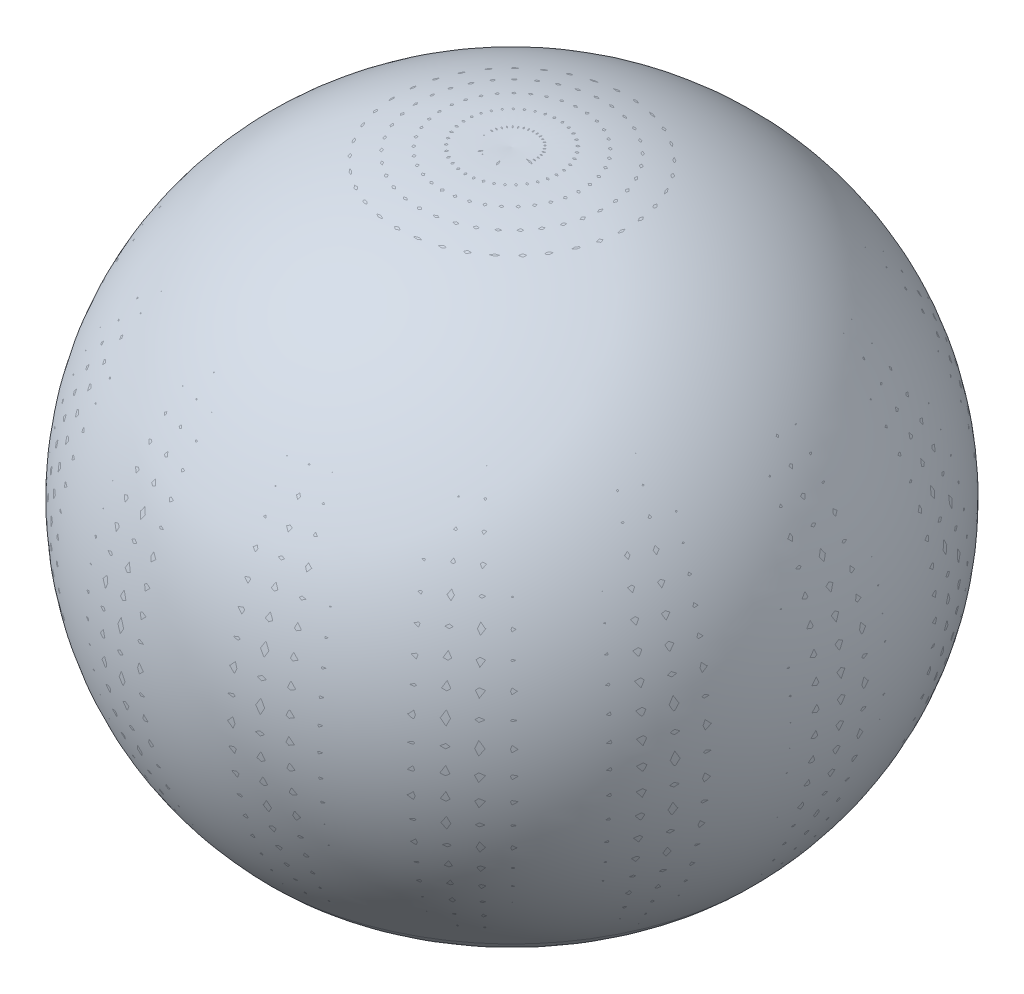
ISO-10303-21;
HEADER;
FILE_DESCRIPTION(('STEP AP214'),'2;1');
FILE_NAME('part.step','',(''),(''),'','','');
FILE_SCHEMA(('AUTOMOTIVE_DESIGN { 1 0 10303 214 1 1 1 1 }'));
ENDSEC;
DATA;
#1=APPLICATION_CONTEXT('core data for automotive mechanical design processes');
#2=APPLICATION_PROTOCOL_DEFINITION('international standard','automotive_design',2000,#1);
#3=PRODUCT_CONTEXT('',#1,'mechanical');
#4=PRODUCT('Part','Part','',(#3));
#5=PRODUCT_RELATED_PRODUCT_CATEGORY('part','',(#4));
#6=PRODUCT_DEFINITION_FORMATION('','',#4);
#7=PRODUCT_DEFINITION_CONTEXT('part definition',#1,'design');
#8=PRODUCT_DEFINITION('design','',#6,#7);
#9=PRODUCT_DEFINITION_SHAPE('','',#8);
#10=(LENGTH_UNIT() NAMED_UNIT(*) SI_UNIT(.MILLI.,.METRE.));
#11=(NAMED_UNIT(*) PLANE_ANGLE_UNIT() SI_UNIT($,.RADIAN.));
#12=(NAMED_UNIT(*) SI_UNIT($,.STERADIAN.) SOLID_ANGLE_UNIT());
#13=UNCERTAINTY_MEASURE_WITH_UNIT(LENGTH_MEASURE(1.E-05),#10,'distance_accuracy_value','');
#14=(GEOMETRIC_REPRESENTATION_CONTEXT(3) GLOBAL_UNCERTAINTY_ASSIGNED_CONTEXT((#13)) GLOBAL_UNIT_ASSIGNED_CONTEXT((#10,
#11,#12)) REPRESENTATION_CONTEXT('',''));
#15=CARTESIAN_POINT('',(0.,0.,0.));
#16=DIRECTION('',(0.,0.,1.));
#17=DIRECTION('',(1.,0.,0.));
#18=AXIS2_PLACEMENT_3D('',#15,#16,#17);
#19=CARTESIAN_POINT('',(0.,565.,150.));
#20=DIRECTION('',(-1.,0.,0.));
#21=DIRECTION('',(0.,0.,-1.));
#22=AXIS2_PLACEMENT_3D('',#19,#20,#21);
#23=CIRCLE('',#22,1900.12426026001);
#24=TRIMMED_CURVE('',#23,(PARAMETER_VALUE(-1.4917718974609)),(PARAMETER_VALUE(1.4917718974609)),
.T.,.PARAMETER.);
#25=CARTESIAN_POINT('',(0.,565.,0.));
#26=DIRECTION('',(0.,-1.,0.));
#27=AXIS1_PLACEMENT('',#25,#26);
#28=SURFACE_OF_REVOLUTION('',#24,#27);
#29=CARTESIAN_POINT('',(0.,565.,0.));
#30=DIRECTION('',(0.,-1.,0.));
#31=DIRECTION('',(0.,0.,-1.));
#32=AXIS2_PLACEMENT_3D('',#29,#30,#31);
#33=CIRCLE('',#32,1750.12426026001);
#34=CARTESIAN_POINT('',(0.,565.,-1750.12426026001));
#35=VERTEX_POINT('',#34);
#36=EDGE_CURVE('E12',#35,#35,#33,.T.);
#37=ORIENTED_EDGE('',*,*,#36,.F.);
#38=EDGE_LOOP('',(#37));
#39=FACE_BOUND('',#38,.T.);
#40=CARTESIAN_POINT('',(0.,2459.19434177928,0.));
#41=VERTEX_POINT('',#40);
#42=VERTEX_LOOP('',#41);
#43=FACE_BOUND('',#42,.T.);
#44=ADVANCED_FACE('F42',(#39,#43),#28,.T.);
#45=CARTESIAN_POINT('',(0.,565.,0.));
#46=DIRECTION('',(0.,-1.,0.));
#47=DIRECTION('',(0.,0.,-1.));
#48=AXIS2_PLACEMENT_3D('',#45,#46,#47);
#49=DEGENERATE_TOROIDAL_SURFACE('',#48,720.000000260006,1030.12426,.T.);
#50=CARTESIAN_POINT('',(0.,-406.044481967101,0.));
#51=DIRECTION('',(0.,-1.,0.));
#52=DIRECTION('',(0.,0.,-1.));
#53=AXIS2_PLACEMENT_3D('',#50,#51,#52);
#54=CIRCLE('',#53,376.156132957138);
#55=CARTESIAN_POINT('',(0.,-406.044481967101,-376.156132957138));
#56=VERTEX_POINT('',#55);
#57=EDGE_CURVE('E49',#56,#56,#54,.T.);
#58=ORIENTED_EDGE('',*,*,#57,.F.);
#59=EDGE_LOOP('',(#58));
#60=FACE_BOUND('',#59,.T.);
#61=ORIENTED_EDGE('',*,*,#36,.T.);
#62=EDGE_LOOP('',(#61));
#63=FACE_BOUND('',#62,.T.);
#64=ADVANCED_FACE('F135',(#60,#63),#49,.T.);
#65=CARTESIAN_POINT('',(0.,-406.044481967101,0.));
#66=DIRECTION('',(0.,1.,0.));
#67=DIRECTION('',(0.,0.,1.));
#68=AXIS2_PLACEMENT_3D('',#65,#66,#67);
#69=CONICAL_SURFACE('',#68,376.156132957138,0.680430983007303);
#70=CARTESIAN_POINT('',(0.,-386.24685,0.));
#71=DIRECTION('',(0.,-1.,0.));
#72=DIRECTION('',(0.,0.,-1.));
#73=AXIS2_PLACEMENT_3D('',#70,#71,#72);
#74=CIRCLE('',#73,392.179830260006);
#75=CARTESIAN_POINT('',(0.,-386.24685,-392.179830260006));
#76=VERTEX_POINT('',#75);
#77=EDGE_CURVE('E128',#76,#76,#74,.T.);
#78=ORIENTED_EDGE('',*,*,#77,.F.);
#79=EDGE_LOOP('',(#78));
#80=FACE_BOUND('',#79,.T.);
#81=ORIENTED_EDGE('',*,*,#57,.T.);
#82=EDGE_LOOP('',(#81));
#83=FACE_BOUND('',#82,.T.);
#84=ADVANCED_FACE('F133',(#80,#83),#69,.F.);
#85=CARTESIAN_POINT('',(0.,-386.24685,0.));
#86=DIRECTION('',(0.,1.,0.));
#87=DIRECTION('',(0.,0.,1.));
#88=AXIS2_PLACEMENT_3D('',#85,#86,#87);
#89=CONICAL_SURFACE('',#88,392.179830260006,0.652766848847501);
#90=CARTESIAN_POINT('',(0.,-365.98906,0.));
#91=DIRECTION('',(0.,-1.,0.));
#92=DIRECTION('',(0.,0.,-1.));
#93=AXIS2_PLACEMENT_3D('',#90,#91,#92);
#94=CIRCLE('',#93,407.668520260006);
#95=CARTESIAN_POINT('',(0.,-365.98906,-407.668520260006));
#96=VERTEX_POINT('',#95);
#97=EDGE_CURVE('E125',#96,#96,#94,.T.);
#98=ORIENTED_EDGE('',*,*,#97,.F.);
#99=EDGE_LOOP('',(#98));
#100=FACE_BOUND('',#99,.T.);
#101=ORIENTED_EDGE('',*,*,#77,.T.);
#102=EDGE_LOOP('',(#101));
#103=FACE_BOUND('',#102,.T.);
#104=ADVANCED_FACE('F153',(#100,#103),#89,.F.);
#105=CARTESIAN_POINT('',(0.,-365.98906,0.));
#106=DIRECTION('',(0.,1.,0.));
#107=DIRECTION('',(0.,0.,1.));
#108=AXIS2_PLACEMENT_3D('',#105,#106,#107);
#109=CONICAL_SURFACE('',#108,407.668520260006,0.624893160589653);
#110=CARTESIAN_POINT('',(0.,-345.288,0.));
#111=DIRECTION('',(0.,-1.,0.));
#112=DIRECTION('',(0.,0.,-1.));
#113=AXIS2_PLACEMENT_3D('',#110,#111,#112);
#114=CIRCLE('',#113,422.600650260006);
#115=CARTESIAN_POINT('',(0.,-345.288,-422.600650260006));
#116=VERTEX_POINT('',#115);
#117=EDGE_CURVE('E122',#116,#116,#114,.T.);
#118=ORIENTED_EDGE('',*,*,#117,.F.);
#119=EDGE_LOOP('',(#118));
#120=FACE_BOUND('',#119,.T.);
#121=ORIENTED_EDGE('',*,*,#97,.T.);
#122=EDGE_LOOP('',(#121));
#123=FACE_BOUND('',#122,.T.);
#124=ADVANCED_FACE('F161',(#120,#123),#109,.F.);
#125=CARTESIAN_POINT('',(0.,-345.288,0.));
#126=DIRECTION('',(0.,1.,0.));
#127=DIRECTION('',(0.,0.,1.));
#128=AXIS2_PLACEMENT_3D('',#125,#126,#127);
#129=CONICAL_SURFACE('',#128,422.600650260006,0.596768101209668);
#130=CARTESIAN_POINT('',(0.,-324.16053,0.));
#131=DIRECTION('',(0.,-1.,0.));
#132=DIRECTION('',(0.,0.,-1.));
#133=AXIS2_PLACEMENT_3D('',#130,#131,#132);
#134=CIRCLE('',#133,436.954710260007);
#135=CARTESIAN_POINT('',(0.,-324.16053,-436.954710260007));
#136=VERTEX_POINT('',#135);
#137=EDGE_CURVE('E119',#136,#136,#134,.T.);
#138=ORIENTED_EDGE('',*,*,#137,.F.);
#139=EDGE_LOOP('',(#138));
#140=FACE_BOUND('',#139,.T.);
#141=ORIENTED_EDGE('',*,*,#117,.T.);
#142=EDGE_LOOP('',(#141));
#143=FACE_BOUND('',#142,.T.);
#144=ADVANCED_FACE('F169',(#140,#143),#129,.F.);
#145=CARTESIAN_POINT('',(0.,-324.16053,0.));
#146=DIRECTION('',(0.,1.,0.));
#147=DIRECTION('',(0.,0.,1.));
#148=AXIS2_PLACEMENT_3D('',#145,#146,#147);
#149=CONICAL_SURFACE('',#148,436.954710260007,0.568350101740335);
#150=CARTESIAN_POINT('',(0.,-302.62353,0.));
#151=DIRECTION('',(0.,-1.,0.));
#152=DIRECTION('',(0.,0.,-1.));
#153=AXIS2_PLACEMENT_3D('',#150,#151,#152);
#154=CIRCLE('',#153,450.709170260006);
#155=CARTESIAN_POINT('',(0.,-302.62353,-450.709170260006));
#156=VERTEX_POINT('',#155);
#157=EDGE_CURVE('E116',#156,#156,#154,.T.);
#158=ORIENTED_EDGE('',*,*,#157,.F.);
#159=EDGE_LOOP('',(#158));
#160=FACE_BOUND('',#159,.T.);
#161=ORIENTED_EDGE('',*,*,#137,.T.);
#162=EDGE_LOOP('',(#161));
#163=FACE_BOUND('',#162,.T.);
#164=ADVANCED_FACE('F177',(#160,#163),#149,.F.);
#165=CARTESIAN_POINT('',(0.,-302.62353,0.));
#166=DIRECTION('',(0.,1.,0.));
#167=DIRECTION('',(0.,0.,1.));
#168=AXIS2_PLACEMENT_3D('',#165,#166,#167);
#169=CONICAL_SURFACE('',#168,450.709170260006,0.539597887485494);
#170=CARTESIAN_POINT('',(0.,-280.69386,0.));
#171=DIRECTION('',(0.,-1.,0.));
#172=DIRECTION('',(0.,0.,-1.));
#173=AXIS2_PLACEMENT_3D('',#170,#171,#172);
#174=CIRCLE('',#173,463.842480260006);
#175=CARTESIAN_POINT('',(0.,-280.69386,-463.842480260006));
#176=VERTEX_POINT('',#175);
#177=EDGE_CURVE('E113',#176,#176,#174,.T.);
#178=ORIENTED_EDGE('',*,*,#177,.F.);
#179=EDGE_LOOP('',(#178));
#180=FACE_BOUND('',#179,.T.);
#181=ORIENTED_EDGE('',*,*,#157,.T.);
#182=EDGE_LOOP('',(#181));
#183=FACE_BOUND('',#182,.T.);
#184=ADVANCED_FACE('F185',(#180,#183),#169,.F.);
#185=CARTESIAN_POINT('',(0.,-280.69386,0.));
#186=DIRECTION('',(0.,1.,0.));
#187=DIRECTION('',(0.,0.,1.));
#188=AXIS2_PLACEMENT_3D('',#185,#186,#187);
#189=CONICAL_SURFACE('',#188,463.842480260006,0.510474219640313);
#190=CARTESIAN_POINT('',(0.,-258.38839,0.));
#191=DIRECTION('',(0.,-1.,0.));
#192=DIRECTION('',(0.,0.,-1.));
#193=AXIS2_PLACEMENT_3D('',#190,#191,#192);
#194=CIRCLE('',#193,476.333130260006);
#195=CARTESIAN_POINT('',(0.,-258.38839,-476.333130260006));
#196=VERTEX_POINT('',#195);
#197=EDGE_CURVE('E110',#196,#196,#194,.T.);
#198=ORIENTED_EDGE('',*,*,#197,.F.);
#199=EDGE_LOOP('',(#198));
#200=FACE_BOUND('',#199,.T.);
#201=ORIENTED_EDGE('',*,*,#177,.T.);
#202=EDGE_LOOP('',(#201));
#203=FACE_BOUND('',#202,.T.);
#204=ADVANCED_FACE('F193',(#200,#203),#189,.F.);
#205=CARTESIAN_POINT('',(0.,-258.38839,0.));
#206=DIRECTION('',(0.,1.,0.));
#207=DIRECTION('',(0.,0.,1.));
#208=AXIS2_PLACEMENT_3D('',#205,#206,#207);
#209=CONICAL_SURFACE('',#208,476.333130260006,0.480941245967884);
#210=CARTESIAN_POINT('',(0.,-235.72401,0.));
#211=DIRECTION('',(0.,-1.,0.));
#212=DIRECTION('',(0.,0.,-1.));
#213=AXIS2_PLACEMENT_3D('',#210,#211,#212);
#214=CIRCLE('',#213,488.159580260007);
#215=CARTESIAN_POINT('',(0.,-235.72401,-488.159580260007));
#216=VERTEX_POINT('',#215);
#217=EDGE_CURVE('E107',#216,#216,#214,.T.);
#218=ORIENTED_EDGE('',*,*,#217,.F.);
#219=EDGE_LOOP('',(#218));
#220=FACE_BOUND('',#219,.T.);
#221=ORIENTED_EDGE('',*,*,#197,.T.);
#222=EDGE_LOOP('',(#221));
#223=FACE_BOUND('',#222,.T.);
#224=ADVANCED_FACE('F201',(#220,#223),#209,.F.);
#225=CARTESIAN_POINT('',(0.,-235.72401,0.));
#226=DIRECTION('',(0.,1.,0.));
#227=DIRECTION('',(0.,0.,1.));
#228=AXIS2_PLACEMENT_3D('',#225,#226,#227);
#229=CONICAL_SURFACE('',#228,488.159580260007,0.450962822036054);
#230=CARTESIAN_POINT('',(0.,-212.71757,0.));
#231=DIRECTION('',(0.,-1.,0.));
#232=DIRECTION('',(0.,0.,-1.));
#233=AXIS2_PLACEMENT_3D('',#230,#231,#232);
#234=CIRCLE('',#233,499.300290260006);
#235=CARTESIAN_POINT('',(0.,-212.71757,-499.300290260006));
#236=VERTEX_POINT('',#235);
#237=EDGE_CURVE('E104',#236,#236,#234,.T.);
#238=ORIENTED_EDGE('',*,*,#237,.F.);
#239=EDGE_LOOP('',(#238));
#240=FACE_BOUND('',#239,.T.);
#241=ORIENTED_EDGE('',*,*,#217,.T.);
#242=EDGE_LOOP('',(#241));
#243=FACE_BOUND('',#242,.T.);
#244=ADVANCED_FACE('F209',(#240,#243),#229,.F.);
#245=CARTESIAN_POINT('',(0.,-212.71757,0.));
#246=DIRECTION('',(0.,1.,0.));
#247=DIRECTION('',(0.,0.,1.));
#248=AXIS2_PLACEMENT_3D('',#245,#246,#247);
#249=CONICAL_SURFACE('',#248,499.300290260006,0.420507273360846);
#250=CARTESIAN_POINT('',(0.,-189.38595,0.));
#251=DIRECTION('',(0.,-1.,0.));
#252=DIRECTION('',(0.,0.,-1.));
#253=AXIS2_PLACEMENT_3D('',#250,#251,#252);
#254=CIRCLE('',#253,509.733750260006);
#255=CARTESIAN_POINT('',(0.,-189.38595,-509.733750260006));
#256=VERTEX_POINT('',#255);
#257=EDGE_CURVE('E101',#256,#256,#254,.T.);
#258=ORIENTED_EDGE('',*,*,#257,.F.);
#259=EDGE_LOOP('',(#258));
#260=FACE_BOUND('',#259,.T.);
#261=ORIENTED_EDGE('',*,*,#237,.T.);
#262=EDGE_LOOP('',(#261));
#263=FACE_BOUND('',#262,.T.);
#264=ADVANCED_FACE('F217',(#260,#263),#249,.F.);
#265=CARTESIAN_POINT('',(0.,-189.38595,0.));
#266=DIRECTION('',(0.,1.,0.));
#267=DIRECTION('',(0.,0.,1.));
#268=AXIS2_PLACEMENT_3D('',#265,#266,#267);
#269=CONICAL_SURFACE('',#268,509.733750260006,0.391088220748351);
#270=CARTESIAN_POINT('',(0.,-167.87548,0.));
#271=DIRECTION('',(0.,-1.,0.));
#272=DIRECTION('',(0.,0.,-1.));
#273=AXIS2_PLACEMENT_3D('',#270,#271,#272);
#274=CIRCLE('',#273,518.603110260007);
#275=CARTESIAN_POINT('',(0.,-167.87548,-518.603110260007));
#276=VERTEX_POINT('',#275);
#277=EDGE_CURVE('E98',#276,#276,#274,.T.);
#278=ORIENTED_EDGE('',*,*,#277,.F.);
#279=EDGE_LOOP('',(#278));
#280=FACE_BOUND('',#279,.T.);
#281=ORIENTED_EDGE('',*,*,#257,.T.);
#282=EDGE_LOOP('',(#281));
#283=FACE_BOUND('',#282,.T.);
#284=ADVANCED_FACE('F225',(#280,#283),#269,.F.);
#285=CARTESIAN_POINT('',(0.,-167.87548,0.));
#286=DIRECTION('',(0.,1.,0.));
#287=DIRECTION('',(0.,0.,1.));
#288=AXIS2_PLACEMENT_3D('',#285,#286,#287);
#289=CONICAL_SURFACE('',#288,518.603110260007,0.363319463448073);
#290=CARTESIAN_POINT('',(0.,-146.12938,0.));
#291=DIRECTION('',(0.,-1.,0.));
#292=DIRECTION('',(0.,0.,-1.));
#293=AXIS2_PLACEMENT_3D('',#290,#291,#292);
#294=CIRCLE('',#293,526.870920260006);
#295=CARTESIAN_POINT('',(0.,-146.12938,-526.870920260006));
#296=VERTEX_POINT('',#295);
#297=EDGE_CURVE('E95',#296,#296,#294,.T.);
#298=ORIENTED_EDGE('',*,*,#297,.F.);
#299=EDGE_LOOP('',(#298));
#300=FACE_BOUND('',#299,.T.);
#301=ORIENTED_EDGE('',*,*,#277,.T.);
#302=EDGE_LOOP('',(#301));
#303=FACE_BOUND('',#302,.T.);
#304=ADVANCED_FACE('F233',(#300,#303),#289,.F.);
#305=CARTESIAN_POINT('',(0.,-146.12938,0.));
#306=DIRECTION('',(0.,1.,0.));
#307=DIRECTION('',(0.,0.,1.));
#308=AXIS2_PLACEMENT_3D('',#305,#306,#307);
#309=CONICAL_SURFACE('',#308,526.870920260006,0.335955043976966);
#310=CARTESIAN_POINT('',(0.,-124.16761,0.));
#311=DIRECTION('',(0.,-1.,0.));
#312=DIRECTION('',(0.,0.,-1.));
#313=AXIS2_PLACEMENT_3D('',#310,#311,#312);
#314=CIRCLE('',#313,534.539800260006);
#315=CARTESIAN_POINT('',(0.,-124.16761,-534.539800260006));
#316=VERTEX_POINT('',#315);
#317=EDGE_CURVE('E92',#316,#316,#314,.T.);
#318=ORIENTED_EDGE('',*,*,#317,.F.);
#319=EDGE_LOOP('',(#318));
#320=FACE_BOUND('',#319,.T.);
#321=ORIENTED_EDGE('',*,*,#297,.T.);
#322=EDGE_LOOP('',(#321));
#323=FACE_BOUND('',#322,.T.);
#324=ADVANCED_FACE('F241',(#320,#323),#309,.F.);
#325=CARTESIAN_POINT('',(0.,-124.16761,0.));
#326=DIRECTION('',(0.,1.,0.));
#327=DIRECTION('',(0.,0.,1.));
#328=AXIS2_PLACEMENT_3D('',#325,#326,#327);
#329=CONICAL_SURFACE('',#328,534.539800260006,0.308973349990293);
#330=CARTESIAN_POINT('',(0.,-102.01015,0.));
#331=DIRECTION('',(0.,-1.,0.));
#332=DIRECTION('',(0.,0.,-1.));
#333=AXIS2_PLACEMENT_3D('',#330,#331,#332);
#334=CIRCLE('',#333,541.612370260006);
#335=CARTESIAN_POINT('',(0.,-102.01015,-541.612370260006));
#336=VERTEX_POINT('',#335);
#337=EDGE_CURVE('E89',#336,#336,#334,.T.);
#338=ORIENTED_EDGE('',*,*,#337,.F.);
#339=EDGE_LOOP('',(#338));
#340=FACE_BOUND('',#339,.T.);
#341=ORIENTED_EDGE('',*,*,#317,.T.);
#342=EDGE_LOOP('',(#341));
#343=FACE_BOUND('',#342,.T.);
#344=ADVANCED_FACE('F249',(#340,#343),#329,.F.);
#345=CARTESIAN_POINT('',(0.,-102.01015,0.));
#346=DIRECTION('',(0.,1.,0.));
#347=DIRECTION('',(0.,0.,1.));
#348=AXIS2_PLACEMENT_3D('',#345,#346,#347);
#349=CONICAL_SURFACE('',#348,541.612370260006,0.282349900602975);
#350=CARTESIAN_POINT('',(0.,-79.6769399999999,0.));
#351=DIRECTION('',(0.,-1.,0.));
#352=DIRECTION('',(0.,0.,-1.));
#353=AXIS2_PLACEMENT_3D('',#350,#351,#352);
#354=CIRCLE('',#353,548.091240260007);
#355=CARTESIAN_POINT('',(0.,-79.6769399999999,-548.091240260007));
#356=VERTEX_POINT('',#355);
#357=EDGE_CURVE('E86',#356,#356,#354,.T.);
#358=ORIENTED_EDGE('',*,*,#357,.F.);
#359=EDGE_LOOP('',(#358));
#360=FACE_BOUND('',#359,.T.);
#361=ORIENTED_EDGE('',*,*,#337,.T.);
#362=EDGE_LOOP('',(#361));
#363=FACE_BOUND('',#362,.T.);
#364=ADVANCED_FACE('F257',(#360,#363),#349,.F.);
#365=CARTESIAN_POINT('',(0.,-79.6769399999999,0.));
#366=DIRECTION('',(0.,1.,0.));
#367=DIRECTION('',(0.,0.,1.));
#368=AXIS2_PLACEMENT_3D('',#365,#366,#367);
#369=CONICAL_SURFACE('',#368,548.091240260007,0.256060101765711);
#370=CARTESIAN_POINT('',(0.,-57.1879500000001,0.));
#371=DIRECTION('',(0.,-1.,0.));
#372=DIRECTION('',(0.,0.,-1.));
#373=AXIS2_PLACEMENT_3D('',#370,#371,#372);
#374=CIRCLE('',#373,553.979020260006);
#375=CARTESIAN_POINT('',(0.,-57.1879500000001,-553.979020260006));
#376=VERTEX_POINT('',#375);
#377=EDGE_CURVE('E83',#376,#376,#374,.T.);
#378=ORIENTED_EDGE('',*,*,#377,.F.);
#379=EDGE_LOOP('',(#378));
#380=FACE_BOUND('',#379,.T.);
#381=ORIENTED_EDGE('',*,*,#357,.T.);
#382=EDGE_LOOP('',(#381));
#383=FACE_BOUND('',#382,.T.);
#384=ADVANCED_FACE('F265',(#380,#383),#369,.F.);
#385=CARTESIAN_POINT('',(0.,-57.1879500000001,0.));
#386=DIRECTION('',(0.,1.,0.));
#387=DIRECTION('',(0.,0.,1.));
#388=AXIS2_PLACEMENT_3D('',#385,#386,#387);
#389=CONICAL_SURFACE('',#388,553.979020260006,0.230077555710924);
#390=CARTESIAN_POINT('',(0.,-34.5631399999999,0.));
#391=DIRECTION('',(0.,-1.,0.));
#392=DIRECTION('',(0.,0.,-1.));
#393=AXIS2_PLACEMENT_3D('',#390,#391,#392);
#394=CIRCLE('',#393,559.278320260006);
#395=CARTESIAN_POINT('',(0.,-34.5631399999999,-559.278320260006));
#396=VERTEX_POINT('',#395);
#397=EDGE_CURVE('E80',#396,#396,#394,.T.);
#398=ORIENTED_EDGE('',*,*,#397,.F.);
#399=EDGE_LOOP('',(#398));
#400=FACE_BOUND('',#399,.T.);
#401=ORIENTED_EDGE('',*,*,#377,.T.);
#402=EDGE_LOOP('',(#401));
#403=FACE_BOUND('',#402,.T.);
#404=ADVANCED_FACE('F273',(#400,#403),#389,.F.);
#405=CARTESIAN_POINT('',(0.,-34.5631399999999,0.));
#406=DIRECTION('',(0.,1.,0.));
#407=DIRECTION('',(0.,0.,1.));
#408=AXIS2_PLACEMENT_3D('',#405,#406,#407);
#409=CONICAL_SURFACE('',#408,559.278320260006,0.204375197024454);
#410=CARTESIAN_POINT('',(0.,-11.8224600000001,0.));
#411=DIRECTION('',(0.,-1.,0.));
#412=DIRECTION('',(0.,0.,-1.));
#413=AXIS2_PLACEMENT_3D('',#410,#411,#412);
#414=CIRCLE('',#413,563.991760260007);
#415=CARTESIAN_POINT('',(0.,-11.8224600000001,-563.991760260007));
#416=VERTEX_POINT('',#415);
#417=EDGE_CURVE('E77',#416,#416,#414,.T.);
#418=ORIENTED_EDGE('',*,*,#417,.F.);
#419=EDGE_LOOP('',(#418));
#420=FACE_BOUND('',#419,.T.);
#421=ORIENTED_EDGE('',*,*,#397,.T.);
#422=EDGE_LOOP('',(#421));
#423=FACE_BOUND('',#422,.T.);
#424=ADVANCED_FACE('F281',(#420,#423),#409,.F.);
#425=CARTESIAN_POINT('',(0.,-11.8224600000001,0.));
#426=DIRECTION('',(0.,1.,0.));
#427=DIRECTION('',(0.,0.,1.));
#428=AXIS2_PLACEMENT_3D('',#425,#426,#427);
#429=CONICAL_SURFACE('',#428,563.991760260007,0.178924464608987);
#430=CARTESIAN_POINT('',(0.,11.0141100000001,0.));
#431=DIRECTION('',(0.,-1.,0.));
#432=DIRECTION('',(0.,0.,-1.));
#433=AXIS2_PLACEMENT_3D('',#430,#431,#432);
#434=CIRCLE('',#433,568.121950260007);
#435=CARTESIAN_POINT('',(0.,11.0141100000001,-568.121950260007));
#436=VERTEX_POINT('',#435);
#437=EDGE_CURVE('E68',#436,#436,#434,.T.);
#438=ORIENTED_EDGE('',*,*,#437,.F.);
#439=EDGE_LOOP('',(#438));
#440=FACE_BOUND('',#439,.T.);
#441=ORIENTED_EDGE('',*,*,#417,.T.);
#442=EDGE_LOOP('',(#441));
#443=FACE_BOUND('',#442,.T.);
#444=ADVANCED_FACE('F289',(#440,#443),#429,.F.);
#445=CARTESIAN_POINT('',(0.,11.0141100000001,0.));
#446=DIRECTION('',(0.,1.,0.));
#447=DIRECTION('',(0.,0.,1.));
#448=AXIS2_PLACEMENT_3D('',#445,#446,#447);
#449=CONICAL_SURFACE('',#448,568.121950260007,0.153696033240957);
#450=CARTESIAN_POINT('',(0.,33.9266307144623,0.));
#451=DIRECTION('',(0.,-1.,0.));
#452=DIRECTION('',(0.,0.,-1.));
#453=AXIS2_PLACEMENT_3D('',#450,#451,#452);
#454=CIRCLE('',#453,571.671507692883);
#455=CARTESIAN_POINT('',(0.,33.9266307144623,-571.671507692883));
#456=VERTEX_POINT('',#455);
#457=EDGE_CURVE('E64',#456,#456,#454,.T.);
#458=ORIENTED_EDGE('',*,*,#457,.F.);
#459=EDGE_LOOP('',(#458));
#460=FACE_BOUND('',#459,.T.);
#461=ORIENTED_EDGE('',*,*,#437,.T.);
#462=EDGE_LOOP('',(#461));
#463=FACE_BOUND('',#462,.T.);
#464=ADVANCED_FACE('F297',(#460,#463),#449,.F.);
#465=CARTESIAN_POINT('',(0.,565.,0.));
#466=DIRECTION('',(0.,-1.,0.));
#467=DIRECTION('',(0.,0.,-1.));
#468=AXIS2_PLACEMENT_3D('',#465,#466,#467);
#469=DEGENERATE_TOROIDAL_SURFACE('',#468,150.,896.018241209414,.F.);
#470=CARTESIAN_POINT('',(0.,1413.96360776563,0.));
#471=DIRECTION('',(0.,-1.,0.));
#472=DIRECTION('',(0.,0.,-1.));
#473=AXIS2_PLACEMENT_3D('',#470,#471,#472);
#474=CIRCLE('',#473,136.547520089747);
#475=CARTESIAN_POINT('',(0.,1413.96360776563,-136.547520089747));
#476=VERTEX_POINT('',#475);
#477=EDGE_CURVE('E62',#476,#476,#474,.T.);
#478=ORIENTED_EDGE('',*,*,#477,.F.);
#479=EDGE_LOOP('',(#478));
#480=FACE_BOUND('',#479,.T.);
#481=ORIENTED_EDGE('',*,*,#457,.T.);
#482=EDGE_LOOP('',(#481));
#483=FACE_BOUND('',#482,.T.);
#484=ADVANCED_FACE('F58',(#480,#483),#469,.T.);
#485=CARTESIAN_POINT('',(0.,565.,-720.000000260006));
#486=DIRECTION('',(-1.,0.,0.));
#487=DIRECTION('',(0.,0.,-1.));
#488=AXIS2_PLACEMENT_3D('',#485,#486,#487);
#489=CIRCLE('',#488,1030.12426625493);
#490=TRIMMED_CURVE('',#489,(PARAMETER_VALUE(-2.34471731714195)),
(PARAMETER_VALUE(2.34471731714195)),.T.,.PARAMETER.);
#491=CARTESIAN_POINT('',(0.,565.,0.));
#492=DIRECTION('',(0.,-1.,0.));
#493=AXIS1_PLACEMENT('',#491,#492);
#494=SURFACE_OF_REVOLUTION('',#490,#493);
#495=CARTESIAN_POINT('',(0.,1301.71975917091,0.));
#496=VERTEX_POINT('',#495);
#497=VERTEX_LOOP('',#496);
#498=FACE_BOUND('',#497,.T.);
#499=ORIENTED_EDGE('',*,*,#477,.T.);
#500=EDGE_LOOP('',(#499));
#501=FACE_BOUND('',#500,.T.);
#502=ADVANCED_FACE('F55',(#498,#501),#494,.F.);
#503=CLOSED_SHELL('',(#44,#64,#84,#104,#124,#144,#164,#184,#204,#224,#244,#264,#284,#304,#324,
#344,#364,#384,#404,#424,#444,#464,#484,#502));
#504=CARTESIAN_POINT('',(0.,565.,0.));
#505=DIRECTION('',(0.,-1.,0.));
#506=DIRECTION('',(0.,0.,-1.));
#507=AXIS2_PLACEMENT_3D('',#504,#505,#506);
#508=DEGENERATE_TOROIDAL_SURFACE('',#507,150.,1899.12426026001,.F.);
#509=CARTESIAN_POINT('',(0.,565.,0.));
#510=DIRECTION('',(0.,-1.,0.));
#511=DIRECTION('',(0.,0.,-1.));
#512=AXIS2_PLACEMENT_3D('',#509,#510,#511);
#513=CIRCLE('',#512,1749.12426026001);
#514=CARTESIAN_POINT('',(0.,565.,-1749.12426026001));
#515=VERTEX_POINT('',#514);
#516=EDGE_CURVE('E65',#515,#515,#513,.T.);
#517=ORIENTED_EDGE('',*,*,#516,.T.);
#518=EDGE_LOOP('',(#517));
#519=FACE_BOUND('',#518,.T.);
#520=CARTESIAN_POINT('',(0.,2458.1117124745,0.));
#521=DIRECTION('',(0.,-1.,0.));
#522=DIRECTION('',(0.,0.,-1.));
#523=AXIS2_PLACEMENT_3D('',#520,#521,#522);
#524=CIRCLE('',#523,1.);
#525=CARTESIAN_POINT('',(0.,2458.1117124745,-1.));
#526=VERTEX_POINT('',#525);
#527=EDGE_CURVE('E621',#526,#526,#524,.T.);
#528=ORIENTED_EDGE('',*,*,#527,.F.);
#529=EDGE_LOOP('',(#528));
#530=FACE_BOUND('',#529,.T.);
#531=ADVANCED_FACE('F320',(#519,#530),#508,.T.);
#532=CARTESIAN_POINT('',(0.,565.,0.));
#533=DIRECTION('',(0.,-1.,0.));
#534=DIRECTION('',(0.,0.,-1.));
#535=AXIS2_PLACEMENT_3D('',#532,#533,#534);
#536=DEGENERATE_TOROIDAL_SURFACE('',#535,720.000000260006,1029.12426,.T.);
#537=CARTESIAN_POINT('',(0.,-405.573217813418,0.));
#538=DIRECTION('',(0.,-1.,0.));
#539=DIRECTION('',(0.,0.,-1.));
#540=AXIS2_PLACEMENT_3D('',#537,#538,#539);
#541=CIRCLE('',#540,377.824063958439);
#542=CARTESIAN_POINT('',(0.,-405.573217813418,-377.824063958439));
#543=VERTEX_POINT('',#542);
#544=EDGE_CURVE('E71',#543,#543,#541,.T.);
#545=ORIENTED_EDGE('',*,*,#544,.T.);
#546=EDGE_LOOP('',(#545));
#547=FACE_BOUND('',#546,.T.);
#548=ORIENTED_EDGE('',*,*,#516,.F.);
#549=EDGE_LOOP('',(#548));
#550=FACE_BOUND('',#549,.T.);
#551=ADVANCED_FACE('F323',(#547,#550),#536,.F.);
#552=CARTESIAN_POINT('',(0.,-405.573217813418,0.));
#553=DIRECTION('',(0.,1.,0.));
#554=DIRECTION('',(0.,0.,1.));
#555=AXIS2_PLACEMENT_3D('',#552,#553,#554);
#556=CONICAL_SURFACE('',#555,377.824063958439,0.680430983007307);
#557=CARTESIAN_POINT('',(0.,-386.865225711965,0.));
#558=DIRECTION('',(0.,-1.,0.));
#559=DIRECTION('',(0.,0.,-1.));
#560=AXIS2_PLACEMENT_3D('',#557,#558,#559);
#561=CIRCLE('',#560,392.965834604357);
#562=CARTESIAN_POINT('',(0.,-386.865225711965,-392.965834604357));
#563=VERTEX_POINT('',#562);
#564=EDGE_CURVE('E688',#563,#563,#561,.T.);
#565=ORIENTED_EDGE('',*,*,#564,.T.);
#566=EDGE_LOOP('',(#565));
#567=FACE_BOUND('',#566,.T.);
#568=ORIENTED_EDGE('',*,*,#544,.F.);
#569=EDGE_LOOP('',(#568));
#570=FACE_BOUND('',#569,.T.);
#571=ADVANCED_FACE('F332',(#567,#570),#556,.T.);
#572=CARTESIAN_POINT('',(0.,-386.865225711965,0.));
#573=DIRECTION('',(0.,1.,0.));
#574=DIRECTION('',(0.,0.,1.));
#575=AXIS2_PLACEMENT_3D('',#572,#573,#574);
#576=CONICAL_SURFACE('',#575,392.965834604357,0.6527668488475);
#577=CARTESIAN_POINT('',(0.,-366.5853744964,0.));
#578=DIRECTION('',(0.,-1.,0.));
#579=DIRECTION('',(0.,0.,-1.));
#580=AXIS2_PLACEMENT_3D('',#577,#578,#579);
#581=CIRCLE('',#580,408.471392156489);
#582=CARTESIAN_POINT('',(0.,-366.5853744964,-408.471392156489));
#583=VERTEX_POINT('',#582);
#584=EDGE_CURVE('E685',#583,#583,#581,.T.);
#585=ORIENTED_EDGE('',*,*,#584,.T.);
#586=EDGE_LOOP('',(#585));
#587=FACE_BOUND('',#586,.T.);
#588=ORIENTED_EDGE('',*,*,#564,.F.);
#589=EDGE_LOOP('',(#588));
#590=FACE_BOUND('',#589,.T.);
#591=ADVANCED_FACE('F340',(#587,#590),#576,.T.);
#592=CARTESIAN_POINT('',(0.,-366.5853744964,0.));
#593=DIRECTION('',(0.,1.,0.));
#594=DIRECTION('',(0.,0.,1.));
#595=AXIS2_PLACEMENT_3D('',#592,#593,#594);
#596=CONICAL_SURFACE('',#595,408.471392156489,0.62489316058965);
#597=CARTESIAN_POINT('',(0.,-345.861604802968,0.));
#598=DIRECTION('',(0.,-1.,0.));
#599=DIRECTION('',(0.,0.,-1.));
#600=AXIS2_PLACEMENT_3D('',#597,#598,#599);
#601=CIRCLE('',#600,423.419903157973);
#602=CARTESIAN_POINT('',(0.,-345.861604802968,-423.419903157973));
#603=VERTEX_POINT('',#602);
#604=EDGE_CURVE('E682',#603,#603,#601,.T.);
#605=ORIENTED_EDGE('',*,*,#604,.T.);
#606=EDGE_LOOP('',(#605));
#607=FACE_BOUND('',#606,.T.);
#608=ORIENTED_EDGE('',*,*,#584,.F.);
#609=EDGE_LOOP('',(#608));
#610=FACE_BOUND('',#609,.T.);
#611=ADVANCED_FACE('F348',(#607,#610),#596,.T.);
#612=CARTESIAN_POINT('',(0.,-345.861604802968,0.));
#613=DIRECTION('',(0.,1.,0.));
#614=DIRECTION('',(0.,0.,1.));
#615=AXIS2_PLACEMENT_3D('',#612,#613,#614);
#616=CONICAL_SURFACE('',#615,423.419903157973,0.596768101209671);
#617=CARTESIAN_POINT('',(0.,-324.710748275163,0.));
#618=DIRECTION('',(0.,-1.,0.));
#619=DIRECTION('',(0.,0.,-1.));
#620=AXIS2_PLACEMENT_3D('',#617,#618,#619);
#621=CIRCLE('',#620,437.789852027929);
#622=CARTESIAN_POINT('',(0.,-324.710748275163,-437.789852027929));
#623=VERTEX_POINT('',#622);
#624=EDGE_CURVE('E679',#623,#623,#621,.T.);
#625=ORIENTED_EDGE('',*,*,#624,.T.);
#626=EDGE_LOOP('',(#625));
#627=FACE_BOUND('',#626,.T.);
#628=ORIENTED_EDGE('',*,*,#604,.F.);
#629=EDGE_LOOP('',(#628));
#630=FACE_BOUND('',#629,.T.);
#631=ADVANCED_FACE('F356',(#627,#630),#616,.T.);
#632=CARTESIAN_POINT('',(0.,-324.710748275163,0.));
#633=DIRECTION('',(0.,1.,0.));
#634=DIRECTION('',(0.,0.,1.));
#635=AXIS2_PLACEMENT_3D('',#632,#633,#634);
#636=CONICAL_SURFACE('',#635,437.789852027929,0.568350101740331);
#637=CARTESIAN_POINT('',(0.,-303.149655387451,0.));
#638=DIRECTION('',(0.,-1.,0.));
#639=DIRECTION('',(0.,0.,-1.));
#640=AXIS2_PLACEMENT_3D('',#637,#638,#639);
#641=CIRCLE('',#640,451.559698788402);
#642=CARTESIAN_POINT('',(0.,-303.149655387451,-451.559698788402));
#643=VERTEX_POINT('',#642);
#644=EDGE_CURVE('E676',#643,#643,#641,.T.);
#645=ORIENTED_EDGE('',*,*,#644,.T.);
#646=EDGE_LOOP('',(#645));
#647=FACE_BOUND('',#646,.T.);
#648=ORIENTED_EDGE('',*,*,#624,.F.);
#649=EDGE_LOOP('',(#648));
#650=FACE_BOUND('',#649,.T.);
#651=ADVANCED_FACE('F364',(#647,#650),#636,.T.);
#652=CARTESIAN_POINT('',(0.,-303.149655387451,0.));
#653=DIRECTION('',(0.,1.,0.));
#654=DIRECTION('',(0.,0.,1.));
#655=AXIS2_PLACEMENT_3D('',#652,#653,#654);
#656=CONICAL_SURFACE('',#655,451.559698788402,0.539597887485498);
#657=CARTESIAN_POINT('',(0.,-281.19515735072,0.));
#658=DIRECTION('',(0.,-1.,0.));
#659=DIRECTION('',(0.,0.,-1.));
#660=AXIS2_PLACEMENT_3D('',#657,#658,#659);
#661=CIRCLE('',#660,464.70787788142);
#662=CARTESIAN_POINT('',(0.,-281.19515735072,-464.70787788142));
#663=VERTEX_POINT('',#662);
#664=EDGE_CURVE('E673',#663,#663,#661,.T.);
#665=ORIENTED_EDGE('',*,*,#664,.T.);
#666=EDGE_LOOP('',(#665));
#667=FACE_BOUND('',#666,.T.);
#668=ORIENTED_EDGE('',*,*,#644,.F.);
#669=EDGE_LOOP('',(#668));
#670=FACE_BOUND('',#669,.T.);
#671=ADVANCED_FACE('F372',(#667,#670),#656,.T.);
#672=CARTESIAN_POINT('',(0.,-281.19515735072,0.));
#673=DIRECTION('',(0.,1.,0.));
#674=DIRECTION('',(0.,0.,1.));
#675=AXIS2_PLACEMENT_3D('',#672,#673,#674);
#676=CONICAL_SURFACE('',#675,464.70787788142,0.51047421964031);
#677=CARTESIAN_POINT('',(0.,-258.864096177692,0.));
#678=DIRECTION('',(0.,-1.,0.));
#679=DIRECTION('',(0.,0.,-1.));
#680=AXIS2_PLACEMENT_3D('',#677,#678,#679);
#681=CIRCLE('',#680,477.212858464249);
#682=CARTESIAN_POINT('',(0.,-258.864096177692,-477.212858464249));
#683=VERTEX_POINT('',#682);
#684=EDGE_CURVE('E670',#683,#683,#681,.T.);
#685=ORIENTED_EDGE('',*,*,#684,.T.);
#686=EDGE_LOOP('',(#685));
#687=FACE_BOUND('',#686,.T.);
#688=ORIENTED_EDGE('',*,*,#664,.F.);
#689=EDGE_LOOP('',(#688));
#690=FACE_BOUND('',#689,.T.);
#691=ADVANCED_FACE('F380',(#687,#690),#676,.T.);
#692=CARTESIAN_POINT('',(0.,-258.864096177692,0.));
#693=DIRECTION('',(0.,1.,0.));
#694=DIRECTION('',(0.,0.,1.));
#695=AXIS2_PLACEMENT_3D('',#692,#693,#694);
#696=CONICAL_SURFACE('',#695,477.212858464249,0.480941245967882);
#697=CARTESIAN_POINT('',(0.,-236.173334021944,0.));
#698=DIRECTION('',(0.,-1.,0.));
#699=DIRECTION('',(0.,0.,-1.));
#700=AXIS2_PLACEMENT_3D('',#697,#698,#699);
#701=CIRCLE('',#700,489.053074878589);
#702=CARTESIAN_POINT('',(0.,-236.173334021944,-489.053074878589));
#703=VERTEX_POINT('',#702);
#704=EDGE_CURVE('E667',#703,#703,#701,.T.);
#705=ORIENTED_EDGE('',*,*,#704,.T.);
#706=EDGE_LOOP('',(#705));
#707=FACE_BOUND('',#706,.T.);
#708=ORIENTED_EDGE('',*,*,#684,.F.);
#709=EDGE_LOOP('',(#708));
#710=FACE_BOUND('',#709,.T.);
#711=ADVANCED_FACE('F388',(#707,#710),#696,.T.);
#712=CARTESIAN_POINT('',(0.,-236.173334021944,0.));
#713=DIRECTION('',(0.,1.,0.));
#714=DIRECTION('',(0.,0.,1.));
#715=AXIS2_PLACEMENT_3D('',#712,#713,#714);
#716=CONICAL_SURFACE('',#715,489.053074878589,0.450962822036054);
#717=CARTESIAN_POINT('',(0.,-213.139695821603,0.));
#718=DIRECTION('',(0.,-1.,0.));
#719=DIRECTION('',(0.,0.,-1.));
#720=AXIS2_PLACEMENT_3D('',#717,#718,#719);
#721=CIRCLE('',#720,500.206955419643);
#722=CARTESIAN_POINT('',(0.,-213.139695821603,-500.206955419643));
#723=VERTEX_POINT('',#722);
#724=EDGE_CURVE('E664',#723,#723,#721,.T.);
#725=ORIENTED_EDGE('',*,*,#724,.T.);
#726=EDGE_LOOP('',(#725));
#727=FACE_BOUND('',#726,.T.);
#728=ORIENTED_EDGE('',*,*,#704,.F.);
#729=EDGE_LOOP('',(#728));
#730=FACE_BOUND('',#729,.T.);
#731=ADVANCED_FACE('F396',(#727,#730),#716,.T.);
#732=CARTESIAN_POINT('',(0.,-213.139695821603,0.));
#733=DIRECTION('',(0.,1.,0.));
#734=DIRECTION('',(0.,0.,1.));
#735=AXIS2_PLACEMENT_3D('',#732,#733,#734);
#736=CONICAL_SURFACE('',#735,500.206955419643,0.420507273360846);
#737=CARTESIAN_POINT('',(0.,-189.780744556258,0.));
#738=DIRECTION('',(0.,-1.,0.));
#739=DIRECTION('',(0.,0.,-1.));
#740=AXIS2_PLACEMENT_3D('',#737,#738,#739);
#741=CIRCLE('',#740,510.652637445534);
#742=CARTESIAN_POINT('',(0.,-189.780744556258,-510.652637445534));
#743=VERTEX_POINT('',#742);
#744=EDGE_CURVE('E661',#743,#743,#741,.T.);
#745=ORIENTED_EDGE('',*,*,#744,.T.);
#746=EDGE_LOOP('',(#745));
#747=FACE_BOUND('',#746,.T.);
#748=ORIENTED_EDGE('',*,*,#724,.F.);
#749=EDGE_LOOP('',(#748));
#750=FACE_BOUND('',#749,.T.);
#751=ADVANCED_FACE('F404',(#747,#750),#736,.T.);
#752=CARTESIAN_POINT('',(0.,-189.780744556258,0.));
#753=DIRECTION('',(0.,1.,0.));
#754=DIRECTION('',(0.,0.,1.));
#755=AXIS2_PLACEMENT_3D('',#752,#753,#754);
#756=CONICAL_SURFACE('',#755,510.652637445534,0.39108822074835);
#757=CARTESIAN_POINT('',(0.,-168.243837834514,0.));
#758=DIRECTION('',(0.,-1.,0.));
#759=DIRECTION('',(0.,0.,-1.));
#760=AXIS2_PLACEMENT_3D('',#757,#758,#759);
#761=CIRCLE('',#760,519.532898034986);
#762=CARTESIAN_POINT('',(0.,-168.243837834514,-519.532898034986));
#763=VERTEX_POINT('',#762);
#764=EDGE_CURVE('E658',#763,#763,#761,.T.);
#765=ORIENTED_EDGE('',*,*,#764,.T.);
#766=EDGE_LOOP('',(#765));
#767=FACE_BOUND('',#766,.T.);
#768=ORIENTED_EDGE('',*,*,#744,.F.);
#769=EDGE_LOOP('',(#768));
#770=FACE_BOUND('',#769,.T.);
#771=ADVANCED_FACE('F412',(#767,#770),#756,.T.);
#772=CARTESIAN_POINT('',(0.,-168.243837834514,0.));
#773=DIRECTION('',(0.,1.,0.));
#774=DIRECTION('',(0.,0.,1.));
#775=AXIS2_PLACEMENT_3D('',#772,#773,#774);
#776=CONICAL_SURFACE('',#775,519.532898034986,0.363319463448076);
#777=CARTESIAN_POINT('',(0.,-146.471969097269,0.));
#778=DIRECTION('',(0.,-1.,0.));
#779=DIRECTION('',(0.,0.,-1.));
#780=AXIS2_PLACEMENT_3D('',#777,#778,#779);
#781=CIRCLE('',#780,527.810505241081);
#782=CARTESIAN_POINT('',(0.,-146.471969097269,-527.810505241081));
#783=VERTEX_POINT('',#782);
#784=EDGE_CURVE('E655',#783,#783,#781,.T.);
#785=ORIENTED_EDGE('',*,*,#784,.T.);
#786=EDGE_LOOP('',(#785));
#787=FACE_BOUND('',#786,.T.);
#788=ORIENTED_EDGE('',*,*,#764,.F.);
#789=EDGE_LOOP('',(#788));
#790=FACE_BOUND('',#789,.T.);
#791=ADVANCED_FACE('F420',(#787,#790),#776,.T.);
#792=CARTESIAN_POINT('',(0.,-146.471969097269,0.));
#793=DIRECTION('',(0.,1.,0.));
#794=DIRECTION('',(0.,0.,1.));
#795=AXIS2_PLACEMENT_3D('',#792,#793,#794);
#796=CONICAL_SURFACE('',#795,527.810505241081,0.335955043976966);
#797=CARTESIAN_POINT('',(0.,-124.484543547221,0.));
#798=DIRECTION('',(0.,-1.,0.));
#799=DIRECTION('',(0.,0.,-1.));
#800=AXIS2_PLACEMENT_3D('',#797,#798,#799);
#801=CIRCLE('',#800,535.488343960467);
#802=CARTESIAN_POINT('',(0.,-124.484543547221,-535.488343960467));
#803=VERTEX_POINT('',#802);
#804=EDGE_CURVE('E652',#803,#803,#801,.T.);
#805=ORIENTED_EDGE('',*,*,#804,.T.);
#806=EDGE_LOOP('',(#805));
#807=FACE_BOUND('',#806,.T.);
#808=ORIENTED_EDGE('',*,*,#784,.F.);
#809=EDGE_LOOP('',(#808));
#810=FACE_BOUND('',#809,.T.);
#811=ADVANCED_FACE('F428',(#807,#810),#796,.T.);
#812=CARTESIAN_POINT('',(0.,-124.484543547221,0.));
#813=DIRECTION('',(0.,1.,0.));
#814=DIRECTION('',(0.,0.,1.));
#815=AXIS2_PLACEMENT_3D('',#812,#813,#814);
#816=CONICAL_SURFACE('',#815,535.488343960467,0.30897334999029);
#817=CARTESIAN_POINT('',(0.,-102.301548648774,0.));
#818=DIRECTION('',(0.,-1.,0.));
#819=DIRECTION('',(0.,0.,-1.));
#820=AXIS2_PLACEMENT_3D('',#817,#818,#819);
#821=CIRCLE('',#820,542.569064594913);
#822=CARTESIAN_POINT('',(0.,-102.301548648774,-542.569064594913));
#823=VERTEX_POINT('',#822);
#824=EDGE_CURVE('E649',#823,#823,#821,.T.);
#825=ORIENTED_EDGE('',*,*,#824,.T.);
#826=EDGE_LOOP('',(#825));
#827=FACE_BOUND('',#826,.T.);
#828=ORIENTED_EDGE('',*,*,#804,.F.);
#829=EDGE_LOOP('',(#828));
#830=FACE_BOUND('',#829,.T.);
#831=ADVANCED_FACE('F436',(#827,#830),#816,.T.);
#832=CARTESIAN_POINT('',(0.,-102.301548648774,0.));
#833=DIRECTION('',(0.,1.,0.));
#834=DIRECTION('',(0.,0.,1.));
#835=AXIS2_PLACEMENT_3D('',#832,#833,#834);
#836=CONICAL_SURFACE('',#835,542.569064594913,0.282349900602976);
#837=CARTESIAN_POINT('',(0.,-79.9429281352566,0.));
#838=DIRECTION('',(0.,-1.,0.));
#839=DIRECTION('',(0.,0.,-1.));
#840=AXIS2_PLACEMENT_3D('',#837,#838,#839);
#841=CIRCLE('',#840,549.05530619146);
#842=CARTESIAN_POINT('',(0.,-79.9429281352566,-549.05530619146));
#843=VERTEX_POINT('',#842);
#844=EDGE_CURVE('E646',#843,#843,#841,.T.);
#845=ORIENTED_EDGE('',*,*,#844,.T.);
#846=EDGE_LOOP('',(#845));
#847=FACE_BOUND('',#846,.T.);
#848=ORIENTED_EDGE('',*,*,#824,.F.);
#849=EDGE_LOOP('',(#848));
#850=FACE_BOUND('',#849,.T.);
#851=ADVANCED_FACE('F444',(#847,#850),#836,.T.);
#852=CARTESIAN_POINT('',(0.,-79.9429281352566,0.));
#853=DIRECTION('',(0.,1.,0.));
#854=DIRECTION('',(0.,0.,1.));
#855=AXIS2_PLACEMENT_3D('',#852,#853,#854);
#856=CONICAL_SURFACE('',#855,549.05530619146,0.256060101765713);
#857=CARTESIAN_POINT('',(0.,-57.428652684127,0.));
#858=DIRECTION('',(0.,-1.,0.));
#859=DIRECTION('',(0.,0.,-1.));
#860=AXIS2_PLACEMENT_3D('',#857,#858,#859);
#861=CIRCLE('',#860,554.949706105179);
#862=CARTESIAN_POINT('',(0.,-57.428652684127,-554.949706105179));
#863=VERTEX_POINT('',#862);
#864=EDGE_CURVE('E643',#863,#863,#861,.T.);
#865=ORIENTED_EDGE('',*,*,#864,.T.);
#866=EDGE_LOOP('',(#865));
#867=FACE_BOUND('',#866,.T.);
#868=ORIENTED_EDGE('',*,*,#844,.F.);
#869=EDGE_LOOP('',(#868));
#870=FACE_BOUND('',#869,.T.);
#871=ADVANCED_FACE('F452',(#867,#870),#856,.T.);
#872=CARTESIAN_POINT('',(0.,-57.428652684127,0.));
#873=DIRECTION('',(0.,1.,0.));
#874=DIRECTION('',(0.,0.,1.));
#875=AXIS2_PLACEMENT_3D('',#872,#873,#874);
#876=CONICAL_SURFACE('',#875,554.949706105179,0.230077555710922);
#877=CARTESIAN_POINT('',(0.,-34.7786798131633,0.));
#878=DIRECTION('',(0.,-1.,0.));
#879=DIRECTION('',(0.,0.,-1.));
#880=AXIS2_PLACEMENT_3D('',#877,#878,#879);
#881=CIRCLE('',#880,560.254899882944);
#882=CARTESIAN_POINT('',(0.,-34.7786798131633,-560.254899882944));
#883=VERTEX_POINT('',#882);
#884=EDGE_CURVE('E640',#883,#883,#881,.T.);
#885=ORIENTED_EDGE('',*,*,#884,.T.);
#886=EDGE_LOOP('',(#885));
#887=FACE_BOUND('',#886,.T.);
#888=ORIENTED_EDGE('',*,*,#864,.F.);
#889=EDGE_LOOP('',(#888));
#890=FACE_BOUND('',#889,.T.);
#891=ADVANCED_FACE('F460',(#887,#890),#876,.T.);
#892=CARTESIAN_POINT('',(0.,-34.7786798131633,0.));
#893=DIRECTION('',(0.,1.,0.));
#894=DIRECTION('',(0.,0.,1.));
#895=AXIS2_PLACEMENT_3D('',#892,#893,#894);
#896=CONICAL_SURFACE('',#895,560.254899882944,0.204375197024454);
#897=CARTESIAN_POINT('',(0.,-12.012954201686,0.));
#898=DIRECTION('',(0.,-1.,0.));
#899=DIRECTION('',(0.,0.,-1.));
#900=AXIS2_PLACEMENT_3D('',#897,#898,#899);
#901=CIRCLE('',#900,564.97353106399);
#902=CARTESIAN_POINT('',(0.,-12.012954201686,-564.97353106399));
#903=VERTEX_POINT('',#902);
#904=EDGE_CURVE('E637',#903,#903,#901,.T.);
#905=ORIENTED_EDGE('',*,*,#904,.T.);
#906=EDGE_LOOP('',(#905));
#907=FACE_BOUND('',#906,.T.);
#908=ORIENTED_EDGE('',*,*,#884,.F.);
#909=EDGE_LOOP('',(#908));
#910=FACE_BOUND('',#909,.T.);
#911=ADVANCED_FACE('F468',(#907,#910),#896,.T.);
#912=CARTESIAN_POINT('',(0.,-12.012954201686,0.));
#913=DIRECTION('',(0.,1.,0.));
#914=DIRECTION('',(0.,0.,1.));
#915=AXIS2_PLACEMENT_3D('',#912,#913,#914);
#916=CONICAL_SURFACE('',#915,564.97353106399,0.178924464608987);
#917=CARTESIAN_POINT('',(0.,10.8485521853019,0.));
#918=DIRECTION('',(0.,-1.,0.));
#919=DIRECTION('',(0.,0.,-1.));
#920=AXIS2_PLACEMENT_3D('',#917,#918,#919);
#921=CIRCLE('',#920,569.108231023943);
#922=CARTESIAN_POINT('',(0.,10.8485521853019,-569.108231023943));
#923=VERTEX_POINT('',#922);
#924=EDGE_CURVE('E634',#923,#923,#921,.T.);
#925=ORIENTED_EDGE('',*,*,#924,.T.);
#926=EDGE_LOOP('',(#925));
#927=FACE_BOUND('',#926,.T.);
#928=ORIENTED_EDGE('',*,*,#904,.F.);
#929=EDGE_LOOP('',(#928));
#930=FACE_BOUND('',#929,.T.);
#931=ADVANCED_FACE('F476',(#927,#930),#916,.T.);
#932=CARTESIAN_POINT('',(0.,10.8485521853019,0.));
#933=DIRECTION('',(0.,1.,0.));
#934=DIRECTION('',(0.,0.,1.));
#935=AXIS2_PLACEMENT_3D('',#932,#933,#934);
#936=CONICAL_SURFACE('',#935,569.108231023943,0.153696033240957);
#937=CARTESIAN_POINT('',(0.,33.5314038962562,0.));
#938=DIRECTION('',(0.,-1.,0.));
#939=DIRECTION('',(0.,0.,-1.));
#940=AXIS2_PLACEMENT_3D('',#937,#938,#939);
#941=CIRCLE('',#940,572.622208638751);
#942=CARTESIAN_POINT('',(0.,33.5314038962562,-572.622208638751));
#943=VERTEX_POINT('',#942);
#944=EDGE_CURVE('E628',#943,#943,#941,.T.);
#945=ORIENTED_EDGE('',*,*,#944,.T.);
#946=EDGE_LOOP('',(#945));
#947=FACE_BOUND('',#946,.T.);
#948=ORIENTED_EDGE('',*,*,#924,.F.);
#949=EDGE_LOOP('',(#948));
#950=FACE_BOUND('',#949,.T.);
#951=ADVANCED_FACE('F484',(#947,#950),#936,.T.);
#952=CARTESIAN_POINT('',(0.,565.,0.));
#953=DIRECTION('',(0.,-1.,0.));
#954=DIRECTION('',(0.,0.,-1.));
#955=AXIS2_PLACEMENT_3D('',#952,#953,#954);
#956=DEGENERATE_TOROIDAL_SURFACE('',#955,150.,897.018241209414,.F.);
#957=CARTESIAN_POINT('',(0.,1415.07091450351,0.));
#958=DIRECTION('',(0.,-1.,0.));
#959=DIRECTION('',(0.,0.,-1.));
#960=AXIS2_PLACEMENT_3D('',#957,#958,#959);
#961=CIRCLE('',#960,136.393375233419);
#962=CARTESIAN_POINT('',(0.,1415.07091450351,-136.393375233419));
#963=VERTEX_POINT('',#962);
#964=EDGE_CURVE('E625',#963,#963,#961,.T.);
#965=ORIENTED_EDGE('',*,*,#964,.T.);
#966=EDGE_LOOP('',(#965));
#967=FACE_BOUND('',#966,.T.);
#968=ORIENTED_EDGE('',*,*,#944,.F.);
#969=EDGE_LOOP('',(#968));
#970=FACE_BOUND('',#969,.T.);
#971=ADVANCED_FACE('F492',(#967,#970),#956,.F.);
#972=CARTESIAN_POINT('',(0.,565.,0.));
#973=DIRECTION('',(0.,-1.,0.));
#974=DIRECTION('',(0.,0.,-1.));
#975=AXIS2_PLACEMENT_3D('',#972,#973,#974);
#976=DEGENERATE_TOROIDAL_SURFACE('',#975,720.000000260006,1031.12426625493,.T.);
#977=CARTESIAN_POINT('',(0.,1304.09150454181,0.));
#978=DIRECTION('',(0.,-1.,0.));
#979=DIRECTION('',(0.,0.,-1.));
#980=AXIS2_PLACEMENT_3D('',#977,#978,#979);
#981=CIRCLE('',#980,1.);
#982=CARTESIAN_POINT('',(0.,1304.09150454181,-1.));
#983=VERTEX_POINT('',#982);
#984=EDGE_CURVE('E624',#983,#983,#981,.T.);
#985=ORIENTED_EDGE('',*,*,#984,.T.);
#986=EDGE_LOOP('',(#985));
#987=FACE_BOUND('',#986,.T.);
#988=ORIENTED_EDGE('',*,*,#964,.F.);
#989=EDGE_LOOP('',(#988));
#990=FACE_BOUND('',#989,.T.);
#991=ADVANCED_FACE('F500',(#987,#990),#976,.T.);
#992=CARTESIAN_POINT('',(0.,1301.71975917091,0.));
#993=DIRECTION('',(0.,-1.,0.));
#994=DIRECTION('',(0.,0.,-1.));
#995=AXIS2_PLACEMENT_3D('',#992,#993,#994);
#996=CYLINDRICAL_SURFACE('',#995,1.);
#997=ORIENTED_EDGE('',*,*,#527,.T.);
#998=EDGE_LOOP('',(#997));
#999=FACE_BOUND('',#998,.T.);
#1000=ORIENTED_EDGE('',*,*,#984,.F.);
#1001=EDGE_LOOP('',(#1000));
#1002=FACE_BOUND('',#1001,.T.);
#1003=ADVANCED_FACE('F508',(#999,#1002),#996,.T.);
#1004=CLOSED_SHELL('',(#531,#551,#571,#591,#611,#631,#651,#671,#691,#711,#731,#751,#771,#791,
#811,#831,#851,#871,#891,#911,#931,#951,#971,#991,#1003));
#1005=ORIENTED_CLOSED_SHELL('',*,#1004,.T.);
#1006=BREP_WITH_VOIDS('B2',#503,(#1005));
#1007=CARTESIAN_POINT('',(0.,-50.1828993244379,-765.182900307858));
#1008=DIRECTION('',(-1.,0.,0.));
#1009=DIRECTION('',(0.,0.,-1.));
#1010=AXIS2_PLACEMENT_3D('',#1007,#1008,#1009);
#1011=CIRCLE('',#1010,1030.12426);
#1012=TRIMMED_CURVE('',#1011,(PARAMETER_VALUE(-2.408048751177)),
(PARAMETER_VALUE(2.408048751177)),.T.,.PARAMETER.);
#1013=CARTESIAN_POINT('',(0.,-50.1828993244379,0.));
#1014=DIRECTION('',(0.,-1.,0.));
#1015=AXIS1_PLACEMENT('',#1013,#1014);
#1016=SURFACE_OF_REVOLUTION('',#1012,#1015);
#1017=CARTESIAN_POINT('',(0.,-778.590748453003,0.));
#1018=DIRECTION('',(0.,-1.,0.));
#1019=DIRECTION('',(0.,0.,-1.));
#1020=AXIS2_PLACEMENT_3D('',#1017,#1018,#1019);
#1021=CIRCLE('',#1020,1493.59075060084);
#1022=CARTESIAN_POINT('',(0.,-778.590748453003,-1493.59075060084));
#1023=VERTEX_POINT('',#1022);
#1024=EDGE_CURVE('E39',#1023,#1023,#1021,.T.);
#1025=ORIENTED_EDGE('',*,*,#1024,.T.);
#1026=EDGE_LOOP('',(#1025));
#1027=FACE_BOUND('',#1026,.T.);
#1028=CARTESIAN_POINT('',(3.33066907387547E-13,-739.857547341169,0.));
#1029=VERTEX_POINT('',#1028);
#1030=VERTEX_LOOP('',#1029);
#1031=FACE_BOUND('',#1030,.T.);
#1032=ADVANCED_FACE('F782',(#1027,#1031),#1016,.T.);
#1033=CARTESIAN_POINT('',(0.,565.,-150.));
#1034=DIRECTION('',(-1.,0.,0.));
#1035=DIRECTION('',(0.,0.,-1.));
#1036=AXIS2_PLACEMENT_3D('',#1033,#1034,#1035);
#1037=CIRCLE('',#1036,1900.12426026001);
#1038=TRIMMED_CURVE('',#1037,(PARAMETER_VALUE(-1.64982075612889)),
(PARAMETER_VALUE(1.64982075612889)),.T.,.PARAMETER.);
#1039=CARTESIAN_POINT('',(0.,565.,0.));
#1040=DIRECTION('',(0.,-1.,0.));
#1041=AXIS1_PLACEMENT('',#1039,#1040);
#1042=SURFACE_OF_REVOLUTION('',#1038,#1041);
#1043=CARTESIAN_POINT('',(0.,2459.19434177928,0.));
#1044=VERTEX_POINT('',#1043);
#1045=VERTEX_LOOP('',#1044);
#1046=FACE_BOUND('',#1045,.T.);
#1047=ORIENTED_EDGE('',*,*,#1024,.F.);
#1048=EDGE_LOOP('',(#1047));
#1049=FACE_BOUND('',#1048,.T.);
#1050=ADVANCED_FACE('F804',(#1046,#1049),#1042,.T.);
#1051=CLOSED_SHELL('',(#1032,#1050));
#1052=CARTESIAN_POINT('',(0.,565.,720.000000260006));
#1053=DIRECTION('',(-1.,0.,0.));
#1054=DIRECTION('',(0.,0.,-1.));
#1055=AXIS2_PLACEMENT_3D('',#1052,#1053,#1054);
#1056=CIRCLE('',#1055,1030.12426625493);
#1057=TRIMMED_CURVE('',#1056,(PARAMETER_VALUE(-0.796875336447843)),
(PARAMETER_VALUE(0.796875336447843)),.T.,.PARAMETER.);
#1058=CARTESIAN_POINT('',(0.,565.,0.));
#1059=DIRECTION('',(0.,-1.,0.));
#1060=AXIS1_PLACEMENT('',#1058,#1059);
#1061=SURFACE_OF_REVOLUTION('',#1057,#1060);
#1062=CARTESIAN_POINT('',(0.,900.356985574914,0.));
#1063=DIRECTION('',(0.,-1.,0.));
#1064=DIRECTION('',(0.,0.,-1.));
#1065=AXIS2_PLACEMENT_3D('',#1062,#1063,#1064);
#1066=CIRCLE('',#1065,254.00805728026);
#1067=CARTESIAN_POINT('',(0.,900.356985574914,-254.00805728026));
#1068=VERTEX_POINT('',#1067);
#1069=EDGE_CURVE('E790',#1068,#1068,#1066,.T.);
#1070=ORIENTED_EDGE('',*,*,#1069,.T.);
#1071=EDGE_LOOP('',(#1070));
#1072=FACE_BOUND('',#1071,.T.);
#1073=CARTESIAN_POINT('',(0.,1301.71975917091,0.));
#1074=VERTEX_POINT('',#1073);
#1075=VERTEX_LOOP('',#1074);
#1076=FACE_BOUND('',#1075,.T.);
#1077=ADVANCED_FACE('F816',(#1072,#1076),#1061,.F.);
#1078=CARTESIAN_POINT('',(0.,565.,0.));
#1079=DIRECTION('',(0.,-1.,0.));
#1080=DIRECTION('',(0.,0.,-1.));
#1081=AXIS2_PLACEMENT_3D('',#1078,#1079,#1080);
#1082=DEGENERATE_TOROIDAL_SURFACE('',#1081,150.,351.115342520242,.T.);
#1083=CARTESIAN_POINT('',(0.,352.565614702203,0.));
#1084=DIRECTION('',(0.,-1.,0.));
#1085=DIRECTION('',(0.,0.,-1.));
#1086=AXIS2_PLACEMENT_3D('',#1083,#1084,#1085);
#1087=CIRCLE('',#1086,429.559681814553);
#1088=CARTESIAN_POINT('',(0.,352.565614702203,-429.559681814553));
#1089=VERTEX_POINT('',#1088);
#1090=EDGE_CURVE('E1514',#1089,#1089,#1087,.T.);
#1091=ORIENTED_EDGE('',*,*,#1090,.T.);
#1092=EDGE_LOOP('',(#1091));
#1093=FACE_BOUND('',#1092,.T.);
#1094=ORIENTED_EDGE('',*,*,#1069,.F.);
#1095=EDGE_LOOP('',(#1094));
#1096=FACE_BOUND('',#1095,.T.);
#1097=ADVANCED_FACE('F818',(#1093,#1096),#1082,.F.);
#1098=CARTESIAN_POINT('',(0.,352.565614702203,0.));
#1099=DIRECTION('',(0.,-1.,0.));
#1100=DIRECTION('',(0.,0.,-1.));
#1101=AXIS2_PLACEMENT_3D('',#1098,#1099,#1100);
#1102=CONICAL_SURFACE('',#1101,429.559681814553,0.678041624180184);
#1103=CARTESIAN_POINT('',(0.,338.782599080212,0.));
#1104=DIRECTION('',(0.,-1.,0.));
#1105=DIRECTION('',(0.,0.,-1.));
#1106=AXIS2_PLACEMENT_3D('',#1103,#1104,#1105);
#1107=CIRCLE('',#1106,440.660901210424);
#1108=CARTESIAN_POINT('',(0.,338.782599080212,-440.660901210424));
#1109=VERTEX_POINT('',#1108);
#1110=EDGE_CURVE('E1511',#1109,#1109,#1107,.T.);
#1111=ORIENTED_EDGE('',*,*,#1110,.T.);
#1112=EDGE_LOOP('',(#1111));
#1113=FACE_BOUND('',#1112,.T.);
#1114=ORIENTED_EDGE('',*,*,#1090,.F.);
#1115=EDGE_LOOP('',(#1114));
#1116=FACE_BOUND('',#1115,.T.);
#1117=ADVANCED_FACE('F823',(#1113,#1116),#1102,.F.);
#1118=CARTESIAN_POINT('',(0.,338.782599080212,0.));
#1119=DIRECTION('',(0.,-1.,0.));
#1120=DIRECTION('',(0.,0.,-1.));
#1121=AXIS2_PLACEMENT_3D('',#1118,#1119,#1120);
#1122=CONICAL_SURFACE('',#1121,440.660901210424,0.640619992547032);
#1123=CARTESIAN_POINT('',(0.,324.537989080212,0.));
#1124=DIRECTION('',(0.,-1.,0.));
#1125=DIRECTION('',(0.,0.,-1.));
#1126=AXIS2_PLACEMENT_3D('',#1123,#1124,#1125);
#1127=CIRCLE('',#1126,451.280371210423);
#1128=CARTESIAN_POINT('',(0.,324.537989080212,-451.280371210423));
#1129=VERTEX_POINT('',#1128);
#1130=EDGE_CURVE('E1508',#1129,#1129,#1127,.T.);
#1131=ORIENTED_EDGE('',*,*,#1130,.T.);
#1132=EDGE_LOOP('',(#1131));
#1133=FACE_BOUND('',#1132,.T.);
#1134=ORIENTED_EDGE('',*,*,#1110,.F.);
#1135=EDGE_LOOP('',(#1134));
#1136=FACE_BOUND('',#1135,.T.);
#1137=ADVANCED_FACE('F827',(#1133,#1136),#1122,.F.);
#1138=CARTESIAN_POINT('',(0.,324.537989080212,0.));
#1139=DIRECTION('',(0.,-1.,0.));
#1140=DIRECTION('',(0.,0.,-1.));
#1141=AXIS2_PLACEMENT_3D('',#1138,#1139,#1140);
#1142=CONICAL_SURFACE('',#1141,451.280371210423,0.602253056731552);
#1143=CARTESIAN_POINT('',(0.,309.858409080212,0.));
#1144=DIRECTION('',(0.,-1.,0.));
#1145=DIRECTION('',(0.,0.,-1.));
#1146=AXIS2_PLACEMENT_3D('',#1143,#1144,#1145);
#1147=CIRCLE('',#1146,461.371841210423);
#1148=CARTESIAN_POINT('',(0.,309.858409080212,-461.371841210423));
#1149=VERTEX_POINT('',#1148);
#1150=EDGE_CURVE('E1505',#1149,#1149,#1147,.T.);
#1151=ORIENTED_EDGE('',*,*,#1150,.T.);
#1152=EDGE_LOOP('',(#1151));
#1153=FACE_BOUND('',#1152,.T.);
#1154=ORIENTED_EDGE('',*,*,#1130,.F.);
#1155=EDGE_LOOP('',(#1154));
#1156=FACE_BOUND('',#1155,.T.);
#1157=ADVANCED_FACE('F831',(#1153,#1156),#1142,.F.);
#1158=CARTESIAN_POINT('',(0.,309.858409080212,0.));
#1159=DIRECTION('',(0.,-1.,0.));
#1160=DIRECTION('',(0.,0.,-1.));
#1161=AXIS2_PLACEMENT_3D('',#1158,#1159,#1160);
#1162=CONICAL_SURFACE('',#1161,461.371841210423,0.562747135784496);
#1163=CARTESIAN_POINT('',(0.,294.770449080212,0.));
#1164=DIRECTION('',(0.,-1.,0.));
#1165=DIRECTION('',(0.,0.,-1.));
#1166=AXIS2_PLACEMENT_3D('',#1163,#1164,#1165);
#1167=CIRCLE('',#1166,470.889071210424);
#1168=CARTESIAN_POINT('',(0.,294.770449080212,-470.889071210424));
#1169=VERTEX_POINT('',#1168);
#1170=EDGE_CURVE('E1502',#1169,#1169,#1167,.T.);
#1171=ORIENTED_EDGE('',*,*,#1170,.T.);
#1172=EDGE_LOOP('',(#1171));
#1173=FACE_BOUND('',#1172,.T.);
#1174=ORIENTED_EDGE('',*,*,#1150,.F.);
#1175=EDGE_LOOP('',(#1174));
#1176=FACE_BOUND('',#1175,.T.);
#1177=ADVANCED_FACE('F835',(#1173,#1176),#1162,.F.);
#1178=CARTESIAN_POINT('',(0.,294.770449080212,0.));
#1179=DIRECTION('',(0.,-1.,0.));
#1180=DIRECTION('',(0.,0.,-1.));
#1181=AXIS2_PLACEMENT_3D('',#1178,#1179,#1180);
#1182=CONICAL_SURFACE('',#1181,470.889071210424,0.521914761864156);
#1183=CARTESIAN_POINT('',(0.,279.300739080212,0.));
#1184=DIRECTION('',(0.,-1.,0.));
#1185=DIRECTION('',(0.,0.,-1.));
#1186=AXIS2_PLACEMENT_3D('',#1183,#1184,#1185);
#1187=CIRCLE('',#1186,479.785811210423);
#1188=CARTESIAN_POINT('',(0.,279.300739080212,-479.785811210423));
#1189=VERTEX_POINT('',#1188);
#1190=EDGE_CURVE('E1499',#1189,#1189,#1187,.T.);
#1191=ORIENTED_EDGE('',*,*,#1190,.T.);
#1192=EDGE_LOOP('',(#1191));
#1193=FACE_BOUND('',#1192,.T.);
#1194=ORIENTED_EDGE('',*,*,#1170,.F.);
#1195=EDGE_LOOP('',(#1194));
#1196=FACE_BOUND('',#1195,.T.);
#1197=ADVANCED_FACE('F839',(#1193,#1196),#1182,.F.);
#1198=CARTESIAN_POINT('',(0.,279.300739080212,0.));
#1199=DIRECTION('',(0.,-1.,0.));
#1200=DIRECTION('',(0.,0.,-1.));
#1201=AXIS2_PLACEMENT_3D('',#1198,#1199,#1200);
#1202=CONICAL_SURFACE('',#1201,479.785811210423,0.4795738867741);
#1203=CARTESIAN_POINT('',(0.,263.475869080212,0.));
#1204=DIRECTION('',(0.,-1.,0.));
#1205=DIRECTION('',(0.,0.,-1.));
#1206=AXIS2_PLACEMENT_3D('',#1203,#1204,#1205);
#1207=CIRCLE('',#1206,488.015841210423);
#1208=CARTESIAN_POINT('',(0.,263.475869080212,-488.015841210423));
#1209=VERTEX_POINT('',#1208);
#1210=EDGE_CURVE('E1496',#1209,#1209,#1207,.T.);
#1211=ORIENTED_EDGE('',*,*,#1210,.T.);
#1212=EDGE_LOOP('',(#1211));
#1213=FACE_BOUND('',#1212,.T.);
#1214=ORIENTED_EDGE('',*,*,#1190,.F.);
#1215=EDGE_LOOP('',(#1214));
#1216=FACE_BOUND('',#1215,.T.);
#1217=ADVANCED_FACE('F843',(#1213,#1216),#1202,.F.);
#1218=CARTESIAN_POINT('',(0.,263.475869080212,0.));
#1219=DIRECTION('',(0.,-1.,0.));
#1220=DIRECTION('',(0.,0.,-1.));
#1221=AXIS2_PLACEMENT_3D('',#1218,#1219,#1220);
#1222=CONICAL_SURFACE('',#1221,488.015841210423,0.43554876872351);
#1223=CARTESIAN_POINT('',(0.,247.322449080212,0.));
#1224=DIRECTION('',(0.,-1.,0.));
#1225=DIRECTION('',(0.,0.,-1.));
#1226=AXIS2_PLACEMENT_3D('',#1223,#1224,#1225);
#1227=CIRCLE('',#1226,495.532901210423);
#1228=CARTESIAN_POINT('',(0.,247.322449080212,-495.532901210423));
#1229=VERTEX_POINT('',#1228);
#1230=EDGE_CURVE('E1493',#1229,#1229,#1227,.T.);
#1231=ORIENTED_EDGE('',*,*,#1230,.T.);
#1232=EDGE_LOOP('',(#1231));
#1233=FACE_BOUND('',#1232,.T.);
#1234=ORIENTED_EDGE('',*,*,#1210,.F.);
#1235=EDGE_LOOP('',(#1234));
#1236=FACE_BOUND('',#1235,.T.);
#1237=ADVANCED_FACE('F847',(#1233,#1236),#1222,.F.);
#1238=CARTESIAN_POINT('',(0.,247.322449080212,0.));
#1239=DIRECTION('',(0.,-1.,0.));
#1240=DIRECTION('',(0.,0.,-1.));
#1241=AXIS2_PLACEMENT_3D('',#1238,#1239,#1240);
#1242=CONICAL_SURFACE('',#1241,495.532901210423,0.389677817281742);
#1243=CARTESIAN_POINT('',(0.,230.867089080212,0.));
#1244=DIRECTION('',(0.,-1.,0.));
#1245=DIRECTION('',(0.,0.,-1.));
#1246=AXIS2_PLACEMENT_3D('',#1243,#1244,#1245);
#1247=CIRCLE('',#1246,502.290761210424);
#1248=CARTESIAN_POINT('',(0.,230.867089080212,-502.290761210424));
#1249=VERTEX_POINT('',#1248);
#1250=EDGE_CURVE('E1490',#1249,#1249,#1247,.T.);
#1251=ORIENTED_EDGE('',*,*,#1250,.T.);
#1252=EDGE_LOOP('',(#1251));
#1253=FACE_BOUND('',#1252,.T.);
#1254=ORIENTED_EDGE('',*,*,#1230,.F.);
#1255=EDGE_LOOP('',(#1254));
#1256=FACE_BOUND('',#1255,.T.);
#1257=ADVANCED_FACE('F851',(#1253,#1256),#1242,.F.);
#1258=CARTESIAN_POINT('',(0.,230.867089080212,0.));
#1259=DIRECTION('',(0.,-1.,0.));
#1260=DIRECTION('',(0.,0.,-1.));
#1261=AXIS2_PLACEMENT_3D('',#1258,#1259,#1260);
#1262=CONICAL_SURFACE('',#1261,502.290761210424,0.34181288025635);
#1263=CARTESIAN_POINT('',(0.,214.136399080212,0.));
#1264=DIRECTION('',(0.,-1.,0.));
#1265=DIRECTION('',(0.,0.,-1.));
#1266=AXIS2_PLACEMENT_3D('',#1263,#1264,#1265);
#1267=CIRCLE('',#1266,508.243171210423);
#1268=CARTESIAN_POINT('',(0.,214.136399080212,-508.243171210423));
#1269=VERTEX_POINT('',#1268);
#1270=EDGE_CURVE('E1487',#1269,#1269,#1267,.T.);
#1271=ORIENTED_EDGE('',*,*,#1270,.T.);
#1272=EDGE_LOOP('',(#1271));
#1273=FACE_BOUND('',#1272,.T.);
#1274=ORIENTED_EDGE('',*,*,#1250,.F.);
#1275=EDGE_LOOP('',(#1274));
#1276=FACE_BOUND('',#1275,.T.);
#1277=ADVANCED_FACE('F855',(#1273,#1276),#1262,.F.);
#1278=CARTESIAN_POINT('',(0.,214.136399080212,0.));
#1279=DIRECTION('',(0.,-1.,0.));
#1280=DIRECTION('',(0.,0.,-1.));
#1281=AXIS2_PLACEMENT_3D('',#1278,#1279,#1280);
#1282=CONICAL_SURFACE('',#1281,508.243171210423,0.291829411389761);
#1283=CARTESIAN_POINT('',(0.,197.156989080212,0.));
#1284=DIRECTION('',(0.,-1.,0.));
#1285=DIRECTION('',(0.,0.,-1.));
#1286=AXIS2_PLACEMENT_3D('',#1283,#1284,#1285);
#1287=CIRCLE('',#1286,513.343891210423);
#1288=CARTESIAN_POINT('',(0.,197.156989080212,-513.343891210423));
#1289=VERTEX_POINT('',#1288);
#1290=EDGE_CURVE('E1484',#1289,#1289,#1287,.T.);
#1291=ORIENTED_EDGE('',*,*,#1290,.T.);
#1292=EDGE_LOOP('',(#1291));
#1293=FACE_BOUND('',#1292,.T.);
#1294=ORIENTED_EDGE('',*,*,#1270,.F.);
#1295=EDGE_LOOP('',(#1294));
#1296=FACE_BOUND('',#1295,.T.);
#1297=ADVANCED_FACE('F859',(#1293,#1296),#1282,.F.);
#1298=CARTESIAN_POINT('',(0.,197.156989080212,0.));
#1299=DIRECTION('',(0.,-1.,0.));
#1300=DIRECTION('',(0.,0.,-1.));
#1301=AXIS2_PLACEMENT_3D('',#1298,#1299,#1300);
#1302=CONICAL_SURFACE('',#1301,513.343891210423,0.235039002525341);
#1303=CARTESIAN_POINT('',(0.,176.340539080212,0.));
#1304=DIRECTION('',(0.,-1.,0.));
#1305=DIRECTION('',(0.,0.,-1.));
#1306=AXIS2_PLACEMENT_3D('',#1303,#1304,#1305);
#1307=CIRCLE('',#1306,518.328701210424);
#1308=CARTESIAN_POINT('',(0.,176.340539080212,-518.328701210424));
#1309=VERTEX_POINT('',#1308);
#1310=EDGE_CURVE('E1481',#1309,#1309,#1307,.T.);
#1311=ORIENTED_EDGE('',*,*,#1310,.T.);
#1312=EDGE_LOOP('',(#1311));
#1313=FACE_BOUND('',#1312,.T.);
#1314=ORIENTED_EDGE('',*,*,#1290,.F.);
#1315=EDGE_LOOP('',(#1314));
#1316=FACE_BOUND('',#1315,.T.);
#1317=ADVANCED_FACE('F863',(#1313,#1316),#1302,.F.);
#1318=CARTESIAN_POINT('',(0.,176.340539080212,0.));
#1319=DIRECTION('',(0.,-1.,0.));
#1320=DIRECTION('',(0.,0.,-1.));
#1321=AXIS2_PLACEMENT_3D('',#1318,#1319,#1320);
#1322=CONICAL_SURFACE('',#1321,518.328701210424,0.174844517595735);
#1323=CARTESIAN_POINT('',(0.,155.256269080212,0.));
#1324=DIRECTION('',(0.,-1.,0.));
#1325=DIRECTION('',(0.,0.,-1.));
#1326=AXIS2_PLACEMENT_3D('',#1323,#1324,#1325);
#1327=CIRCLE('',#1326,522.053201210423);
#1328=CARTESIAN_POINT('',(0.,155.256269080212,-522.053201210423));
#1329=VERTEX_POINT('',#1328);
#1330=EDGE_CURVE('E1478',#1329,#1329,#1327,.T.);
#1331=ORIENTED_EDGE('',*,*,#1330,.T.);
#1332=EDGE_LOOP('',(#1331));
#1333=FACE_BOUND('',#1332,.T.);
#1334=ORIENTED_EDGE('',*,*,#1310,.F.);
#1335=EDGE_LOOP('',(#1334));
#1336=FACE_BOUND('',#1335,.T.);
#1337=ADVANCED_FACE('F867',(#1333,#1336),#1322,.F.);
#1338=CARTESIAN_POINT('',(0.,155.256269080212,0.));
#1339=DIRECTION('',(0.,-1.,0.));
#1340=DIRECTION('',(0.,0.,-1.));
#1341=AXIS2_PLACEMENT_3D('',#1338,#1339,#1340);
#1342=CONICAL_SURFACE('',#1341,522.053201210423,0.117596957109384);
#1343=CARTESIAN_POINT('',(0.,133.960889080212,0.));
#1344=DIRECTION('',(0.,-1.,0.));
#1345=DIRECTION('',(0.,0.,-1.));
#1346=AXIS2_PLACEMENT_3D('',#1343,#1344,#1345);
#1347=CIRCLE('',#1346,524.569081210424);
#1348=CARTESIAN_POINT('',(0.,133.960889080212,-524.569081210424));
#1349=VERTEX_POINT('',#1348);
#1350=EDGE_CURVE('E1475',#1349,#1349,#1347,.T.);
#1351=ORIENTED_EDGE('',*,*,#1350,.T.);
#1352=EDGE_LOOP('',(#1351));
#1353=FACE_BOUND('',#1352,.T.);
#1354=ORIENTED_EDGE('',*,*,#1330,.F.);
#1355=EDGE_LOOP('',(#1354));
#1356=FACE_BOUND('',#1355,.T.);
#1357=ADVANCED_FACE('F871',(#1353,#1356),#1342,.F.);
#1358=CARTESIAN_POINT('',(0.,133.960889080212,0.));
#1359=DIRECTION('',(0.,-1.,0.));
#1360=DIRECTION('',(0.,0.,-1.));
#1361=AXIS2_PLACEMENT_3D('',#1358,#1359,#1360);
#1362=CONICAL_SURFACE('',#1361,524.569081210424,0.0632689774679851);
#1363=CARTESIAN_POINT('',(0.,112.511099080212,0.));
#1364=DIRECTION('',(0.,-1.,0.));
#1365=DIRECTION('',(0.,0.,-1.));
#1366=AXIS2_PLACEMENT_3D('',#1363,#1364,#1365);
#1367=CIRCLE('',#1366,525.928001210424);
#1368=CARTESIAN_POINT('',(0.,112.511099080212,-525.928001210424));
#1369=VERTEX_POINT('',#1368);
#1370=EDGE_CURVE('E1472',#1369,#1369,#1367,.T.);
#1371=ORIENTED_EDGE('',*,*,#1370,.T.);
#1372=EDGE_LOOP('',(#1371));
#1373=FACE_BOUND('',#1372,.T.);
#1374=ORIENTED_EDGE('',*,*,#1350,.F.);
#1375=EDGE_LOOP('',(#1374));
#1376=FACE_BOUND('',#1375,.T.);
#1377=ADVANCED_FACE('F875',(#1373,#1376),#1362,.F.);
#1378=CARTESIAN_POINT('',(0.,112.511099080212,0.));
#1379=DIRECTION('',(0.,-1.,0.));
#1380=DIRECTION('',(0.,0.,-1.));
#1381=AXIS2_PLACEMENT_3D('',#1378,#1379,#1380);
#1382=CONICAL_SURFACE('',#1381,525.928001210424,0.011769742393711);
#1383=CARTESIAN_POINT('',(0.,90.9636190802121,0.));
#1384=DIRECTION('',(0.,-1.,0.));
#1385=DIRECTION('',(0.,0.,-1.));
#1386=AXIS2_PLACEMENT_3D('',#1383,#1384,#1385);
#1387=CIRCLE('',#1386,526.181621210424);
#1388=CARTESIAN_POINT('',(0.,90.9636190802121,-526.181621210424));
#1389=VERTEX_POINT('',#1388);
#1390=EDGE_CURVE('E1469',#1389,#1389,#1387,.T.);
#1391=ORIENTED_EDGE('',*,*,#1390,.T.);
#1392=EDGE_LOOP('',(#1391));
#1393=FACE_BOUND('',#1392,.T.);
#1394=ORIENTED_EDGE('',*,*,#1370,.F.);
#1395=EDGE_LOOP('',(#1394));
#1396=FACE_BOUND('',#1395,.T.);
#1397=ADVANCED_FACE('F879',(#1393,#1396),#1382,.F.);
#1398=CARTESIAN_POINT('',(0.,90.9636190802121,0.));
#1399=DIRECTION('',(0.,1.,0.));
#1400=DIRECTION('',(0.,0.,1.));
#1401=AXIS2_PLACEMENT_3D('',#1398,#1399,#1400);
#1402=CONICAL_SURFACE('',#1401,526.181621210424,0.0370394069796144);
#1403=CARTESIAN_POINT('',(0.,69.3751490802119,0.));
#1404=DIRECTION('',(0.,-1.,0.));
#1405=DIRECTION('',(0.,0.,-1.));
#1406=AXIS2_PLACEMENT_3D('',#1403,#1404,#1405);
#1407=CIRCLE('',#1406,525.381631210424);
#1408=CARTESIAN_POINT('',(0.,69.3751490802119,-525.381631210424));
#1409=VERTEX_POINT('',#1408);
#1410=EDGE_CURVE('E1466',#1409,#1409,#1407,.T.);
#1411=ORIENTED_EDGE('',*,*,#1410,.T.);
#1412=EDGE_LOOP('',(#1411));
#1413=FACE_BOUND('',#1412,.T.);
#1414=ORIENTED_EDGE('',*,*,#1390,.F.);
#1415=EDGE_LOOP('',(#1414));
#1416=FACE_BOUND('',#1415,.T.);
#1417=ADVANCED_FACE('F883',(#1413,#1416),#1402,.F.);
#1418=CARTESIAN_POINT('',(0.,69.3751490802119,0.));
#1419=DIRECTION('',(0.,1.,0.));
#1420=DIRECTION('',(0.,0.,1.));
#1421=AXIS2_PLACEMENT_3D('',#1418,#1419,#1420);
#1422=CONICAL_SURFACE('',#1421,525.381631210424,0.0833355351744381);
#1423=CARTESIAN_POINT('',(0.,47.8023990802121,0.));
#1424=DIRECTION('',(0.,-1.,0.));
#1425=DIRECTION('',(0.,0.,-1.));
#1426=AXIS2_PLACEMENT_3D('',#1423,#1424,#1425);
#1427=CIRCLE('',#1426,523.579681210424);
#1428=CARTESIAN_POINT('',(0.,47.8023990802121,-523.579681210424));
#1429=VERTEX_POINT('',#1428);
#1430=EDGE_CURVE('E1463',#1429,#1429,#1427,.T.);
#1431=ORIENTED_EDGE('',*,*,#1430,.T.);
#1432=EDGE_LOOP('',(#1431));
#1433=FACE_BOUND('',#1432,.T.);
#1434=ORIENTED_EDGE('',*,*,#1410,.F.);
#1435=EDGE_LOOP('',(#1434));
#1436=FACE_BOUND('',#1435,.T.);
#1437=ADVANCED_FACE('F887',(#1433,#1436),#1422,.F.);
#1438=CARTESIAN_POINT('',(0.,47.8023990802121,0.));
#1439=DIRECTION('',(0.,1.,0.));
#1440=DIRECTION('',(0.,0.,1.));
#1441=AXIS2_PLACEMENT_3D('',#1438,#1439,#1440);
#1442=CONICAL_SURFACE('',#1441,523.579681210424,0.127316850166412);
#1443=CARTESIAN_POINT('',(0.,26.302079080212,0.));
#1444=DIRECTION('',(0.,-1.,0.));
#1445=DIRECTION('',(0.,0.,-1.));
#1446=AXIS2_PLACEMENT_3D('',#1443,#1444,#1445);
#1447=CIRCLE('',#1446,520.827441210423);
#1448=CARTESIAN_POINT('',(0.,26.302079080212,-520.827441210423));
#1449=VERTEX_POINT('',#1448);
#1450=EDGE_CURVE('E1460',#1449,#1449,#1447,.T.);
#1451=ORIENTED_EDGE('',*,*,#1450,.T.);
#1452=EDGE_LOOP('',(#1451));
#1453=FACE_BOUND('',#1452,.T.);
#1454=ORIENTED_EDGE('',*,*,#1430,.F.);
#1455=EDGE_LOOP('',(#1454));
#1456=FACE_BOUND('',#1455,.T.);
#1457=ADVANCED_FACE('F891',(#1453,#1456),#1442,.F.);
#1458=CARTESIAN_POINT('',(0.,26.302079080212,0.));
#1459=DIRECTION('',(0.,1.,0.));
#1460=DIRECTION('',(0.,0.,1.));
#1461=AXIS2_PLACEMENT_3D('',#1458,#1459,#1460);
#1462=CONICAL_SURFACE('',#1461,520.827441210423,0.16919732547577);
#1463=CARTESIAN_POINT('',(0.,4.9309090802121,0.));
#1464=DIRECTION('',(0.,-1.,0.));
#1465=DIRECTION('',(0.,0.,-1.));
#1466=AXIS2_PLACEMENT_3D('',#1463,#1464,#1465);
#1467=CIRCLE('',#1466,517.176591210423);
#1468=CARTESIAN_POINT('',(0.,4.9309090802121,-517.176591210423));
#1469=VERTEX_POINT('',#1468);
#1470=EDGE_CURVE('E1457',#1469,#1469,#1467,.T.);
#1471=ORIENTED_EDGE('',*,*,#1470,.T.);
#1472=EDGE_LOOP('',(#1471));
#1473=FACE_BOUND('',#1472,.T.);
#1474=ORIENTED_EDGE('',*,*,#1450,.F.);
#1475=EDGE_LOOP('',(#1474));
#1476=FACE_BOUND('',#1475,.T.);
#1477=ADVANCED_FACE('F895',(#1473,#1476),#1462,.F.);
#1478=CARTESIAN_POINT('',(0.,4.9309090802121,0.));
#1479=DIRECTION('',(0.,1.,0.));
#1480=DIRECTION('',(0.,0.,1.));
#1481=AXIS2_PLACEMENT_3D('',#1478,#1479,#1480);
#1482=CONICAL_SURFACE('',#1481,517.176591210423,0.209201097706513);
#1483=CARTESIAN_POINT('',(0.,-16.254410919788,0.));
#1484=DIRECTION('',(0.,-1.,0.));
#1485=DIRECTION('',(0.,0.,-1.));
#1486=AXIS2_PLACEMENT_3D('',#1483,#1484,#1485);
#1487=CIRCLE('',#1486,512.678791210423);
#1488=CARTESIAN_POINT('',(0.,-16.254410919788,-512.678791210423));
#1489=VERTEX_POINT('',#1488);
#1490=EDGE_CURVE('E1454',#1489,#1489,#1487,.T.);
#1491=ORIENTED_EDGE('',*,*,#1490,.T.);
#1492=EDGE_LOOP('',(#1491));
#1493=FACE_BOUND('',#1492,.T.);
#1494=ORIENTED_EDGE('',*,*,#1470,.F.);
#1495=EDGE_LOOP('',(#1494));
#1496=FACE_BOUND('',#1495,.T.);
#1497=ADVANCED_FACE('F899',(#1493,#1496),#1482,.F.);
#1498=CARTESIAN_POINT('',(0.,-16.254410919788,0.));
#1499=DIRECTION('',(0.,1.,0.));
#1500=DIRECTION('',(0.,0.,1.));
#1501=AXIS2_PLACEMENT_3D('',#1498,#1499,#1500);
#1502=CONICAL_SURFACE('',#1501,512.678791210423,0.251281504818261);
#1503=CARTESIAN_POINT('',(0.,-41.142120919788,0.));
#1504=DIRECTION('',(0.,-1.,0.));
#1505=DIRECTION('',(0.,0.,-1.));
#1506=AXIS2_PLACEMENT_3D('',#1503,#1504,#1505);
#1507=CIRCLE('',#1506,506.289931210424);
#1508=CARTESIAN_POINT('',(0.,-41.142120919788,-506.289931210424));
#1509=VERTEX_POINT('',#1508);
#1510=EDGE_CURVE('E1451',#1509,#1509,#1507,.T.);
#1511=ORIENTED_EDGE('',*,*,#1510,.T.);
#1512=EDGE_LOOP('',(#1511));
#1513=FACE_BOUND('',#1512,.T.);
#1514=ORIENTED_EDGE('',*,*,#1490,.F.);
#1515=EDGE_LOOP('',(#1514));
#1516=FACE_BOUND('',#1515,.T.);
#1517=ADVANCED_FACE('F903',(#1513,#1516),#1502,.F.);
#1518=CARTESIAN_POINT('',(0.,-41.142120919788,0.));
#1519=DIRECTION('',(0.,1.,0.));
#1520=DIRECTION('',(0.,0.,1.));
#1521=AXIS2_PLACEMENT_3D('',#1518,#1519,#1520);
#1522=CONICAL_SURFACE('',#1521,506.289931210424,0.295974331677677);
#1523=CARTESIAN_POINT('',(0.,-65.6627309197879,0.));
#1524=DIRECTION('',(0.,-1.,0.));
#1525=DIRECTION('',(0.,0.,-1.));
#1526=AXIS2_PLACEMENT_3D('',#1523,#1524,#1525);
#1527=CIRCLE('',#1526,498.812841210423);
#1528=CARTESIAN_POINT('',(0.,-65.6627309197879,-498.812841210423));
#1529=VERTEX_POINT('',#1528);
#1530=EDGE_CURVE('E1448',#1529,#1529,#1527,.T.);
#1531=ORIENTED_EDGE('',*,*,#1530,.T.);
#1532=EDGE_LOOP('',(#1531));
#1533=FACE_BOUND('',#1532,.T.);
#1534=ORIENTED_EDGE('',*,*,#1510,.F.);
#1535=EDGE_LOOP('',(#1534));
#1536=FACE_BOUND('',#1535,.T.);
#1537=ADVANCED_FACE('F907',(#1533,#1536),#1522,.F.);
#1538=CARTESIAN_POINT('',(0.,-65.6627309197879,0.));
#1539=DIRECTION('',(0.,1.,0.));
#1540=DIRECTION('',(0.,0.,1.));
#1541=AXIS2_PLACEMENT_3D('',#1538,#1539,#1540);
#1542=CONICAL_SURFACE('',#1541,498.812841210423,0.339746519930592);
#1543=CARTESIAN_POINT('',(0.,-89.7922509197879,0.));
#1544=DIRECTION('',(0.,-1.,0.));
#1545=DIRECTION('',(0.,0.,-1.));
#1546=AXIS2_PLACEMENT_3D('',#1543,#1544,#1545);
#1547=CIRCLE('',#1546,490.284221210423);
#1548=CARTESIAN_POINT('',(0.,-89.7922509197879,-490.284221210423));
#1549=VERTEX_POINT('',#1548);
#1550=EDGE_CURVE('E1445',#1549,#1549,#1547,.T.);
#1551=ORIENTED_EDGE('',*,*,#1550,.T.);
#1552=EDGE_LOOP('',(#1551));
#1553=FACE_BOUND('',#1552,.T.);
#1554=ORIENTED_EDGE('',*,*,#1530,.F.);
#1555=EDGE_LOOP('',(#1554));
#1556=FACE_BOUND('',#1555,.T.);
#1557=ADVANCED_FACE('F911',(#1553,#1556),#1542,.F.);
#1558=CARTESIAN_POINT('',(0.,-89.7922509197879,0.));
#1559=DIRECTION('',(0.,1.,0.));
#1560=DIRECTION('',(0.,0.,1.));
#1561=AXIS2_PLACEMENT_3D('',#1558,#1559,#1560);
#1562=CONICAL_SURFACE('',#1561,490.284221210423,0.382601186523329);
#1563=CARTESIAN_POINT('',(0.,-113.506690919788,0.));
#1564=DIRECTION('',(0.,-1.,0.));
#1565=DIRECTION('',(0.,0.,-1.));
#1566=AXIS2_PLACEMENT_3D('',#1563,#1564,#1565);
#1567=CIRCLE('',#1566,480.740771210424);
#1568=CARTESIAN_POINT('',(0.,-113.506690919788,-480.740771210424));
#1569=VERTEX_POINT('',#1568);
#1570=EDGE_CURVE('E1442',#1569,#1569,#1567,.T.);
#1571=ORIENTED_EDGE('',*,*,#1570,.T.);
#1572=EDGE_LOOP('',(#1571));
#1573=FACE_BOUND('',#1572,.T.);
#1574=ORIENTED_EDGE('',*,*,#1550,.F.);
#1575=EDGE_LOOP('',(#1574));
#1576=FACE_BOUND('',#1575,.T.);
#1577=ADVANCED_FACE('F915',(#1573,#1576),#1562,.F.);
#1578=CARTESIAN_POINT('',(0.,-113.506690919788,0.));
#1579=DIRECTION('',(0.,1.,0.));
#1580=DIRECTION('',(0.,0.,1.));
#1581=AXIS2_PLACEMENT_3D('',#1578,#1579,#1580);
#1582=CONICAL_SURFACE('',#1581,480.740771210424,0.424555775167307);
#1583=CARTESIAN_POINT('',(0.,-136.782070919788,0.));
#1584=DIRECTION('',(0.,-1.,0.));
#1585=DIRECTION('',(0.,0.,-1.));
#1586=AXIS2_PLACEMENT_3D('',#1583,#1584,#1585);
#1587=CIRCLE('',#1586,470.219181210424);
#1588=CARTESIAN_POINT('',(0.,-136.782070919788,-470.219181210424));
#1589=VERTEX_POINT('',#1588);
#1590=EDGE_CURVE('E1439',#1589,#1589,#1587,.T.);
#1591=ORIENTED_EDGE('',*,*,#1590,.T.);
#1592=EDGE_LOOP('',(#1591));
#1593=FACE_BOUND('',#1592,.T.);
#1594=ORIENTED_EDGE('',*,*,#1570,.F.);
#1595=EDGE_LOOP('',(#1594));
#1596=FACE_BOUND('',#1595,.T.);
#1597=ADVANCED_FACE('F919',(#1593,#1596),#1582,.F.);
#1598=CARTESIAN_POINT('',(0.,-136.782070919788,0.));
#1599=DIRECTION('',(0.,1.,0.));
#1600=DIRECTION('',(0.,0.,1.));
#1601=AXIS2_PLACEMENT_3D('',#1598,#1599,#1600);
#1602=CONICAL_SURFACE('',#1601,470.219181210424,0.46564050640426);
#1603=CARTESIAN_POINT('',(0.,-159.594380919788,0.));
#1604=DIRECTION('',(0.,-1.,0.));
#1605=DIRECTION('',(0.,0.,-1.));
#1606=AXIS2_PLACEMENT_3D('',#1603,#1604,#1605);
#1607=CIRCLE('',#1606,458.756141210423);
#1608=CARTESIAN_POINT('',(0.,-159.594380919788,-458.756141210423));
#1609=VERTEX_POINT('',#1608);
#1610=EDGE_CURVE('E1436',#1609,#1609,#1607,.T.);
#1611=ORIENTED_EDGE('',*,*,#1610,.T.);
#1612=EDGE_LOOP('',(#1611));
#1613=FACE_BOUND('',#1612,.T.);
#1614=ORIENTED_EDGE('',*,*,#1590,.F.);
#1615=EDGE_LOOP('',(#1614));
#1616=FACE_BOUND('',#1615,.T.);
#1617=ADVANCED_FACE('F923',(#1613,#1616),#1602,.F.);
#1618=CARTESIAN_POINT('',(0.,-159.594380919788,0.));
#1619=DIRECTION('',(0.,1.,0.));
#1620=DIRECTION('',(0.,0.,1.));
#1621=AXIS2_PLACEMENT_3D('',#1618,#1619,#1620);
#1622=CONICAL_SURFACE('',#1621,458.756141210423,0.505895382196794);
#1623=CARTESIAN_POINT('',(0.,-181.919630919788,0.));
#1624=DIRECTION('',(0.,-1.,0.));
#1625=DIRECTION('',(0.,0.,-1.));
#1626=AXIS2_PLACEMENT_3D('',#1623,#1624,#1625);
#1627=CIRCLE('',#1626,446.388351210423);
#1628=CARTESIAN_POINT('',(0.,-181.919630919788,-446.388351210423));
#1629=VERTEX_POINT('',#1628);
#1630=EDGE_CURVE('E1433',#1629,#1629,#1627,.T.);
#1631=ORIENTED_EDGE('',*,*,#1630,.T.);
#1632=EDGE_LOOP('',(#1631));
#1633=FACE_BOUND('',#1632,.T.);
#1634=ORIENTED_EDGE('',*,*,#1610,.F.);
#1635=EDGE_LOOP('',(#1634));
#1636=FACE_BOUND('',#1635,.T.);
#1637=ADVANCED_FACE('F927',(#1633,#1636),#1622,.F.);
#1638=CARTESIAN_POINT('',(0.,-181.919630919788,0.));
#1639=DIRECTION('',(0.,1.,0.));
#1640=DIRECTION('',(0.,0.,1.));
#1641=AXIS2_PLACEMENT_3D('',#1638,#1639,#1640);
#1642=CONICAL_SURFACE('',#1641,446.388351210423,0.545370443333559);
#1643=CARTESIAN_POINT('',(0.,-203.733830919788,0.));
#1644=DIRECTION('',(0.,-1.,0.));
#1645=DIRECTION('',(0.,0.,-1.));
#1646=AXIS2_PLACEMENT_3D('',#1643,#1644,#1645);
#1647=CIRCLE('',#1646,433.152511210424);
#1648=CARTESIAN_POINT('',(0.,-203.733830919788,-433.152511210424));
#1649=VERTEX_POINT('',#1648);
#1650=EDGE_CURVE('E1430',#1649,#1649,#1647,.T.);
#1651=ORIENTED_EDGE('',*,*,#1650,.T.);
#1652=EDGE_LOOP('',(#1651));
#1653=FACE_BOUND('',#1652,.T.);
#1654=ORIENTED_EDGE('',*,*,#1630,.F.);
#1655=EDGE_LOOP('',(#1654));
#1656=FACE_BOUND('',#1655,.T.);
#1657=ADVANCED_FACE('F931',(#1653,#1656),#1642,.F.);
#1658=CARTESIAN_POINT('',(0.,-203.733830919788,0.));
#1659=DIRECTION('',(0.,1.,0.));
#1660=DIRECTION('',(0.,0.,1.));
#1661=AXIS2_PLACEMENT_3D('',#1658,#1659,#1660);
#1662=CONICAL_SURFACE('',#1661,433.152511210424,0.584124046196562);
#1663=CARTESIAN_POINT('',(0.,-225.012990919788,0.));
#1664=DIRECTION('',(0.,-1.,0.));
#1665=DIRECTION('',(0.,0.,-1.));
#1666=AXIS2_PLACEMENT_3D('',#1663,#1664,#1665);
#1667=CIRCLE('',#1666,419.085311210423);
#1668=CARTESIAN_POINT('',(0.,-225.012990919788,-419.085311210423));
#1669=VERTEX_POINT('',#1668);
#1670=EDGE_CURVE('E1427',#1669,#1669,#1667,.T.);
#1671=ORIENTED_EDGE('',*,*,#1670,.T.);
#1672=EDGE_LOOP('',(#1671));
#1673=FACE_BOUND('',#1672,.T.);
#1674=ORIENTED_EDGE('',*,*,#1650,.F.);
#1675=EDGE_LOOP('',(#1674));
#1676=FACE_BOUND('',#1675,.T.);
#1677=ADVANCED_FACE('F935',(#1673,#1676),#1662,.F.);
#1678=CARTESIAN_POINT('',(0.,-225.012990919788,0.));
#1679=DIRECTION('',(0.,1.,0.));
#1680=DIRECTION('',(0.,0.,1.));
#1681=AXIS2_PLACEMENT_3D('',#1678,#1679,#1680);
#1682=CONICAL_SURFACE('',#1681,419.085311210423,0.622221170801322);
#1683=CARTESIAN_POINT('',(0.,-245.733110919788,0.));
#1684=DIRECTION('',(0.,-1.,0.));
#1685=DIRECTION('',(0.,0.,-1.));
#1686=AXIS2_PLACEMENT_3D('',#1683,#1684,#1685);
#1687=CIRCLE('',#1686,404.223441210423);
#1688=CARTESIAN_POINT('',(0.,-245.733110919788,-404.223441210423));
#1689=VERTEX_POINT('',#1688);
#1690=EDGE_CURVE('E1424',#1689,#1689,#1687,.T.);
#1691=ORIENTED_EDGE('',*,*,#1690,.T.);
#1692=EDGE_LOOP('',(#1691));
#1693=FACE_BOUND('',#1692,.T.);
#1694=ORIENTED_EDGE('',*,*,#1670,.F.);
#1695=EDGE_LOOP('',(#1694));
#1696=FACE_BOUND('',#1695,.T.);
#1697=ADVANCED_FACE('F939',(#1693,#1696),#1682,.F.);
#1698=CARTESIAN_POINT('',(0.,-245.733110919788,0.));
#1699=DIRECTION('',(0.,1.,0.));
#1700=DIRECTION('',(0.,0.,1.));
#1701=AXIS2_PLACEMENT_3D('',#1698,#1699,#1700);
#1702=CONICAL_SURFACE('',#1701,404.223441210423,0.662695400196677);
#1703=CARTESIAN_POINT('',(0.,-269.095310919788,0.));
#1704=DIRECTION('',(0.,-1.,0.));
#1705=DIRECTION('',(0.,0.,-1.));
#1706=AXIS2_PLACEMENT_3D('',#1703,#1704,#1705);
#1707=CIRCLE('',#1706,385.990811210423);
#1708=CARTESIAN_POINT('',(0.,-269.095310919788,-385.990811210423));
#1709=VERTEX_POINT('',#1708);
#1710=EDGE_CURVE('E1421',#1709,#1709,#1707,.T.);
#1711=ORIENTED_EDGE('',*,*,#1710,.T.);
#1712=EDGE_LOOP('',(#1711));
#1713=FACE_BOUND('',#1712,.T.);
#1714=ORIENTED_EDGE('',*,*,#1690,.F.);
#1715=EDGE_LOOP('',(#1714));
#1716=FACE_BOUND('',#1715,.T.);
#1717=ADVANCED_FACE('F943',(#1713,#1716),#1702,.F.);
#1718=CARTESIAN_POINT('',(0.,-269.095310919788,0.));
#1719=DIRECTION('',(0.,1.,0.));
#1720=DIRECTION('',(0.,0.,1.));
#1721=AXIS2_PLACEMENT_3D('',#1718,#1719,#1720);
#1722=CONICAL_SURFACE('',#1721,385.990811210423,0.705245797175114);
#1723=CARTESIAN_POINT('',(0.,-291.658610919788,0.));
#1724=DIRECTION('',(0.,-1.,0.));
#1725=DIRECTION('',(0.,0.,-1.));
#1726=AXIS2_PLACEMENT_3D('',#1723,#1724,#1725);
#1727=CIRCLE('',#1726,366.782771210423);
#1728=CARTESIAN_POINT('',(0.,-291.658610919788,-366.782771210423));
#1729=VERTEX_POINT('',#1728);
#1730=EDGE_CURVE('E1418',#1729,#1729,#1727,.T.);
#1731=ORIENTED_EDGE('',*,*,#1730,.T.);
#1732=EDGE_LOOP('',(#1731));
#1733=FACE_BOUND('',#1732,.T.);
#1734=ORIENTED_EDGE('',*,*,#1710,.F.);
#1735=EDGE_LOOP('',(#1734));
#1736=FACE_BOUND('',#1735,.T.);
#1737=ADVANCED_FACE('F947',(#1733,#1736),#1722,.F.);
#1738=CARTESIAN_POINT('',(0.,-291.658610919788,0.));
#1739=DIRECTION('',(0.,1.,0.));
#1740=DIRECTION('',(0.,0.,1.));
#1741=AXIS2_PLACEMENT_3D('',#1738,#1739,#1740);
#1742=CONICAL_SURFACE('',#1741,366.782771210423,0.746749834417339);
#1743=CARTESIAN_POINT('',(0.,-313.412360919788,0.));
#1744=DIRECTION('',(0.,-1.,0.));
#1745=DIRECTION('',(0.,0.,-1.));
#1746=AXIS2_PLACEMENT_3D('',#1743,#1744,#1745);
#1747=CIRCLE('',#1746,346.648721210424);
#1748=CARTESIAN_POINT('',(0.,-313.412360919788,-346.648721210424));
#1749=VERTEX_POINT('',#1748);
#1750=EDGE_CURVE('E1415',#1749,#1749,#1747,.T.);
#1751=ORIENTED_EDGE('',*,*,#1750,.T.);
#1752=EDGE_LOOP('',(#1751));
#1753=FACE_BOUND('',#1752,.T.);
#1754=ORIENTED_EDGE('',*,*,#1730,.F.);
#1755=EDGE_LOOP('',(#1754));
#1756=FACE_BOUND('',#1755,.T.);
#1757=ADVANCED_FACE('F951',(#1753,#1756),#1742,.F.);
#1758=CARTESIAN_POINT('',(0.,-313.412360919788,0.));
#1759=DIRECTION('',(0.,1.,0.));
#1760=DIRECTION('',(0.,0.,1.));
#1761=AXIS2_PLACEMENT_3D('',#1758,#1759,#1760);
#1762=CONICAL_SURFACE('',#1761,346.648721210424,0.787237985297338);
#1763=CARTESIAN_POINT('',(0.,-334.345890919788,0.));
#1764=DIRECTION('',(0.,-1.,0.));
#1765=DIRECTION('',(0.,0.,-1.));
#1766=AXIS2_PLACEMENT_3D('',#1763,#1764,#1765);
#1767=CIRCLE('',#1766,325.638021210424);
#1768=CARTESIAN_POINT('',(0.,-334.345890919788,-325.638021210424));
#1769=VERTEX_POINT('',#1768);
#1770=EDGE_CURVE('E1412',#1769,#1769,#1767,.T.);
#1771=ORIENTED_EDGE('',*,*,#1770,.T.);
#1772=EDGE_LOOP('',(#1771));
#1773=FACE_BOUND('',#1772,.T.);
#1774=ORIENTED_EDGE('',*,*,#1750,.F.);
#1775=EDGE_LOOP('',(#1774));
#1776=FACE_BOUND('',#1775,.T.);
#1777=ADVANCED_FACE('F955',(#1773,#1776),#1762,.F.);
#1778=CARTESIAN_POINT('',(0.,-334.345890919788,0.));
#1779=DIRECTION('',(0.,1.,0.));
#1780=DIRECTION('',(0.,0.,1.));
#1781=AXIS2_PLACEMENT_3D('',#1778,#1779,#1780);
#1782=CONICAL_SURFACE('',#1781,325.638021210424,0.82674947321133);
#1783=CARTESIAN_POINT('',(0.,-354.448570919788,0.));
#1784=DIRECTION('',(0.,-1.,0.));
#1785=DIRECTION('',(0.,0.,-1.));
#1786=AXIS2_PLACEMENT_3D('',#1783,#1784,#1785);
#1787=CIRCLE('',#1786,303.800051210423);
#1788=CARTESIAN_POINT('',(0.,-354.448570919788,-303.800051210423));
#1789=VERTEX_POINT('',#1788);
#1790=EDGE_CURVE('E1409',#1789,#1789,#1787,.T.);
#1791=ORIENTED_EDGE('',*,*,#1790,.T.);
#1792=EDGE_LOOP('',(#1791));
#1793=FACE_BOUND('',#1792,.T.);
#1794=ORIENTED_EDGE('',*,*,#1770,.F.);
#1795=EDGE_LOOP('',(#1794));
#1796=FACE_BOUND('',#1795,.T.);
#1797=ADVANCED_FACE('F959',(#1793,#1796),#1782,.F.);
#1798=CARTESIAN_POINT('',(0.,-354.448570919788,0.));
#1799=DIRECTION('',(0.,1.,0.));
#1800=DIRECTION('',(0.,0.,1.));
#1801=AXIS2_PLACEMENT_3D('',#1798,#1799,#1800);
#1802=CONICAL_SURFACE('',#1801,303.800051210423,0.865335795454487);
#1803=CARTESIAN_POINT('',(0.,-373.709740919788,0.));
#1804=DIRECTION('',(0.,-1.,0.));
#1805=DIRECTION('',(0.,0.,-1.));
#1806=AXIS2_PLACEMENT_3D('',#1803,#1804,#1805);
#1807=CIRCLE('',#1806,281.184181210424);
#1808=CARTESIAN_POINT('',(0.,-373.709740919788,-281.184181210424));
#1809=VERTEX_POINT('',#1808);
#1810=EDGE_CURVE('E1406',#1809,#1809,#1807,.T.);
#1811=ORIENTED_EDGE('',*,*,#1810,.T.);
#1812=EDGE_LOOP('',(#1811));
#1813=FACE_BOUND('',#1812,.T.);
#1814=ORIENTED_EDGE('',*,*,#1790,.F.);
#1815=EDGE_LOOP('',(#1814));
#1816=FACE_BOUND('',#1815,.T.);
#1817=ADVANCED_FACE('F963',(#1813,#1816),#1802,.F.);
#1818=CARTESIAN_POINT('',(0.,-373.709740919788,0.));
#1819=DIRECTION('',(0.,1.,0.));
#1820=DIRECTION('',(0.,0.,1.));
#1821=AXIS2_PLACEMENT_3D('',#1818,#1819,#1820);
#1822=CONICAL_SURFACE('',#1821,281.184181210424,0.90305555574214);
#1823=CARTESIAN_POINT('',(0.,-392.118740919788,0.));
#1824=DIRECTION('',(0.,-1.,0.));
#1825=DIRECTION('',(0.,0.,-1.));
#1826=AXIS2_PLACEMENT_3D('',#1823,#1824,#1825);
#1827=CIRCLE('',#1826,257.839791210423);
#1828=CARTESIAN_POINT('',(0.,-392.118740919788,-257.839791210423));
#1829=VERTEX_POINT('',#1828);
#1830=EDGE_CURVE('E1403',#1829,#1829,#1827,.T.);
#1831=ORIENTED_EDGE('',*,*,#1830,.T.);
#1832=EDGE_LOOP('',(#1831));
#1833=FACE_BOUND('',#1832,.T.);
#1834=ORIENTED_EDGE('',*,*,#1810,.F.);
#1835=EDGE_LOOP('',(#1834));
#1836=FACE_BOUND('',#1835,.T.);
#1837=ADVANCED_FACE('F967',(#1833,#1836),#1822,.F.);
#1838=CARTESIAN_POINT('',(0.,-392.118740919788,0.));
#1839=DIRECTION('',(0.,1.,0.));
#1840=DIRECTION('',(0.,0.,1.));
#1841=AXIS2_PLACEMENT_3D('',#1838,#1839,#1840);
#1842=CONICAL_SURFACE('',#1841,257.839791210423,0.939974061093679);
#1843=CARTESIAN_POINT('',(0.,-409.664930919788,0.));
#1844=DIRECTION('',(0.,-1.,0.));
#1845=DIRECTION('',(0.,0.,-1.));
#1846=AXIS2_PLACEMENT_3D('',#1843,#1844,#1845);
#1847=CIRCLE('',#1846,233.816251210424);
#1848=CARTESIAN_POINT('',(0.,-409.664930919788,-233.816251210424));
#1849=VERTEX_POINT('',#1848);
#1850=EDGE_CURVE('E1400',#1849,#1849,#1847,.T.);
#1851=ORIENTED_EDGE('',*,*,#1850,.T.);
#1852=EDGE_LOOP('',(#1851));
#1853=FACE_BOUND('',#1852,.T.);
#1854=ORIENTED_EDGE('',*,*,#1830,.F.);
#1855=EDGE_LOOP('',(#1854));
#1856=FACE_BOUND('',#1855,.T.);
#1857=ADVANCED_FACE('F971',(#1853,#1856),#1842,.F.);
#1858=CARTESIAN_POINT('',(0.,-409.664930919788,0.));
#1859=DIRECTION('',(0.,1.,0.));
#1860=DIRECTION('',(0.,0.,1.));
#1861=AXIS2_PLACEMENT_3D('',#1858,#1859,#1860);
#1862=CONICAL_SURFACE('',#1861,233.816251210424,0.976162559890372);
#1863=CARTESIAN_POINT('',(0.,-426.337660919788,0.));
#1864=DIRECTION('',(0.,-1.,0.));
#1865=DIRECTION('',(0.,0.,-1.));
#1866=AXIS2_PLACEMENT_3D('',#1863,#1864,#1865);
#1867=CIRCLE('',#1866,209.162941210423);
#1868=CARTESIAN_POINT('',(0.,-426.337660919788,-209.162941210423));
#1869=VERTEX_POINT('',#1868);
#1870=EDGE_CURVE('E1397',#1869,#1869,#1867,.T.);
#1871=ORIENTED_EDGE('',*,*,#1870,.T.);
#1872=EDGE_LOOP('',(#1871));
#1873=FACE_BOUND('',#1872,.T.);
#1874=ORIENTED_EDGE('',*,*,#1850,.F.);
#1875=EDGE_LOOP('',(#1874));
#1876=FACE_BOUND('',#1875,.T.);
#1877=ADVANCED_FACE('F975',(#1873,#1876),#1862,.F.);
#1878=CARTESIAN_POINT('',(0.,-426.337660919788,0.));
#1879=DIRECTION('',(0.,1.,0.));
#1880=DIRECTION('',(0.,0.,1.));
#1881=AXIS2_PLACEMENT_3D('',#1878,#1879,#1880);
#1882=CONICAL_SURFACE('',#1881,209.162941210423,1.01169728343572);
#1883=CARTESIAN_POINT('',(0.,-442.126270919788,0.));
#1884=DIRECTION('',(0.,-1.,0.));
#1885=DIRECTION('',(0.,0.,-1.));
#1886=AXIS2_PLACEMENT_3D('',#1883,#1884,#1885);
#1887=CIRCLE('',#1886,183.929231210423);
#1888=CARTESIAN_POINT('',(0.,-442.126270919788,-183.929231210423));
#1889=VERTEX_POINT('',#1888);
#1890=EDGE_CURVE('E1394',#1889,#1889,#1887,.T.);
#1891=ORIENTED_EDGE('',*,*,#1890,.T.);
#1892=EDGE_LOOP('',(#1891));
#1893=FACE_BOUND('',#1892,.T.);
#1894=ORIENTED_EDGE('',*,*,#1870,.F.);
#1895=EDGE_LOOP('',(#1894));
#1896=FACE_BOUND('',#1895,.T.);
#1897=ADVANCED_FACE('F979',(#1893,#1896),#1882,.F.);
#1898=CARTESIAN_POINT('',(0.,-442.126270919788,0.));
#1899=DIRECTION('',(0.,1.,0.));
#1900=DIRECTION('',(0.,0.,1.));
#1901=AXIS2_PLACEMENT_3D('',#1898,#1899,#1900);
#1902=CONICAL_SURFACE('',#1901,183.929231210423,1.04904788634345);
#1903=CARTESIAN_POINT('',(0.,-459.000720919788,0.));
#1904=DIRECTION('',(0.,-1.,0.));
#1905=DIRECTION('',(0.,0.,-1.));
#1906=AXIS2_PLACEMENT_3D('',#1903,#1904,#1905);
#1907=CIRCLE('',#1906,154.576531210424);
#1908=CARTESIAN_POINT('',(0.,-459.000720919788,-154.576531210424));
#1909=VERTEX_POINT('',#1908);
#1910=EDGE_CURVE('E1391',#1909,#1909,#1907,.T.);
#1911=ORIENTED_EDGE('',*,*,#1910,.T.);
#1912=EDGE_LOOP('',(#1911));
#1913=FACE_BOUND('',#1912,.T.);
#1914=ORIENTED_EDGE('',*,*,#1890,.F.);
#1915=EDGE_LOOP('',(#1914));
#1916=FACE_BOUND('',#1915,.T.);
#1917=ADVANCED_FACE('F983',(#1913,#1916),#1902,.F.);
#1918=CARTESIAN_POINT('',(0.,-459.000720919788,0.));
#1919=DIRECTION('',(0.,1.,0.));
#1920=DIRECTION('',(0.,0.,1.));
#1921=AXIS2_PLACEMENT_3D('',#1918,#1919,#1920);
#1922=CONICAL_SURFACE('',#1921,154.576531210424,1.08822914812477);
#1923=CARTESIAN_POINT('',(0.,-474.709040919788,0.));
#1924=DIRECTION('',(0.,-1.,0.));
#1925=DIRECTION('',(0.,0.,-1.));
#1926=AXIS2_PLACEMENT_3D('',#1923,#1924,#1925);
#1927=CIRCLE('',#1926,124.591851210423);
#1928=CARTESIAN_POINT('',(0.,-474.709040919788,-124.591851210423));
#1929=VERTEX_POINT('',#1928);
#1930=EDGE_CURVE('E1388',#1929,#1929,#1927,.T.);
#1931=ORIENTED_EDGE('',*,*,#1930,.T.);
#1932=EDGE_LOOP('',(#1931));
#1933=FACE_BOUND('',#1932,.T.);
#1934=ORIENTED_EDGE('',*,*,#1910,.F.);
#1935=EDGE_LOOP('',(#1934));
#1936=FACE_BOUND('',#1935,.T.);
#1937=ADVANCED_FACE('F987',(#1933,#1936),#1922,.F.);
#1938=CARTESIAN_POINT('',(0.,-474.709040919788,0.));
#1939=DIRECTION('',(0.,1.,0.));
#1940=DIRECTION('',(0.,0.,1.));
#1941=AXIS2_PLACEMENT_3D('',#1938,#1939,#1940);
#1942=CONICAL_SURFACE('',#1941,124.591851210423,1.12688238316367);
#1943=CARTESIAN_POINT('',(0.,-489.243130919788,0.));
#1944=DIRECTION('',(0.,-1.,0.));
#1945=DIRECTION('',(0.,0.,-1.));
#1946=AXIS2_PLACEMENT_3D('',#1943,#1944,#1945);
#1947=CIRCLE('',#1946,94.0304912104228);
#1948=CARTESIAN_POINT('',(0.,-489.243130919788,-94.0304912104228));
#1949=VERTEX_POINT('',#1948);
#1950=EDGE_CURVE('E1385',#1949,#1949,#1947,.T.);
#1951=ORIENTED_EDGE('',*,*,#1950,.T.);
#1952=EDGE_LOOP('',(#1951));
#1953=FACE_BOUND('',#1952,.T.);
#1954=ORIENTED_EDGE('',*,*,#1930,.F.);
#1955=EDGE_LOOP('',(#1954));
#1956=FACE_BOUND('',#1955,.T.);
#1957=ADVANCED_FACE('F991',(#1953,#1956),#1942,.F.);
#1958=CARTESIAN_POINT('',(0.,-489.243130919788,0.));
#1959=DIRECTION('',(0.,1.,0.));
#1960=DIRECTION('',(0.,0.,1.));
#1961=AXIS2_PLACEMENT_3D('',#1958,#1959,#1960);
#1962=CONICAL_SURFACE('',#1961,94.0304912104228,1.16507313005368);
#1963=CARTESIAN_POINT('',(0.,-502.594900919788,0.));
#1964=DIRECTION('',(0.,-1.,0.));
#1965=DIRECTION('',(0.,0.,-1.));
#1966=AXIS2_PLACEMENT_3D('',#1963,#1964,#1965);
#1967=CIRCLE('',#1966,62.9477612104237);
#1968=CARTESIAN_POINT('',(0.,-502.594900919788,-62.9477612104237));
#1969=VERTEX_POINT('',#1968);
#1970=EDGE_CURVE('E1382',#1969,#1969,#1967,.T.);
#1971=ORIENTED_EDGE('',*,*,#1970,.T.);
#1972=EDGE_LOOP('',(#1971));
#1973=FACE_BOUND('',#1972,.T.);
#1974=ORIENTED_EDGE('',*,*,#1950,.F.);
#1975=EDGE_LOOP('',(#1974));
#1976=FACE_BOUND('',#1975,.T.);
#1977=ADVANCED_FACE('F995',(#1973,#1976),#1962,.F.);
#1978=CARTESIAN_POINT('',(0.,-502.594900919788,0.));
#1979=DIRECTION('',(0.,1.,0.));
#1980=DIRECTION('',(0.,0.,1.));
#1981=AXIS2_PLACEMENT_3D('',#1978,#1979,#1980);
#1982=CONICAL_SURFACE('',#1981,62.9477612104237,1.20287235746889);
#1983=CARTESIAN_POINT('',(0.,-514.756240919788,0.));
#1984=DIRECTION('',(0.,-1.,0.));
#1985=DIRECTION('',(0.,0.,-1.));
#1986=AXIS2_PLACEMENT_3D('',#1983,#1984,#1985);
#1987=CIRCLE('',#1986,31.3989312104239);
#1988=CARTESIAN_POINT('',(0.,-514.756240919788,-31.3989312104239));
#1989=VERTEX_POINT('',#1988);
#1990=EDGE_CURVE('E1379',#1989,#1989,#1987,.T.);
#1991=ORIENTED_EDGE('',*,*,#1990,.T.);
#1992=EDGE_LOOP('',(#1991));
#1993=FACE_BOUND('',#1992,.T.);
#1994=ORIENTED_EDGE('',*,*,#1970,.F.);
#1995=EDGE_LOOP('',(#1994));
#1996=FACE_BOUND('',#1995,.T.);
#1997=ADVANCED_FACE('F999',(#1993,#1996),#1982,.F.);
#1998=CARTESIAN_POINT('',(0.,-514.756240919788,0.));
#1999=DIRECTION('',(0.,1.,0.));
#2000=DIRECTION('',(0.,0.,1.));
#2001=AXIS2_PLACEMENT_3D('',#1998,#1999,#2000);
#2002=CONICAL_SURFACE('',#2001,31.3989312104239,1.24035258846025);
#2003=CARTESIAN_POINT('',(0.,-525.52672560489,0.));
#2004=VERTEX_POINT('',#2003);
#2005=VERTEX_LOOP('',#2004);
#2006=FACE_BOUND('',#2005,.T.);
#2007=ORIENTED_EDGE('',*,*,#1990,.F.);
#2008=EDGE_LOOP('',(#2007));
#2009=FACE_BOUND('',#2008,.T.);
#2010=ADVANCED_FACE('F1003',(#2006,#2009),#2002,.F.);
#2011=CLOSED_SHELL('',(#1077,#1097,#1117,#1137,#1157,#1177,#1197,#1217,#1237,#1257,#1277,#1297,
#1317,#1337,#1357,#1377,#1397,#1417,#1437,#1457,#1477,#1497,#1517,#1537,#1557,#1577,#1597,#1617,
#1637,#1657,#1677,#1697,#1717,#1737,#1757,#1777,#1797,#1817,#1837,#1857,#1877,#1897,#1917,#1937,
#1957,#1977,#1997,#2010));
#2012=CARTESIAN_POINT('',(0.,1301.71975917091,0.));
#2013=DIRECTION('',(0.,-1.,0.));
#2014=DIRECTION('',(0.,0.,-1.));
#2015=AXIS2_PLACEMENT_3D('',#2012,#2013,#2014);
#2016=CYLINDRICAL_SURFACE('',#2015,1.);
#2017=CARTESIAN_POINT('',(0.,-739.473286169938,0.));
#2018=DIRECTION('',(0.,-1.,0.));
#2019=DIRECTION('',(0.,0.,-1.));
#2020=AXIS2_PLACEMENT_3D('',#2017,#2018,#2019);
#2021=CIRCLE('',#2020,0.999999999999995);
#2022=CARTESIAN_POINT('',(0.,-739.473286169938,-0.999999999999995));
#2023=VERTEX_POINT('',#2022);
#2024=EDGE_CURVE('E1376',#2023,#2023,#2021,.T.);
#2025=ORIENTED_EDGE('',*,*,#2024,.F.);
#2026=EDGE_LOOP('',(#2025));
#2027=FACE_BOUND('',#2026,.T.);
#2028=CARTESIAN_POINT('',(0.,-526.24090079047,0.));
#2029=DIRECTION('',(0.,-1.,0.));
#2030=DIRECTION('',(0.,0.,-1.));
#2031=AXIS2_PLACEMENT_3D('',#2028,#2029,#2030);
#2032=CIRCLE('',#2031,1.);
#2033=CARTESIAN_POINT('',(0.,-526.24090079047,1.00000000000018));
#2034=VERTEX_POINT('',#2033);
#2035=EDGE_CURVE('E1222',#2034,#2034,#2032,.T.);
#2036=ORIENTED_EDGE('',*,*,#2035,.T.);
#2037=EDGE_LOOP('',(#2036));
#2038=FACE_BOUND('',#2037,.T.);
#2039=ADVANCED_FACE('F1007',(#2027,#2038),#2016,.T.);
#2040=CARTESIAN_POINT('',(0.,-50.1828993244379,0.));
#2041=DIRECTION('',(0.,-1.,0.));
#2042=DIRECTION('',(0.,0.,-1.));
#2043=AXIS2_PLACEMENT_3D('',#2040,#2041,#2042);
#2044=DEGENERATE_TOROIDAL_SURFACE('',#2043,765.182900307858,1029.12426,.T.);
#2045=CARTESIAN_POINT('',(0.,-777.883641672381,0.));
#2046=DIRECTION('',(0.,-1.,0.));
#2047=DIRECTION('',(0.,0.,-1.));
#2048=AXIS2_PLACEMENT_3D('',#2045,#2046,#2047);
#2049=CIRCLE('',#2048,1492.88364381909);
#2050=CARTESIAN_POINT('',(0.,-777.883641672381,-1492.88364381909));
#2051=VERTEX_POINT('',#2050);
#2052=EDGE_CURVE('E1373',#2051,#2051,#2049,.T.);
#2053=ORIENTED_EDGE('',*,*,#2052,.F.);
#2054=EDGE_LOOP('',(#2053));
#2055=FACE_BOUND('',#2054,.T.);
#2056=ORIENTED_EDGE('',*,*,#2024,.T.);
#2057=EDGE_LOOP('',(#2056));
#2058=FACE_BOUND('',#2057,.T.);
#2059=ADVANCED_FACE('F1010',(#2055,#2058),#2044,.F.);
#2060=CARTESIAN_POINT('',(0.,565.,0.));
#2061=DIRECTION('',(0.,-1.,0.));
#2062=DIRECTION('',(0.,0.,-1.));
#2063=AXIS2_PLACEMENT_3D('',#2060,#2061,#2062);
#2064=DEGENERATE_TOROIDAL_SURFACE('',#2063,150.,1899.12426026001,.T.);
#2065=CARTESIAN_POINT('',(0.,2458.27017509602,0.));
#2066=DIRECTION('',(0.,-1.,0.));
#2067=DIRECTION('',(0.,0.,-1.));
#2068=AXIS2_PLACEMENT_3D('',#2065,#2066,#2067);
#2069=CIRCLE('',#2068,1.);
#2070=CARTESIAN_POINT('',(0.,2458.27017509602,-1.));
#2071=VERTEX_POINT('',#2070);
#2072=EDGE_CURVE('E1370',#2071,#2071,#2069,.T.);
#2073=ORIENTED_EDGE('',*,*,#2072,.F.);
#2074=EDGE_LOOP('',(#2073));
#2075=FACE_BOUND('',#2074,.T.);
#2076=ORIENTED_EDGE('',*,*,#2052,.T.);
#2077=EDGE_LOOP('',(#2076));
#2078=FACE_BOUND('',#2077,.T.);
#2079=ADVANCED_FACE('F1016',(#2075,#2078),#2064,.F.);
#2080=CARTESIAN_POINT('',(0.,1301.71975917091,0.));
#2081=DIRECTION('',(0.,-1.,0.));
#2082=DIRECTION('',(0.,0.,-1.));
#2083=AXIS2_PLACEMENT_3D('',#2080,#2081,#2082);
#2084=CYLINDRICAL_SURFACE('',#2083,1.);
#2085=CARTESIAN_POINT('',(0.,1302.14059180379,0.));
#2086=DIRECTION('',(0.,-1.,0.));
#2087=DIRECTION('',(0.,0.,-1.));
#2088=AXIS2_PLACEMENT_3D('',#2085,#2086,#2087);
#2089=CIRCLE('',#2088,1.);
#2090=CARTESIAN_POINT('',(0.,1302.14059180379,-1.));
#2091=VERTEX_POINT('',#2090);
#2092=EDGE_CURVE('E1367',#2091,#2091,#2089,.T.);
#2093=ORIENTED_EDGE('',*,*,#2092,.F.);
#2094=EDGE_LOOP('',(#2093));
#2095=FACE_BOUND('',#2094,.T.);
#2096=ORIENTED_EDGE('',*,*,#2072,.T.);
#2097=EDGE_LOOP('',(#2096));
#2098=FACE_BOUND('',#2097,.T.);
#2099=ADVANCED_FACE('F1020',(#2095,#2098),#2084,.T.);
#2100=CARTESIAN_POINT('',(0.,565.,0.));
#2101=DIRECTION('',(0.,-1.,0.));
#2102=DIRECTION('',(0.,0.,-1.));
#2103=AXIS2_PLACEMENT_3D('',#2100,#2101,#2102);
#2104=DEGENERATE_TOROIDAL_SURFACE('',#2103,720.000000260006,1031.12426625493,.F.);
#2105=CARTESIAN_POINT('',(0.,901.161537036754,0.));
#2106=DIRECTION('',(0.,-1.,0.));
#2107=DIRECTION('',(0.,0.,-1.));
#2108=AXIS2_PLACEMENT_3D('',#2105,#2106,#2107);
#2109=CIRCLE('',#2108,254.788527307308);
#2110=CARTESIAN_POINT('',(0.,901.161537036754,-254.788527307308));
#2111=VERTEX_POINT('',#2110);
#2112=EDGE_CURVE('E1364',#2111,#2111,#2109,.T.);
#2113=ORIENTED_EDGE('',*,*,#2112,.F.);
#2114=EDGE_LOOP('',(#2113));
#2115=FACE_BOUND('',#2114,.T.);
#2116=ORIENTED_EDGE('',*,*,#2092,.T.);
#2117=EDGE_LOOP('',(#2116));
#2118=FACE_BOUND('',#2117,.T.);
#2119=ADVANCED_FACE('F1024',(#2115,#2118),#2104,.F.);
#2120=CARTESIAN_POINT('',(0.,565.,0.));
#2121=DIRECTION('',(0.,-1.,0.));
#2122=DIRECTION('',(0.,0.,-1.));
#2123=AXIS2_PLACEMENT_3D('',#2120,#2121,#2122);
#2124=DEGENERATE_TOROIDAL_SURFACE('',#2123,150.,352.115342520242,.T.);
#2125=CARTESIAN_POINT('',(0.,352.584241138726,0.));
#2126=DIRECTION('',(0.,-1.,0.));
#2127=DIRECTION('',(0.,0.,-1.));
#2128=AXIS2_PLACEMENT_3D('',#2125,#2126,#2127);
#2129=CIRCLE('',#2128,430.828701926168);
#2130=CARTESIAN_POINT('',(0.,352.584241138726,-430.828701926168));
#2131=VERTEX_POINT('',#2130);
#2132=EDGE_CURVE('E1361',#2131,#2131,#2129,.T.);
#2133=ORIENTED_EDGE('',*,*,#2132,.F.);
#2134=EDGE_LOOP('',(#2133));
#2135=FACE_BOUND('',#2134,.T.);
#2136=ORIENTED_EDGE('',*,*,#2112,.T.);
#2137=EDGE_LOOP('',(#2136));
#2138=FACE_BOUND('',#2137,.T.);
#2139=ADVANCED_FACE('F1028',(#2135,#2138),#2124,.T.);
#2140=CARTESIAN_POINT('',(0.,352.584241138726,0.));
#2141=DIRECTION('',(0.,-1.,0.));
#2142=DIRECTION('',(0.,0.,-1.));
#2143=AXIS2_PLACEMENT_3D('',#2140,#2141,#2142);
#2144=CONICAL_SURFACE('',#2143,430.828701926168,0.678041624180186);
#2145=CARTESIAN_POINT('',(0.,339.395294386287,0.));
#2146=DIRECTION('',(0.,-1.,0.));
#2147=DIRECTION('',(0.,0.,-1.));
#2148=AXIS2_PLACEMENT_3D('',#2145,#2146,#2147);
#2149=CIRCLE('',#2148,441.451441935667);
#2150=CARTESIAN_POINT('',(0.,339.395294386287,-441.451441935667));
#2151=VERTEX_POINT('',#2150);
#2152=EDGE_CURVE('E1358',#2151,#2151,#2149,.T.);
#2153=ORIENTED_EDGE('',*,*,#2152,.F.);
#2154=EDGE_LOOP('',(#2153));
#2155=FACE_BOUND('',#2154,.T.);
#2156=ORIENTED_EDGE('',*,*,#2132,.T.);
#2157=EDGE_LOOP('',(#2156));
#2158=FACE_BOUND('',#2157,.T.);
#2159=ADVANCED_FACE('F1032',(#2155,#2158),#2144,.T.);
#2160=CARTESIAN_POINT('',(0.,339.395294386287,0.));
#2161=DIRECTION('',(0.,-1.,0.));
#2162=DIRECTION('',(0.,0.,-1.));
#2163=AXIS2_PLACEMENT_3D('',#2160,#2161,#2162);
#2164=CONICAL_SURFACE('',#2163,441.451441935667,0.640619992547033);
#2165=CARTESIAN_POINT('',(0.,325.120299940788,0.));
#2166=DIRECTION('',(0.,-1.,0.));
#2167=DIRECTION('',(0.,0.,-1.));
#2168=AXIS2_PLACEMENT_3D('',#2165,#2166,#2167);
#2169=CIRCLE('',#2168,452.093563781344);
#2170=CARTESIAN_POINT('',(0.,325.120299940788,-452.093563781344));
#2171=VERTEX_POINT('',#2170);
#2172=EDGE_CURVE('E1355',#2171,#2171,#2169,.T.);
#2173=ORIENTED_EDGE('',*,*,#2172,.F.);
#2174=EDGE_LOOP('',(#2173));
#2175=FACE_BOUND('',#2174,.T.);
#2176=ORIENTED_EDGE('',*,*,#2152,.T.);
#2177=EDGE_LOOP('',(#2176));
#2178=FACE_BOUND('',#2177,.T.);
#2179=ADVANCED_FACE('F1036',(#2175,#2178),#2164,.T.);
#2180=CARTESIAN_POINT('',(0.,325.120299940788,0.));
#2181=DIRECTION('',(0.,-1.,0.));
#2182=DIRECTION('',(0.,0.,-1.));
#2183=AXIS2_PLACEMENT_3D('',#2180,#2181,#2182);
#2184=CONICAL_SURFACE('',#2183,452.093563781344,0.602253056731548);
#2185=CARTESIAN_POINT('',(0.,310.408629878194,0.));
#2186=DIRECTION('',(0.,-1.,0.));
#2187=DIRECTION('',(0.,0.,-1.));
#2188=AXIS2_PLACEMENT_3D('',#2185,#2186,#2187);
#2189=CIRCLE('',#2188,462.20709407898);
#2190=CARTESIAN_POINT('',(0.,310.408629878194,-462.20709407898));
#2191=VERTEX_POINT('',#2190);
#2192=EDGE_CURVE('E1352',#2191,#2191,#2189,.T.);
#2193=ORIENTED_EDGE('',*,*,#2192,.F.);
#2194=EDGE_LOOP('',(#2193));
#2195=FACE_BOUND('',#2194,.T.);
#2196=ORIENTED_EDGE('',*,*,#2172,.T.);
#2197=EDGE_LOOP('',(#2196));
#2198=FACE_BOUND('',#2197,.T.);
#2199=ADVANCED_FACE('F1040',(#2195,#2198),#2184,.T.);
#2200=CARTESIAN_POINT('',(0.,310.408629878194,0.));
#2201=DIRECTION('',(0.,-1.,0.));
#2202=DIRECTION('',(0.,0.,-1.));
#2203=AXIS2_PLACEMENT_3D('',#2200,#2201,#2202);
#2204=CONICAL_SURFACE('',#2203,462.20709407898,0.562747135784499);
#2205=CARTESIAN_POINT('',(0.,295.286690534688,0.));
#2206=DIRECTION('',(0.,-1.,0.));
#2207=DIRECTION('',(0.,0.,-1.));
#2208=AXIS2_PLACEMENT_3D('',#2205,#2206,#2207);
#2209=CIRCLE('',#2208,471.745757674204);
#2210=CARTESIAN_POINT('',(0.,295.286690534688,-471.745757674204));
#2211=VERTEX_POINT('',#2210);
#2212=EDGE_CURVE('E1349',#2211,#2211,#2209,.T.);
#2213=ORIENTED_EDGE('',*,*,#2212,.F.);
#2214=EDGE_LOOP('',(#2213));
#2215=FACE_BOUND('',#2214,.T.);
#2216=ORIENTED_EDGE('',*,*,#2192,.T.);
#2217=EDGE_LOOP('',(#2216));
#2218=FACE_BOUND('',#2217,.T.);
#2219=ADVANCED_FACE('F1044',(#2215,#2218),#2204,.T.);
#2220=CARTESIAN_POINT('',(0.,295.286690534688,0.));
#2221=DIRECTION('',(0.,-1.,0.));
#2222=DIRECTION('',(0.,0.,-1.));
#2223=AXIS2_PLACEMENT_3D('',#2220,#2221,#2222);
#2224=CONICAL_SURFACE('',#2223,471.745757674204,0.521914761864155);
#2225=CARTESIAN_POINT('',(0.,279.780925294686,0.));
#2226=DIRECTION('',(0.,-1.,0.));
#2227=DIRECTION('',(0.,0.,-1.));
#2228=AXIS2_PLACEMENT_3D('',#2225,#2226,#2227);
#2229=CIRCLE('',#2228,480.66323329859);
#2230=CARTESIAN_POINT('',(0.,279.780925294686,-480.66323329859));
#2231=VERTEX_POINT('',#2230);
#2232=EDGE_CURVE('E1346',#2231,#2231,#2229,.T.);
#2233=ORIENTED_EDGE('',*,*,#2232,.F.);
#2234=EDGE_LOOP('',(#2233));
#2235=FACE_BOUND('',#2234,.T.);
#2236=ORIENTED_EDGE('',*,*,#2212,.T.);
#2237=EDGE_LOOP('',(#2236));
#2238=FACE_BOUND('',#2237,.T.);
#2239=ADVANCED_FACE('F1048',(#2235,#2238),#2224,.T.);
#2240=CARTESIAN_POINT('',(0.,279.780925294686,0.));
#2241=DIRECTION('',(0.,-1.,0.));
#2242=DIRECTION('',(0.,0.,-1.));
#2243=AXIS2_PLACEMENT_3D('',#2240,#2241,#2242);
#2244=CONICAL_SURFACE('',#2243,480.66323329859,0.479573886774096);
#2245=CARTESIAN_POINT('',(0.,263.917737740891,0.));
#2246=DIRECTION('',(0.,-1.,0.));
#2247=DIRECTION('',(0.,0.,-1.));
#2248=AXIS2_PLACEMENT_3D('',#2245,#2246,#2247);
#2249=CIRCLE('',#2248,488.913191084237);
#2250=CARTESIAN_POINT('',(0.,263.917737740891,-488.913191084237));
#2251=VERTEX_POINT('',#2250);
#2252=EDGE_CURVE('E1343',#2251,#2251,#2249,.T.);
#2253=ORIENTED_EDGE('',*,*,#2252,.F.);
#2254=EDGE_LOOP('',(#2253));
#2255=FACE_BOUND('',#2254,.T.);
#2256=ORIENTED_EDGE('',*,*,#2232,.T.);
#2257=EDGE_LOOP('',(#2256));
#2258=FACE_BOUND('',#2257,.T.);
#2259=ADVANCED_FACE('F1052',(#2255,#2258),#2244,.T.);
#2260=CARTESIAN_POINT('',(0.,263.917737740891,0.));
#2261=DIRECTION('',(0.,-1.,0.));
#2262=DIRECTION('',(0.,0.,-1.));
#2263=AXIS2_PLACEMENT_3D('',#2260,#2261,#2262);
#2264=CONICAL_SURFACE('',#2263,488.913191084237,0.435548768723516);
#2265=CARTESIAN_POINT('',(0.,247.723559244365,0.));
#2266=DIRECTION('',(0.,-1.,0.));
#2267=DIRECTION('',(0.,0.,-1.));
#2268=AXIS2_PLACEMENT_3D('',#2265,#2266,#2267);
#2269=CIRCLE('',#2268,496.449218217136);
#2270=CARTESIAN_POINT('',(0.,247.723559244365,-496.449218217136));
#2271=VERTEX_POINT('',#2270);
#2272=EDGE_CURVE('E1340',#2271,#2271,#2269,.T.);
#2273=ORIENTED_EDGE('',*,*,#2272,.F.);
#2274=EDGE_LOOP('',(#2273));
#2275=FACE_BOUND('',#2274,.T.);
#2276=ORIENTED_EDGE('',*,*,#2252,.T.);
#2277=EDGE_LOOP('',(#2276));
#2278=FACE_BOUND('',#2277,.T.);
#2279=ADVANCED_FACE('F1056',(#2275,#2278),#2264,.T.);
#2280=CARTESIAN_POINT('',(0.,247.723559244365,0.));
#2281=DIRECTION('',(0.,-1.,0.));
#2282=DIRECTION('',(0.,0.,-1.));
#2283=AXIS2_PLACEMENT_3D('',#2280,#2281,#2282);
#2284=CONICAL_SURFACE('',#2283,496.449218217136,0.389677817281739);
#2285=CARTESIAN_POINT('',(0.,231.224836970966,0.));
#2286=DIRECTION('',(0.,-1.,0.));
#2287=DIRECTION('',(0.,0.,-1.));
#2288=AXIS2_PLACEMENT_3D('',#2285,#2286,#2287);
#2289=CIRCLE('',#2288,503.224886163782);
#2290=CARTESIAN_POINT('',(0.,231.224836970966,-503.224886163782));
#2291=VERTEX_POINT('',#2290);
#2292=EDGE_CURVE('E1337',#2291,#2291,#2289,.T.);
#2293=ORIENTED_EDGE('',*,*,#2292,.F.);
#2294=EDGE_LOOP('',(#2293));
#2295=FACE_BOUND('',#2294,.T.);
#2296=ORIENTED_EDGE('',*,*,#2272,.T.);
#2297=EDGE_LOOP('',(#2296));
#2298=FACE_BOUND('',#2297,.T.);
#2299=ADVANCED_FACE('F1060',(#2295,#2298),#2284,.T.);
#2300=CARTESIAN_POINT('',(0.,231.224836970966,0.));
#2301=DIRECTION('',(0.,-1.,0.));
#2302=DIRECTION('',(0.,0.,-1.));
#2303=AXIS2_PLACEMENT_3D('',#2300,#2301,#2302);
#2304=CONICAL_SURFACE('',#2303,503.224886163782,0.341812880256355);
#2305=CARTESIAN_POINT('',(0.,214.448043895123,0.));
#2306=DIRECTION('',(0.,-1.,0.));
#2307=DIRECTION('',(0.,0.,-1.));
#2308=AXIS2_PLACEMENT_3D('',#2305,#2306,#2307);
#2309=CIRCLE('',#2308,509.193698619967);
#2310=CARTESIAN_POINT('',(0.,214.448043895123,-509.193698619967));
#2311=VERTEX_POINT('',#2310);
#2312=EDGE_CURVE('E1334',#2311,#2311,#2309,.T.);
#2313=ORIENTED_EDGE('',*,*,#2312,.F.);
#2314=EDGE_LOOP('',(#2313));
#2315=FACE_BOUND('',#2314,.T.);
#2316=ORIENTED_EDGE('',*,*,#2292,.T.);
#2317=EDGE_LOOP('',(#2316));
#2318=FACE_BOUND('',#2317,.T.);
#2319=ADVANCED_FACE('F1064',(#2315,#2318),#2304,.T.);
#2320=CARTESIAN_POINT('',(0.,214.448043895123,0.));
#2321=DIRECTION('',(0.,-1.,0.));
#2322=DIRECTION('',(0.,0.,-1.));
#2323=AXIS2_PLACEMENT_3D('',#2320,#2321,#2322);
#2324=CONICAL_SURFACE('',#2323,509.193698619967,0.291829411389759);
#2325=CARTESIAN_POINT('',(0.,197.417491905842,0.));
#2326=DIRECTION('',(0.,-1.,0.));
#2327=DIRECTION('',(0.,0.,-1.));
#2328=AXIS2_PLACEMENT_3D('',#2325,#2326,#2327);
#2329=CIRCLE('',#2328,514.309781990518);
#2330=CARTESIAN_POINT('',(0.,197.417491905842,-514.309781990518));
#2331=VERTEX_POINT('',#2330);
#2332=EDGE_CURVE('E1331',#2331,#2331,#2329,.T.);
#2333=ORIENTED_EDGE('',*,*,#2332,.F.);
#2334=EDGE_LOOP('',(#2333));
#2335=FACE_BOUND('',#2334,.T.);
#2336=ORIENTED_EDGE('',*,*,#2312,.T.);
#2337=EDGE_LOOP('',(#2336));
#2338=FACE_BOUND('',#2337,.T.);
#2339=ADVANCED_FACE('F1068',(#2335,#2338),#2324,.T.);
#2340=CARTESIAN_POINT('',(0.,197.417491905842,0.));
#2341=DIRECTION('',(0.,-1.,0.));
#2342=DIRECTION('',(0.,0.,-1.));
#2343=AXIS2_PLACEMENT_3D('',#2340,#2341,#2342);
#2344=CONICAL_SURFACE('',#2343,514.309781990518,0.235039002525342);
#2345=CARTESIAN_POINT('',(0.,176.544141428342,0.));
#2346=DIRECTION('',(0.,-1.,0.));
#2347=DIRECTION('',(0.,0.,-1.));
#2348=AXIS2_PLACEMENT_3D('',#2345,#2346,#2347);
#2349=CIRCLE('',#2348,519.308217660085);
#2350=CARTESIAN_POINT('',(0.,176.544141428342,-519.308217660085));
#2351=VERTEX_POINT('',#2350);
#2352=EDGE_CURVE('E1328',#2351,#2351,#2349,.T.);
#2353=ORIENTED_EDGE('',*,*,#2352,.F.);
#2354=EDGE_LOOP('',(#2353));
#2355=FACE_BOUND('',#2354,.T.);
#2356=ORIENTED_EDGE('',*,*,#2332,.T.);
#2357=EDGE_LOOP('',(#2356));
#2358=FACE_BOUND('',#2357,.T.);
#2359=ADVANCED_FACE('F1072',(#2355,#2358),#2344,.T.);
#2360=CARTESIAN_POINT('',(0.,176.544141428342,0.));
#2361=DIRECTION('',(0.,-1.,0.));
#2362=DIRECTION('',(0.,0.,-1.));
#2363=AXIS2_PLACEMENT_3D('',#2360,#2361,#2362);
#2364=CONICAL_SURFACE('',#2363,519.308217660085,0.174844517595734);
#2365=CARTESIAN_POINT('',(0.,155.402029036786,0.));
#2366=DIRECTION('',(0.,-1.,0.));
#2367=DIRECTION('',(0.,0.,-1.));
#2368=AXIS2_PLACEMENT_3D('',#2365,#2366,#2367);
#2369=CIRCLE('',#2368,523.04293541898);
#2370=CARTESIAN_POINT('',(0.,155.402029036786,-523.04293541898));
#2371=VERTEX_POINT('',#2370);
#2372=EDGE_CURVE('E1325',#2371,#2371,#2369,.T.);
#2373=ORIENTED_EDGE('',*,*,#2372,.F.);
#2374=EDGE_LOOP('',(#2373));
#2375=FACE_BOUND('',#2374,.T.);
#2376=ORIENTED_EDGE('',*,*,#2352,.T.);
#2377=EDGE_LOOP('',(#2376));
#2378=FACE_BOUND('',#2377,.T.);
#2379=ADVANCED_FACE('F1076',(#2375,#2378),#2364,.T.);
#2380=CARTESIAN_POINT('',(0.,155.402029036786,0.));
#2381=DIRECTION('',(0.,-1.,0.));
#2382=DIRECTION('',(0.,0.,-1.));
#2383=AXIS2_PLACEMENT_3D('',#2380,#2381,#2382);
#2384=CONICAL_SURFACE('',#2383,523.04293541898,0.117596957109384);
#2385=CARTESIAN_POINT('',(0.,134.05123216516,0.));
#2386=DIRECTION('',(0.,-1.,0.));
#2387=DIRECTION('',(0.,0.,-1.));
#2388=AXIS2_PLACEMENT_3D('',#2385,#2386,#2387);
#2389=CIRCLE('',#2388,525.565362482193);
#2390=CARTESIAN_POINT('',(0.,134.05123216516,-525.565362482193));
#2391=VERTEX_POINT('',#2390);
#2392=EDGE_CURVE('E1322',#2391,#2391,#2389,.T.);
#2393=ORIENTED_EDGE('',*,*,#2392,.F.);
#2394=EDGE_LOOP('',(#2393));
#2395=FACE_BOUND('',#2394,.T.);
#2396=ORIENTED_EDGE('',*,*,#2372,.T.);
#2397=EDGE_LOOP('',(#2396));
#2398=FACE_BOUND('',#2397,.T.);
#2399=ADVANCED_FACE('F1080',(#2395,#2398),#2384,.T.);
#2400=CARTESIAN_POINT('',(0.,134.05123216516,0.));
#2401=DIRECTION('',(0.,-1.,0.));
#2402=DIRECTION('',(0.,0.,-1.));
#2403=AXIS2_PLACEMENT_3D('',#2400,#2401,#2402);
#2404=CONICAL_SURFACE('',#2403,525.565362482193,0.0632689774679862);
#2405=CARTESIAN_POINT('',(0.,112.54862207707,0.));
#2406=DIRECTION('',(0.,-1.,0.));
#2407=DIRECTION('',(0.,0.,-1.));
#2408=AXIS2_PLACEMENT_3D('',#2405,#2406,#2407);
#2409=CIRCLE('',#2408,526.927628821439);
#2410=CARTESIAN_POINT('',(0.,112.54862207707,-526.927628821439));
#2411=VERTEX_POINT('',#2410);
#2412=EDGE_CURVE('E1319',#2411,#2411,#2409,.T.);
#2413=ORIENTED_EDGE('',*,*,#2412,.F.);
#2414=EDGE_LOOP('',(#2413));
#2415=FACE_BOUND('',#2414,.T.);
#2416=ORIENTED_EDGE('',*,*,#2392,.T.);
#2417=EDGE_LOOP('',(#2416));
#2418=FACE_BOUND('',#2417,.T.);
#2419=ADVANCED_FACE('F1084',(#2415,#2418),#2404,.T.);
#2420=CARTESIAN_POINT('',(0.,112.54862207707,0.));
#2421=DIRECTION('',(0.,-1.,0.));
#2422=DIRECTION('',(0.,0.,-1.));
#2423=AXIS2_PLACEMENT_3D('',#2420,#2421,#2422);
#2424=CONICAL_SURFACE('',#2423,526.927628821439,0.011769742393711);
#2425=CARTESIAN_POINT('',(0.,90.9509808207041,0.));
#2426=DIRECTION('',(0.,-1.,0.));
#2427=DIRECTION('',(0.,0.,-1.));
#2428=AXIS2_PLACEMENT_3D('',#2425,#2426,#2427);
#2429=CIRCLE('',#2428,527.181839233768);
#2430=CARTESIAN_POINT('',(0.,90.9509808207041,-527.181839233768));
#2431=VERTEX_POINT('',#2430);
#2432=EDGE_CURVE('E1316',#2431,#2431,#2429,.T.);
#2433=ORIENTED_EDGE('',*,*,#2432,.F.);
#2434=EDGE_LOOP('',(#2433));
#2435=FACE_BOUND('',#2434,.T.);
#2436=ORIENTED_EDGE('',*,*,#2412,.T.);
#2437=EDGE_LOOP('',(#2436));
#2438=FACE_BOUND('',#2437,.T.);
#2439=ADVANCED_FACE('F1088',(#2435,#2438),#2424,.T.);
#2440=CARTESIAN_POINT('',(0.,90.9509808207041,0.));
#2441=DIRECTION('',(0.,1.,0.));
#2442=DIRECTION('',(0.,0.,1.));
#2443=AXIS2_PLACEMENT_3D('',#2440,#2441,#2442);
#2444=CONICAL_SURFACE('',#2443,527.181839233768,0.0370394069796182);
#2445=CARTESIAN_POINT('',(0.,69.31498182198,0.));
#2446=DIRECTION('',(0.,-1.,0.));
#2447=DIRECTION('',(0.,0.,-1.));
#2448=AXIS2_PLACEMENT_3D('',#2445,#2446,#2447);
#2449=CIRCLE('',#2448,526.380087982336);
#2450=CARTESIAN_POINT('',(0.,69.31498182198,-526.380087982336));
#2451=VERTEX_POINT('',#2450);
#2452=EDGE_CURVE('E1313',#2451,#2451,#2449,.T.);
#2453=ORIENTED_EDGE('',*,*,#2452,.F.);
#2454=EDGE_LOOP('',(#2453));
#2455=FACE_BOUND('',#2454,.T.);
#2456=ORIENTED_EDGE('',*,*,#2432,.T.);
#2457=EDGE_LOOP('',(#2456));
#2458=FACE_BOUND('',#2457,.T.);
#2459=ADVANCED_FACE('F1092',(#2455,#2458),#2444,.T.);
#2460=CARTESIAN_POINT('',(0.,69.31498182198,0.));
#2461=DIRECTION('',(0.,1.,0.));
#2462=DIRECTION('',(0.,0.,1.));
#2463=AXIS2_PLACEMENT_3D('',#2460,#2461,#2462);
#2464=CONICAL_SURFACE('',#2463,526.380087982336,0.083335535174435);
#2465=CARTESIAN_POINT('',(0.,47.6972420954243,0.));
#2466=DIRECTION('',(0.,-1.,0.));
#2467=DIRECTION('',(0.,0.,-1.));
#2468=AXIS2_PLACEMENT_3D('',#2465,#2466,#2467);
#2469=CIRCLE('',#2468,524.574380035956);
#2470=CARTESIAN_POINT('',(0.,47.6972420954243,-524.574380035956));
#2471=VERTEX_POINT('',#2470);
#2472=EDGE_CURVE('E1310',#2471,#2471,#2469,.T.);
#2473=ORIENTED_EDGE('',*,*,#2472,.F.);
#2474=EDGE_LOOP('',(#2473));
#2475=FACE_BOUND('',#2474,.T.);
#2476=ORIENTED_EDGE('',*,*,#2452,.T.);
#2477=EDGE_LOOP('',(#2476));
#2478=FACE_BOUND('',#2477,.T.);
#2479=ADVANCED_FACE('F1096',(#2475,#2478),#2464,.T.);
#2480=CARTESIAN_POINT('',(0.,47.6972420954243,0.));
#2481=DIRECTION('',(0.,1.,0.));
#2482=DIRECTION('',(0.,0.,1.));
#2483=AXIS2_PLACEMENT_3D('',#2480,#2481,#2482);
#2484=CONICAL_SURFACE('',#2483,524.574380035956,0.127316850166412);
#2485=CARTESIAN_POINT('',(0.,26.1543321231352,0.));
#2486=DIRECTION('',(0.,-1.,0.));
#2487=DIRECTION('',(0.,0.,-1.));
#2488=AXIS2_PLACEMENT_3D('',#2485,#2486,#2487);
#2489=CIRCLE('',#2488,521.816688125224);
#2490=CARTESIAN_POINT('',(0.,26.1543321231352,-521.816688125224));
#2491=VERTEX_POINT('',#2490);
#2492=EDGE_CURVE('E1307',#2491,#2491,#2489,.T.);
#2493=ORIENTED_EDGE('',*,*,#2492,.F.);
#2494=EDGE_LOOP('',(#2493));
#2495=FACE_BOUND('',#2494,.T.);
#2496=ORIENTED_EDGE('',*,*,#2472,.T.);
#2497=EDGE_LOOP('',(#2496));
#2498=FACE_BOUND('',#2497,.T.);
#2499=ADVANCED_FACE('F1100',(#2495,#2498),#2484,.T.);
#2500=CARTESIAN_POINT('',(0.,26.1543321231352,0.));
#2501=DIRECTION('',(0.,1.,0.));
#2502=DIRECTION('',(0.,0.,1.));
#2503=AXIS2_PLACEMENT_3D('',#2500,#2501,#2502);
#2504=CONICAL_SURFACE('',#2503,521.816688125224,0.16919732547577);
#2505=CARTESIAN_POINT('',(0.,4.74279899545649,0.));
#2506=DIRECTION('',(0.,-1.,0.));
#2507=DIRECTION('',(0.,0.,-1.));
#2508=AXIS2_PLACEMENT_3D('',#2505,#2506,#2507);
#2509=CIRCLE('',#2508,518.158942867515);
#2510=CARTESIAN_POINT('',(0.,4.74279899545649,-518.158942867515));
#2511=VERTEX_POINT('',#2510);
#2512=EDGE_CURVE('E1304',#2511,#2511,#2509,.T.);
#2513=ORIENTED_EDGE('',*,*,#2512,.F.);
#2514=EDGE_LOOP('',(#2513));
#2515=FACE_BOUND('',#2514,.T.);
#2516=ORIENTED_EDGE('',*,*,#2492,.T.);
#2517=EDGE_LOOP('',(#2516));
#2518=FACE_BOUND('',#2517,.T.);
#2519=ADVANCED_FACE('F1104',(#2515,#2518),#2504,.T.);
#2520=CARTESIAN_POINT('',(0.,4.74279899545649,0.));
#2521=DIRECTION('',(0.,1.,0.));
#2522=DIRECTION('',(0.,0.,1.));
#2523=AXIS2_PLACEMENT_3D('',#2520,#2521,#2522);
#2524=CONICAL_SURFACE('',#2523,518.158942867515,0.209201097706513);
#2525=CARTESIAN_POINT('',(0.,-16.4826739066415,0.));
#2526=DIRECTION('',(0.,-1.,0.));
#2527=DIRECTION('',(0.,0.,-1.));
#2528=AXIS2_PLACEMENT_3D('',#2525,#2526,#2527);
#2529=CIRCLE('',#2528,513.652618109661);
#2530=CARTESIAN_POINT('',(0.,-16.4826739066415,-513.652618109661));
#2531=VERTEX_POINT('',#2530);
#2532=EDGE_CURVE('E1301',#2531,#2531,#2529,.T.);
#2533=ORIENTED_EDGE('',*,*,#2532,.F.);
#2534=EDGE_LOOP('',(#2533));
#2535=FACE_BOUND('',#2534,.T.);
#2536=ORIENTED_EDGE('',*,*,#2512,.T.);
#2537=EDGE_LOOP('',(#2536));
#2538=FACE_BOUND('',#2537,.T.);
#2539=ADVANCED_FACE('F1108',(#2535,#2538),#2524,.T.);
#2540=CARTESIAN_POINT('',(0.,-16.4826739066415,0.));
#2541=DIRECTION('',(0.,1.,0.));
#2542=DIRECTION('',(0.,0.,1.));
#2543=AXIS2_PLACEMENT_3D('',#2540,#2541,#2542);
#2544=CONICAL_SURFACE('',#2543,513.652618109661,0.251281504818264);
#2545=CARTESIAN_POINT('',(0.,-41.4124145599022,0.));
#2546=DIRECTION('',(0.,-1.,0.));
#2547=DIRECTION('',(0.,0.,-1.));
#2548=AXIS2_PLACEMENT_3D('',#2545,#2546,#2547);
#2549=CIRCLE('',#2548,507.252968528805);
#2550=CARTESIAN_POINT('',(0.,-41.4124145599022,-507.252968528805));
#2551=VERTEX_POINT('',#2550);
#2552=EDGE_CURVE('E1298',#2551,#2551,#2549,.T.);
#2553=ORIENTED_EDGE('',*,*,#2552,.F.);
#2554=EDGE_LOOP('',(#2553));
#2555=FACE_BOUND('',#2554,.T.);
#2556=ORIENTED_EDGE('',*,*,#2532,.T.);
#2557=EDGE_LOOP('',(#2556));
#2558=FACE_BOUND('',#2557,.T.);
#2559=ADVANCED_FACE('F1112',(#2555,#2558),#2544,.T.);
#2560=CARTESIAN_POINT('',(0.,-41.4124145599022,0.));
#2561=DIRECTION('',(0.,1.,0.));
#2562=DIRECTION('',(0.,0.,1.));
#2563=AXIS2_PLACEMENT_3D('',#2560,#2561,#2562);
#2564=CONICAL_SURFACE('',#2563,507.252968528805,0.295974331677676);
#2565=CARTESIAN_POINT('',(0.,-65.9753406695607,0.));
#2566=DIRECTION('',(0.,-1.,0.));
#2567=DIRECTION('',(0.,0.,-1.));
#2568=AXIS2_PLACEMENT_3D('',#2565,#2566,#2567);
#2569=CIRCLE('',#2568,499.762975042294);
#2570=CARTESIAN_POINT('',(0.,-65.9753406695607,-499.762975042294));
#2571=VERTEX_POINT('',#2570);
#2572=EDGE_CURVE('E1295',#2571,#2571,#2569,.T.);
#2573=ORIENTED_EDGE('',*,*,#2572,.F.);
#2574=EDGE_LOOP('',(#2573));
#2575=FACE_BOUND('',#2574,.T.);
#2576=ORIENTED_EDGE('',*,*,#2552,.T.);
#2577=EDGE_LOOP('',(#2576));
#2578=FACE_BOUND('',#2577,.T.);
#2579=ADVANCED_FACE('F1116',(#2575,#2578),#2564,.T.);
#2580=CARTESIAN_POINT('',(0.,-65.9753406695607,0.));
#2581=DIRECTION('',(0.,1.,0.));
#2582=DIRECTION('',(0.,0.,1.));
#2583=AXIS2_PLACEMENT_3D('',#2580,#2581,#2582);
#2584=CONICAL_SURFACE('',#2583,499.762975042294,0.339746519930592);
#2585=CARTESIAN_POINT('',(0.,-90.1457046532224,0.));
#2586=DIRECTION('',(0.,-1.,0.));
#2587=DIRECTION('',(0.,0.,-1.));
#2588=AXIS2_PLACEMENT_3D('',#2585,#2586,#2587);
#2589=CIRCLE('',#2588,491.219918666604);
#2590=CARTESIAN_POINT('',(0.,-90.1457046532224,-491.219918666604));
#2591=VERTEX_POINT('',#2590);
#2592=EDGE_CURVE('E1292',#2591,#2591,#2589,.T.);
#2593=ORIENTED_EDGE('',*,*,#2592,.F.);
#2594=EDGE_LOOP('',(#2593));
#2595=FACE_BOUND('',#2594,.T.);
#2596=ORIENTED_EDGE('',*,*,#2572,.T.);
#2597=EDGE_LOOP('',(#2596));
#2598=FACE_BOUND('',#2597,.T.);
#2599=ADVANCED_FACE('F1120',(#2595,#2598),#2584,.T.);
#2600=CARTESIAN_POINT('',(0.,-90.1457046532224,0.));
#2601=DIRECTION('',(0.,1.,0.));
#2602=DIRECTION('',(0.,0.,1.));
#2603=AXIS2_PLACEMENT_3D('',#2600,#2601,#2602);
#2604=CONICAL_SURFACE('',#2603,491.219918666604,0.382601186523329);
#2605=CARTESIAN_POINT('',(0.,-113.899489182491,0.));
#2606=DIRECTION('',(0.,-1.,0.));
#2607=DIRECTION('',(0.,0.,-1.));
#2608=AXIS2_PLACEMENT_3D('',#2605,#2606,#2607);
#2609=CIRCLE('',#2608,481.660635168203);
#2610=CARTESIAN_POINT('',(0.,-113.899489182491,-481.660635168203));
#2611=VERTEX_POINT('',#2610);
#2612=EDGE_CURVE('E1289',#2611,#2611,#2609,.T.);
#2613=ORIENTED_EDGE('',*,*,#2612,.F.);
#2614=EDGE_LOOP('',(#2613));
#2615=FACE_BOUND('',#2614,.T.);
#2616=ORIENTED_EDGE('',*,*,#2592,.T.);
#2617=EDGE_LOOP('',(#2616));
#2618=FACE_BOUND('',#2617,.T.);
#2619=ADVANCED_FACE('F1124',(#2615,#2618),#2604,.T.);
#2620=CARTESIAN_POINT('',(0.,-113.899489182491,0.));
#2621=DIRECTION('',(0.,1.,0.));
#2622=DIRECTION('',(0.,0.,1.));
#2623=AXIS2_PLACEMENT_3D('',#2620,#2621,#2622);
#2624=CONICAL_SURFACE('',#2623,481.660635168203,0.424555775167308);
#2625=CARTESIAN_POINT('',(0.,-137.2127082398,0.));
#2626=DIRECTION('',(0.,-1.,0.));
#2627=DIRECTION('',(0.,0.,-1.));
#2628=AXIS2_PLACEMENT_3D('',#2625,#2626,#2627);
#2629=CIRCLE('',#2628,471.121940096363);
#2630=CARTESIAN_POINT('',(0.,-137.2127082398,-471.121940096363));
#2631=VERTEX_POINT('',#2630);
#2632=EDGE_CURVE('E1286',#2631,#2631,#2629,.T.);
#2633=ORIENTED_EDGE('',*,*,#2632,.F.);
#2634=EDGE_LOOP('',(#2633));
#2635=FACE_BOUND('',#2634,.T.);
#2636=ORIENTED_EDGE('',*,*,#2612,.T.);
#2637=EDGE_LOOP('',(#2636));
#2638=FACE_BOUND('',#2637,.T.);
#2639=ADVANCED_FACE('F1128',(#2635,#2638),#2624,.T.);
#2640=CARTESIAN_POINT('',(0.,-137.2127082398,0.));
#2641=DIRECTION('',(0.,1.,0.));
#2642=DIRECTION('',(0.,0.,1.));
#2643=AXIS2_PLACEMENT_3D('',#2640,#2641,#2642);
#2644=CONICAL_SURFACE('',#2643,471.121940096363,0.465640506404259);
#2645=CARTESIAN_POINT('',(0.,-160.061363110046,0.));
#2646=DIRECTION('',(0.,-1.,0.));
#2647=DIRECTION('',(0.,0.,-1.));
#2648=AXIS2_PLACEMENT_3D('',#2645,#2646,#2647);
#2649=CIRCLE('',#2648,459.640637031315);
#2650=CARTESIAN_POINT('',(0.,-160.061363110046,-459.640637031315));
#2651=VERTEX_POINT('',#2650);
#2652=EDGE_CURVE('E1283',#2651,#2651,#2649,.T.);
#2653=ORIENTED_EDGE('',*,*,#2652,.F.);
#2654=EDGE_LOOP('',(#2653));
#2655=FACE_BOUND('',#2654,.T.);
#2656=ORIENTED_EDGE('',*,*,#2632,.T.);
#2657=EDGE_LOOP('',(#2656));
#2658=FACE_BOUND('',#2657,.T.);
#2659=ADVANCED_FACE('F1132',(#2655,#2658),#2644,.T.);
#2660=CARTESIAN_POINT('',(0.,-160.061363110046,0.));
#2661=DIRECTION('',(0.,1.,0.));
#2662=DIRECTION('',(0.,0.,1.));
#2663=AXIS2_PLACEMENT_3D('',#2660,#2661,#2662);
#2664=CONICAL_SURFACE('',#2663,459.640637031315,0.50589538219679);
#2665=CARTESIAN_POINT('',(0.,-182.421489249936,0.));
#2666=DIRECTION('',(0.,-1.,0.));
#2667=DIRECTION('',(0.,0.,-1.));
#2668=AXIS2_PLACEMENT_3D('',#2665,#2666,#2667);
#2669=CIRCLE('',#2668,447.253526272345);
#2670=CARTESIAN_POINT('',(0.,-182.421489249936,-447.253526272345));
#2671=VERTEX_POINT('',#2670);
#2672=EDGE_CURVE('E1280',#2671,#2671,#2669,.T.);
#2673=ORIENTED_EDGE('',*,*,#2672,.F.);
#2674=EDGE_LOOP('',(#2673));
#2675=FACE_BOUND('',#2674,.T.);
#2676=ORIENTED_EDGE('',*,*,#2652,.T.);
#2677=EDGE_LOOP('',(#2676));
#2678=FACE_BOUND('',#2677,.T.);
#2679=ADVANCED_FACE('F1136',(#2675,#2678),#2664,.T.);
#2680=CARTESIAN_POINT('',(0.,-182.421489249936,0.));
#2681=DIRECTION('',(0.,1.,0.));
#2682=DIRECTION('',(0.,0.,1.));
#2683=AXIS2_PLACEMENT_3D('',#2680,#2681,#2682);
#2684=CONICAL_SURFACE('',#2683,447.253526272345,0.545370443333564);
#2685=CARTESIAN_POINT('',(0.,-204.269133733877,0.));
#2686=DIRECTION('',(0.,-1.,0.));
#2687=DIRECTION('',(0.,0.,-1.));
#2688=AXIS2_PLACEMENT_3D('',#2685,#2686,#2687);
#2689=CIRCLE('',#2688,433.997393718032);
#2690=CARTESIAN_POINT('',(0.,-204.269133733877,-433.997393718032));
#2691=VERTEX_POINT('',#2690);
#2692=EDGE_CURVE('E1277',#2691,#2691,#2689,.T.);
#2693=ORIENTED_EDGE('',*,*,#2692,.F.);
#2694=EDGE_LOOP('',(#2693));
#2695=FACE_BOUND('',#2694,.T.);
#2696=ORIENTED_EDGE('',*,*,#2672,.T.);
#2697=EDGE_LOOP('',(#2696));
#2698=FACE_BOUND('',#2697,.T.);
#2699=ADVANCED_FACE('F1140',(#2695,#2698),#2684,.T.);
#2700=CARTESIAN_POINT('',(0.,-204.269133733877,0.));
#2701=DIRECTION('',(0.,1.,0.));
#2702=DIRECTION('',(0.,0.,1.));
#2703=AXIS2_PLACEMENT_3D('',#2700,#2701,#2702);
#2704=CONICAL_SURFACE('',#2703,433.997393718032,0.584124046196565);
#2705=CARTESIAN_POINT('',(0.,-225.580351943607,0.));
#2706=DIRECTION('',(0.,-1.,0.));
#2707=DIRECTION('',(0.,0.,-1.));
#2708=AXIS2_PLACEMENT_3D('',#2705,#2706,#2707);
#2709=CIRCLE('',#2708,419.90900071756);
#2710=CARTESIAN_POINT('',(0.,-225.580351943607,-419.90900071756));
#2711=VERTEX_POINT('',#2710);
#2712=EDGE_CURVE('E1274',#2711,#2711,#2709,.T.);
#2713=ORIENTED_EDGE('',*,*,#2712,.F.);
#2714=EDGE_LOOP('',(#2713));
#2715=FACE_BOUND('',#2714,.T.);
#2716=ORIENTED_EDGE('',*,*,#2692,.T.);
#2717=EDGE_LOOP('',(#2716));
#2718=FACE_BOUND('',#2717,.T.);
#2719=ADVANCED_FACE('F1144',(#2715,#2718),#2704,.T.);
#2720=CARTESIAN_POINT('',(0.,-225.580351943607,0.));
#2721=DIRECTION('',(0.,1.,0.));
#2722=DIRECTION('',(0.,0.,1.));
#2723=AXIS2_PLACEMENT_3D('',#2720,#2721,#2722);
#2724=CONICAL_SURFACE('',#2723,419.90900071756,0.622221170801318);
#2725=CARTESIAN_POINT('',(0.,-246.332399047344,0.));
#2726=DIRECTION('',(0.,-1.,0.));
#2727=DIRECTION('',(0.,0.,-1.));
#2728=AXIS2_PLACEMENT_3D('',#2725,#2726,#2727);
#2729=CIRCLE('',#2728,405.024230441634);
#2730=CARTESIAN_POINT('',(0.,-246.332399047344,-405.024230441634));
#2731=VERTEX_POINT('',#2730);
#2732=EDGE_CURVE('E1271',#2731,#2731,#2729,.T.);
#2733=ORIENTED_EDGE('',*,*,#2732,.F.);
#2734=EDGE_LOOP('',(#2733));
#2735=FACE_BOUND('',#2734,.T.);
#2736=ORIENTED_EDGE('',*,*,#2712,.T.);
#2737=EDGE_LOOP('',(#2736));
#2738=FACE_BOUND('',#2737,.T.);
#2739=ADVANCED_FACE('F1148',(#2735,#2738),#2724,.T.);
#2740=CARTESIAN_POINT('',(0.,-246.332399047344,0.));
#2741=DIRECTION('',(0.,1.,0.));
#2742=DIRECTION('',(0.,0.,1.));
#2743=AXIS2_PLACEMENT_3D('',#2740,#2741,#2742);
#2744=CONICAL_SURFACE('',#2743,405.024230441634,0.662695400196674);
#2745=CARTESIAN_POINT('',(0.,-269.727329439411,0.));
#2746=DIRECTION('',(0.,-1.,0.));
#2747=DIRECTION('',(0.,0.,-1.));
#2748=AXIS2_PLACEMENT_3D('',#2745,#2746,#2747);
#2749=CIRCLE('',#2748,386.766056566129);
#2750=CARTESIAN_POINT('',(0.,-269.727329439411,-386.766056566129));
#2751=VERTEX_POINT('',#2750);
#2752=EDGE_CURVE('E1268',#2751,#2751,#2749,.T.);
#2753=ORIENTED_EDGE('',*,*,#2752,.F.);
#2754=EDGE_LOOP('',(#2753));
#2755=FACE_BOUND('',#2754,.T.);
#2756=ORIENTED_EDGE('',*,*,#2732,.T.);
#2757=EDGE_LOOP('',(#2756));
#2758=FACE_BOUND('',#2757,.T.);
#2759=ADVANCED_FACE('F1152',(#2755,#2758),#2744,.T.);
#2760=CARTESIAN_POINT('',(0.,-269.727329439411,0.));
#2761=DIRECTION('',(0.,1.,0.));
#2762=DIRECTION('',(0.,0.,1.));
#2763=AXIS2_PLACEMENT_3D('',#2760,#2761,#2762);
#2764=CONICAL_SURFACE('',#2763,386.766056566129,0.705245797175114);
#2765=CARTESIAN_POINT('',(0.,-292.322635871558,0.));
#2766=DIRECTION('',(0.,-1.,0.));
#2767=DIRECTION('',(0.,0.,-1.));
#2768=AXIS2_PLACEMENT_3D('',#2765,#2766,#2767);
#2769=CIRCLE('',#2768,367.53076962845);
#2770=CARTESIAN_POINT('',(0.,-292.322635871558,-367.53076962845));
#2771=VERTEX_POINT('',#2770);
#2772=EDGE_CURVE('E1265',#2771,#2771,#2769,.T.);
#2773=ORIENTED_EDGE('',*,*,#2772,.F.);
#2774=EDGE_LOOP('',(#2773));
#2775=FACE_BOUND('',#2774,.T.);
#2776=ORIENTED_EDGE('',*,*,#2752,.T.);
#2777=EDGE_LOOP('',(#2776));
#2778=FACE_BOUND('',#2777,.T.);
#2779=ADVANCED_FACE('F1156',(#2775,#2778),#2764,.T.);
#2780=CARTESIAN_POINT('',(0.,-292.322635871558,0.));
#2781=DIRECTION('',(0.,1.,0.));
#2782=DIRECTION('',(0.,0.,1.));
#2783=AXIS2_PLACEMENT_3D('',#2780,#2781,#2782);
#2784=CONICAL_SURFACE('',#2783,367.53076962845,0.746749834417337);
#2785=CARTESIAN_POINT('',(0.,-314.106477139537,0.));
#2786=DIRECTION('',(0.,-1.,0.));
#2787=DIRECTION('',(0.,0.,-1.));
#2788=AXIS2_PLACEMENT_3D('',#2785,#2786,#2787);
#2789=CIRCLE('',#2788,347.36886883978);
#2790=CARTESIAN_POINT('',(0.,-314.106477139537,-347.36886883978));
#2791=VERTEX_POINT('',#2790);
#2792=EDGE_CURVE('E1262',#2791,#2791,#2789,.T.);
#2793=ORIENTED_EDGE('',*,*,#2792,.F.);
#2794=EDGE_LOOP('',(#2793));
#2795=FACE_BOUND('',#2794,.T.);
#2796=ORIENTED_EDGE('',*,*,#2772,.T.);
#2797=EDGE_LOOP('',(#2796));
#2798=FACE_BOUND('',#2797,.T.);
#2799=ADVANCED_FACE('F1160',(#2795,#2798),#2784,.T.);
#2800=CARTESIAN_POINT('',(0.,-314.106477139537,0.));
#2801=DIRECTION('',(0.,1.,0.));
#2802=DIRECTION('',(0.,0.,1.));
#2803=AXIS2_PLACEMENT_3D('',#2800,#2801,#2802);
#2804=CONICAL_SURFACE('',#2803,347.36886883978,0.787237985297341);
#2805=CARTESIAN_POINT('',(0.,-335.068242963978,0.));
#2806=DIRECTION('',(0.,-1.,0.));
#2807=DIRECTION('',(0.,0.,-1.));
#2808=AXIS2_PLACEMENT_3D('',#2805,#2806,#2807);
#2809=CIRCLE('',#2808,326.32982892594);
#2810=CARTESIAN_POINT('',(0.,-335.068242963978,-326.32982892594));
#2811=VERTEX_POINT('',#2810);
#2812=EDGE_CURVE('E1259',#2811,#2811,#2809,.T.);
#2813=ORIENTED_EDGE('',*,*,#2812,.F.);
#2814=EDGE_LOOP('',(#2813));
#2815=FACE_BOUND('',#2814,.T.);
#2816=ORIENTED_EDGE('',*,*,#2792,.T.);
#2817=EDGE_LOOP('',(#2816));
#2818=FACE_BOUND('',#2817,.T.);
#2819=ADVANCED_FACE('F1164',(#2815,#2818),#2804,.T.);
#2820=CARTESIAN_POINT('',(0.,-335.068242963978,0.));
#2821=DIRECTION('',(0.,1.,0.));
#2822=DIRECTION('',(0.,0.,1.));
#2823=AXIS2_PLACEMENT_3D('',#2820,#2821,#2822);
#2824=CONICAL_SURFACE('',#2823,326.32982892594,0.826749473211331);
#2825=CARTESIAN_POINT('',(0.,-355.197373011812,0.));
#2826=DIRECTION('',(0.,-1.,0.));
#2827=DIRECTION('',(0.,0.,-1.));
#2828=AXIS2_PLACEMENT_3D('',#2825,#2826,#2827);
#2829=CIRCLE('',#2828,304.463125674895);
#2830=CARTESIAN_POINT('',(0.,-355.197373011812,-304.463125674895));
#2831=VERTEX_POINT('',#2830);
#2832=EDGE_CURVE('E1256',#2831,#2831,#2829,.T.);
#2833=ORIENTED_EDGE('',*,*,#2832,.F.);
#2834=EDGE_LOOP('',(#2833));
#2835=FACE_BOUND('',#2834,.T.);
#2836=ORIENTED_EDGE('',*,*,#2812,.T.);
#2837=EDGE_LOOP('',(#2836));
#2838=FACE_BOUND('',#2837,.T.);
#2839=ADVANCED_FACE('F1168',(#2835,#2838),#2824,.T.);
#2840=CARTESIAN_POINT('',(0.,-355.197373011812,0.));
#2841=DIRECTION('',(0.,1.,0.));
#2842=DIRECTION('',(0.,0.,1.));
#2843=AXIS2_PLACEMENT_3D('',#2840,#2841,#2842);
#2844=CONICAL_SURFACE('',#2843,304.463125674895,0.865335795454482);
#2845=CARTESIAN_POINT('',(0.,-374.483283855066,0.));
#2846=DIRECTION('',(0.,-1.,0.));
#2847=DIRECTION('',(0.,0.,-1.));
#2848=AXIS2_PLACEMENT_3D('',#2845,#2846,#2847);
#2849=CIRCLE('',#2848,281.818205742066);
#2850=CARTESIAN_POINT('',(0.,-374.483283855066,-281.818205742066));
#2851=VERTEX_POINT('',#2850);
#2852=EDGE_CURVE('E1253',#2851,#2851,#2849,.T.);
#2853=ORIENTED_EDGE('',*,*,#2852,.F.);
#2854=EDGE_LOOP('',(#2853));
#2855=FACE_BOUND('',#2854,.T.);
#2856=ORIENTED_EDGE('',*,*,#2832,.T.);
#2857=EDGE_LOOP('',(#2856));
#2858=FACE_BOUND('',#2857,.T.);
#2859=ADVANCED_FACE('F1172',(#2855,#2858),#2844,.T.);
#2860=CARTESIAN_POINT('',(0.,-374.483283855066,0.));
#2861=DIRECTION('',(0.,1.,0.));
#2862=DIRECTION('',(0.,0.,1.));
#2863=AXIS2_PLACEMENT_3D('',#2860,#2861,#2862);
#2864=CONICAL_SURFACE('',#2863,281.818205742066,0.903055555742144);
#2865=CARTESIAN_POINT('',(0.,-392.915395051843,0.));
#2866=DIRECTION('',(0.,-1.,0.));
#2867=DIRECTION('',(0.,0.,-1.));
#2868=AXIS2_PLACEMENT_3D('',#2865,#2866,#2867);
#2869=CIRCLE('',#2868,258.444508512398);
#2870=CARTESIAN_POINT('',(0.,-392.915395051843,-258.444508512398));
#2871=VERTEX_POINT('',#2870);
#2872=EDGE_CURVE('E1250',#2871,#2871,#2869,.T.);
#2873=ORIENTED_EDGE('',*,*,#2872,.F.);
#2874=EDGE_LOOP('',(#2873));
#2875=FACE_BOUND('',#2874,.T.);
#2876=ORIENTED_EDGE('',*,*,#2852,.T.);
#2877=EDGE_LOOP('',(#2876));
#2878=FACE_BOUND('',#2877,.T.);
#2879=ADVANCED_FACE('F1176',(#2875,#2878),#2864,.T.);
#2880=CARTESIAN_POINT('',(0.,-392.915395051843,0.));
#2881=DIRECTION('',(0.,1.,0.));
#2882=DIRECTION('',(0.,0.,1.));
#2883=AXIS2_PLACEMENT_3D('',#2880,#2881,#2882);
#2884=CONICAL_SURFACE('',#2883,258.444508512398,0.939974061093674);
#2885=CARTESIAN_POINT('',(0.,-410.483147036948,0.));
#2886=DIRECTION('',(0.,-1.,0.));
#2887=DIRECTION('',(0.,0.,-1.));
#2888=AXIS2_PLACEMENT_3D('',#2885,#2886,#2887);
#2889=CIRCLE('',#2888,234.391446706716);
#2890=CARTESIAN_POINT('',(0.,-410.483147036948,-234.391446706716));
#2891=VERTEX_POINT('',#2890);
#2892=EDGE_CURVE('E1247',#2891,#2891,#2889,.T.);
#2893=ORIENTED_EDGE('',*,*,#2892,.F.);
#2894=EDGE_LOOP('',(#2893));
#2895=FACE_BOUND('',#2894,.T.);
#2896=ORIENTED_EDGE('',*,*,#2872,.T.);
#2897=EDGE_LOOP('',(#2896));
#2898=FACE_BOUND('',#2897,.T.);
#2899=ADVANCED_FACE('F1180',(#2895,#2898),#2884,.T.);
#2900=CARTESIAN_POINT('',(0.,-410.483147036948,0.));
#2901=DIRECTION('',(0.,1.,0.));
#2902=DIRECTION('',(0.,0.,1.));
#2903=AXIS2_PLACEMENT_3D('',#2900,#2901,#2902);
#2904=CONICAL_SURFACE('',#2903,234.391446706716,0.976162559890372);
#2905=CARTESIAN_POINT('',(0.,-427.175969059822,0.));
#2906=DIRECTION('',(0.,-1.,0.));
#2907=DIRECTION('',(0.,0.,-1.));
#2908=AXIS2_PLACEMENT_3D('',#2905,#2906,#2907);
#2909=CIRCLE('',#2908,209.708427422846);
#2910=CARTESIAN_POINT('',(0.,-427.175969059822,-209.708427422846));
#2911=VERTEX_POINT('',#2910);
#2912=EDGE_CURVE('E1244',#2911,#2911,#2909,.T.);
#2913=ORIENTED_EDGE('',*,*,#2912,.F.);
#2914=EDGE_LOOP('',(#2913));
#2915=FACE_BOUND('',#2914,.T.);
#2916=ORIENTED_EDGE('',*,*,#2892,.T.);
#2917=EDGE_LOOP('',(#2916));
#2918=FACE_BOUND('',#2917,.T.);
#2919=ADVANCED_FACE('F1184',(#2915,#2918),#2904,.T.);
#2920=CARTESIAN_POINT('',(0.,-427.175969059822,0.));
#2921=DIRECTION('',(0.,1.,0.));
#2922=DIRECTION('',(0.,0.,1.));
#2923=AXIS2_PLACEMENT_3D('',#2920,#2921,#2922);
#2924=CONICAL_SURFACE('',#2923,209.708427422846,1.01169728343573);
#2925=CARTESIAN_POINT('',(0.,-442.98391121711,0.));
#2926=DIRECTION('',(0.,-1.,0.));
#2927=DIRECTION('',(0.,0.,-1.));
#2928=AXIS2_PLACEMENT_3D('',#2925,#2926,#2927);
#2929=CIRCLE('',#2928,184.443820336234);
#2930=CARTESIAN_POINT('',(0.,-442.98391121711,-184.443820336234));
#2931=VERTEX_POINT('',#2930);
#2932=EDGE_CURVE('E1241',#2931,#2931,#2929,.T.);
#2933=ORIENTED_EDGE('',*,*,#2932,.F.);
#2934=EDGE_LOOP('',(#2933));
#2935=FACE_BOUND('',#2934,.T.);
#2936=ORIENTED_EDGE('',*,*,#2912,.T.);
#2937=EDGE_LOOP('',(#2936));
#2938=FACE_BOUND('',#2937,.T.);
#2939=ADVANCED_FACE('F1188',(#2935,#2938),#2924,.T.);
#2940=CARTESIAN_POINT('',(0.,-442.98391121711,0.));
#2941=DIRECTION('',(0.,1.,0.));
#2942=DIRECTION('',(0.,0.,1.));
#2943=AXIS2_PLACEMENT_3D('',#2940,#2941,#2942);
#2944=CONICAL_SURFACE('',#2943,184.443820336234,1.04904788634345);
#2945=CARTESIAN_POINT('',(0.,-459.877435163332,0.));
#2946=DIRECTION('',(0.,-1.,0.));
#2947=DIRECTION('',(0.,0.,-1.));
#2948=AXIS2_PLACEMENT_3D('',#2945,#2946,#2947);
#2949=CIRCLE('',#2948,155.057941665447);
#2950=CARTESIAN_POINT('',(0.,-459.877435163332,-155.057941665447));
#2951=VERTEX_POINT('',#2950);
#2952=EDGE_CURVE('E1238',#2951,#2951,#2949,.T.);
#2953=ORIENTED_EDGE('',*,*,#2952,.F.);
#2954=EDGE_LOOP('',(#2953));
#2955=FACE_BOUND('',#2954,.T.);
#2956=ORIENTED_EDGE('',*,*,#2932,.T.);
#2957=EDGE_LOOP('',(#2956));
#2958=FACE_BOUND('',#2957,.T.);
#2959=ADVANCED_FACE('F1192',(#2955,#2958),#2944,.T.);
#2960=CARTESIAN_POINT('',(0.,-459.877435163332,0.));
#2961=DIRECTION('',(0.,1.,0.));
#2962=DIRECTION('',(0.,0.,1.));
#2963=AXIS2_PLACEMENT_3D('',#2960,#2961,#2962);
#2964=CONICAL_SURFACE('',#2963,155.057941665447,1.08822914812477);
#2965=CARTESIAN_POINT('',(0.,-475.603817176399,0.));
#2966=DIRECTION('',(0.,-1.,0.));
#2967=DIRECTION('',(0.,0.,-1.));
#2968=AXIS2_PLACEMENT_3D('',#2965,#2966,#2967);
#2969=CIRCLE('',#2968,125.038784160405);
#2970=CARTESIAN_POINT('',(0.,-475.603817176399,-125.038784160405));
#2971=VERTEX_POINT('',#2970);
#2972=EDGE_CURVE('E1235',#2971,#2971,#2969,.T.);
#2973=ORIENTED_EDGE('',*,*,#2972,.F.);
#2974=EDGE_LOOP('',(#2973));
#2975=FACE_BOUND('',#2974,.T.);
#2976=ORIENTED_EDGE('',*,*,#2952,.T.);
#2977=EDGE_LOOP('',(#2976));
#2978=FACE_BOUND('',#2977,.T.);
#2979=ADVANCED_FACE('F1196',(#2975,#2978),#2964,.T.);
#2980=CARTESIAN_POINT('',(0.,-475.603817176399,0.));
#2981=DIRECTION('',(0.,1.,0.));
#2982=DIRECTION('',(0.,0.,1.));
#2983=AXIS2_PLACEMENT_3D('',#2980,#2981,#2982);
#2984=CONICAL_SURFACE('',#2983,125.038784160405,1.12688238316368);
#2985=CARTESIAN_POINT('',(0.,-490.154410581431,0.));
#2986=DIRECTION('',(0.,-1.,0.));
#2987=DIRECTION('',(0.,0.,-1.));
#2988=AXIS2_PLACEMENT_3D('',#2985,#2986,#2987);
#2989=CIRCLE('',#2988,94.4427218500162);
#2990=CARTESIAN_POINT('',(0.,-490.154410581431,-94.4427218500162));
#2991=VERTEX_POINT('',#2990);
#2992=EDGE_CURVE('E1229',#2991,#2991,#2989,.T.);
#2993=ORIENTED_EDGE('',*,*,#2992,.F.);
#2994=EDGE_LOOP('',(#2993));
#2995=FACE_BOUND('',#2994,.T.);
#2996=ORIENTED_EDGE('',*,*,#2972,.T.);
#2997=EDGE_LOOP('',(#2996));
#2998=FACE_BOUND('',#2997,.T.);
#2999=ADVANCED_FACE('F1200',(#2995,#2998),#2984,.T.);
#3000=CARTESIAN_POINT('',(0.,-490.154410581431,0.));
#3001=DIRECTION('',(0.,1.,0.));
#3002=DIRECTION('',(0.,0.,1.));
#3003=AXIS2_PLACEMENT_3D('',#3000,#3001,#3002);
#3004=CONICAL_SURFACE('',#3003,94.4427218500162,1.16507313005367);
#3005=CARTESIAN_POINT('',(0.,-503.521178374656,0.));
#3006=DIRECTION('',(0.,-1.,0.));
#3007=DIRECTION('',(0.,0.,-1.));
#3008=AXIS2_PLACEMENT_3D('',#3005,#3006,#3007);
#3009=CIRCLE('',#3008,63.3250772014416);
#3010=CARTESIAN_POINT('',(0.,-503.521178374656,-63.3250772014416));
#3011=VERTEX_POINT('',#3010);
#3012=EDGE_CURVE('E1226',#3011,#3011,#3009,.T.);
#3013=ORIENTED_EDGE('',*,*,#3012,.F.);
#3014=EDGE_LOOP('',(#3013));
#3015=FACE_BOUND('',#3014,.T.);
#3016=ORIENTED_EDGE('',*,*,#2992,.T.);
#3017=EDGE_LOOP('',(#3016));
#3018=FACE_BOUND('',#3017,.T.);
#3019=ADVANCED_FACE('F1204',(#3015,#3018),#3004,.T.);
#3020=CARTESIAN_POINT('',(0.,-503.521178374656,0.));
#3021=DIRECTION('',(0.,1.,0.));
#3022=DIRECTION('',(0.,0.,1.));
#3023=AXIS2_PLACEMENT_3D('',#3020,#3021,#3022);
#3024=CONICAL_SURFACE('',#3023,63.3250772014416,1.20287235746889);
#3025=CARTESIAN_POINT('',(0.,-515.696058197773,0.));
#3026=DIRECTION('',(0.,-1.,0.));
#3027=DIRECTION('',(0.,0.,-1.));
#3028=AXIS2_PLACEMENT_3D('',#3025,#3026,#3027);
#3029=CIRCLE('',#3028,31.7411223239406);
#3030=CARTESIAN_POINT('',(0.,-515.696058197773,31.7411223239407));
#3031=VERTEX_POINT('',#3030);
#3032=EDGE_CURVE('E1225',#3031,#3031,#3029,.T.);
#3033=ORIENTED_EDGE('',*,*,#3032,.F.);
#3034=EDGE_LOOP('',(#3033));
#3035=FACE_BOUND('',#3034,.T.);
#3036=ORIENTED_EDGE('',*,*,#3012,.T.);
#3037=EDGE_LOOP('',(#3036));
#3038=FACE_BOUND('',#3037,.T.);
#3039=ADVANCED_FACE('F1208',(#3035,#3038),#3024,.T.);
#3040=CARTESIAN_POINT('',(0.,-515.696058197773,0.));
#3041=DIRECTION('',(0.,1.,0.));
#3042=DIRECTION('',(0.,0.,1.));
#3043=AXIS2_PLACEMENT_3D('',#3040,#3041,#3042);
#3044=CONICAL_SURFACE('',#3043,31.7411223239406,1.24035258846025);
#3045=CARTESIAN_POINT('',(0.,-526.24090079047,1.00000000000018));
#3046=CARTESIAN_POINT('',(0.,-526.13105868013,1.32022002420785));
#3047=CARTESIAN_POINT('',(0.,-526.021216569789,1.64044004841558));
#3048=CARTESIAN_POINT('',(0.,-525.801532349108,2.28088009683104));
#3049=CARTESIAN_POINT('',(0.,-525.691690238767,2.60110012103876));
#3050=CARTESIAN_POINT('',(0.,-525.472006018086,3.24154016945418));
#3051=CARTESIAN_POINT('',(0.,-525.362163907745,3.56176019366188));
#3052=CARTESIAN_POINT('',(0.,-525.142479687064,4.20220024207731));
#3053=CARTESIAN_POINT('',(0.,-525.032637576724,4.52242026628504));
#3054=CARTESIAN_POINT('',(0.,-524.812953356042,5.16286031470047));
#3055=CARTESIAN_POINT('',(0.,-524.703111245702,5.48308033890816));
#3056=CARTESIAN_POINT('',(0.,-524.483427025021,6.12352038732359));
#3057=CARTESIAN_POINT('',(0.,-524.37358491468,6.44374041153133));
#3058=CARTESIAN_POINT('',(0.,-524.153900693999,7.08418045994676));
#3059=CARTESIAN_POINT('',(0.,-524.044058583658,7.40440048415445));
#3060=CARTESIAN_POINT('',(0.,-523.824374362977,8.04484053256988));
#3061=CARTESIAN_POINT('',(0.,-523.714532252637,8.36506055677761));
#3062=CARTESIAN_POINT('',(0.,-523.494848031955,9.00550060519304));
#3063=CARTESIAN_POINT('',(0.,-523.385005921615,9.32572062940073));
#3064=CARTESIAN_POINT('',(0.,-523.165321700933,9.96616067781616));
#3065=CARTESIAN_POINT('',(0.,-523.055479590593,10.2863807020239));
#3066=CARTESIAN_POINT('',(0.,-522.835795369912,10.9268207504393));
#3067=CARTESIAN_POINT('',(0.,-522.725953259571,11.247040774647));
#3068=CARTESIAN_POINT('',(0.,-522.50626903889,11.8874808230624));
#3069=CARTESIAN_POINT('',(0.,-522.396426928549,12.2077008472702));
#3070=CARTESIAN_POINT('',(0.,-522.176742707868,12.8481408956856));
#3071=CARTESIAN_POINT('',(0.,-522.066900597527,13.1683609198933));
#3072=CARTESIAN_POINT('',(0.,-521.847216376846,13.8088009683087));
#3073=CARTESIAN_POINT('',(0.,-521.737374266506,14.1290209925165));
#3074=CARTESIAN_POINT('',(0.,-521.517690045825,14.7694610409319));
#3075=CARTESIAN_POINT('',(0.,-521.407847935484,15.0896810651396));
#3076=CARTESIAN_POINT('',(0.,-521.188163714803,15.730121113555));
#3077=CARTESIAN_POINT('',(0.,-521.078321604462,16.0503411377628));
#3078=CARTESIAN_POINT('',(0.,-520.858637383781,16.6907811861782));
#3079=CARTESIAN_POINT('',(0.,-520.74879527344,17.0110012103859));
#3080=CARTESIAN_POINT('',(0.,-520.529111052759,17.6514412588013));
#3081=CARTESIAN_POINT('',(0.,-520.419268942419,17.971661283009));
#3082=CARTESIAN_POINT('',(0.,-520.199584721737,18.6121013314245));
#3083=CARTESIAN_POINT('',(0.,-520.089742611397,18.9323213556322));
#3084=CARTESIAN_POINT('',(0.,-519.870058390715,19.5727614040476));
#3085=CARTESIAN_POINT('',(0.,-519.760216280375,19.8929814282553));
#3086=CARTESIAN_POINT('',(0.,-519.540532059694,20.5334214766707));
#3087=CARTESIAN_POINT('',(0.,-519.430689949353,20.8536415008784));
#3088=CARTESIAN_POINT('',(0.,-519.211005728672,21.4940815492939));
#3089=CARTESIAN_POINT('',(0.,-519.101163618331,21.8143015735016));
#3090=CARTESIAN_POINT('',(0.,-518.88147939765,22.454741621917));
#3091=CARTESIAN_POINT('',(0.,-518.77163728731,22.7749616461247));
#3092=CARTESIAN_POINT('',(0.,-518.551953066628,23.4154016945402));
#3093=CARTESIAN_POINT('',(0.,-518.442110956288,23.7356217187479));
#3094=CARTESIAN_POINT('',(0.,-518.222426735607,24.3760617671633));
#3095=CARTESIAN_POINT('',(0.,-518.112584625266,24.696281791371));
#3096=CARTESIAN_POINT('',(0.,-517.892900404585,25.3367218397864));
#3097=CARTESIAN_POINT('',(0.,-517.783058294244,25.6569418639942));
#3098=CARTESIAN_POINT('',(0.,-517.563374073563,26.2973819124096));
#3099=CARTESIAN_POINT('',(0.,-517.453531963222,26.6176019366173));
#3100=CARTESIAN_POINT('',(0.,-517.233847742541,27.2580419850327));
#3101=CARTESIAN_POINT('',(0.,-517.124005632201,27.5782620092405));
#3102=CARTESIAN_POINT('',(0.,-516.90432141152,28.2187020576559));
#3103=CARTESIAN_POINT('',(0.,-516.794479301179,28.5389220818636));
#3104=CARTESIAN_POINT('',(0.,-516.574795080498,29.179362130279));
#3105=CARTESIAN_POINT('',(0.,-516.464952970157,29.4995821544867));
#3106=CARTESIAN_POINT('',(0.,-516.245268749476,30.1400222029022));
#3107=CARTESIAN_POINT('',(0.,-516.135426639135,30.4602422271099));
#3108=CARTESIAN_POINT('',(0.,-515.915742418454,31.1006822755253));
#3109=CARTESIAN_POINT('',(0.,-515.805900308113,31.420902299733));
#3110=CARTESIAN_POINT('',(0.,-515.696058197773,31.7411223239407));
#3111=B_SPLINE_CURVE_WITH_KNOTS('',3,(#3045,#3046,#3047,#3048,#3049,#3050,#3051,#3052,#3053,
#3054,#3055,#3056,#3057,#3058,#3059,#3060,#3061,#3062,#3063,#3064,#3065,#3066,#3067,#3068,#3069,
#3070,#3071,#3072,#3073,#3074,#3075,#3076,#3077,#3078,#3079,#3080,#3081,#3082,#3083,#3084,#3085,
#3086,#3087,#3088,#3089,#3090,#3091,#3092,#3093,#3094,#3095,#3096,#3097,#3098,#3099,#3100,#3101,
#3102,#3103,#3104,#3105,#3106,#3107,#3108,#3109,#3110),.UNSPECIFIED.,.F.,.F.,(4,2,2,2,2,2,2,2,2,
2,2,2,2,2,2,2,2,2,2,2,2,2,2,2,2,2,2,2,2,2,2,2,4),(0.,1.01560591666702,2.03121183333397,
3.04681775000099,4.06242366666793,5.07802958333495,6.0936355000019,7.10924141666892,
8.12484733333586,9.14045325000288,10.1560591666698,11.1716650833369,12.1872710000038,
13.2028769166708,14.2184828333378,15.2340887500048,16.2496946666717,17.2653005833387,
18.2809065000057,19.2965124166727,20.3121183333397,21.3277242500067,22.3433301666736,
23.3589360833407,24.3745420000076,25.3901479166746,26.4057538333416,27.4213597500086,
28.4369656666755,29.4525715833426,30.4681775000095,31.4837834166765,32.4993893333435),.UNSPECIFIED.);
#3112=EDGE_CURVE('BSEAM1212',#2034,#3031,#3111,.T.);
#3113=ORIENTED_EDGE('',*,*,#2035,.F.);
#3114=ORIENTED_EDGE('',*,*,#3032,.T.);
#3115=ORIENTED_EDGE('',*,*,#3112,.T.);
#3116=ORIENTED_EDGE('',*,*,#3112,.F.);
#3117=EDGE_LOOP('',(#3113,#3115,#3114,#3116));
#3118=FACE_BOUND('',#3117,.T.);
#3119=ADVANCED_FACE('F1212',(#3118),#3044,.T.);
#3120=CLOSED_SHELL('',(#2039,#2059,#2079,#2099,#2119,#2139,#2159,#2179,#2199,#2219,#2239,#2259,
#2279,#2299,#2319,#2339,#2359,#2379,#2399,#2419,#2439,#2459,#2479,#2499,#2519,#2539,#2559,#2579,
#2599,#2619,#2639,#2659,#2679,#2699,#2719,#2739,#2759,#2779,#2799,#2819,#2839,#2859,#2879,#2899,
#2919,#2939,#2959,#2979,#2999,#3019,#3039,#3119));
#3121=ORIENTED_CLOSED_SHELL('',*,#2011,.T.);
#3122=ORIENTED_CLOSED_SHELL('',*,#3120,.T.);
#3123=BREP_WITH_VOIDS('B6',#1051,(#3121,#3122));
#3124=ADVANCED_BREP_SHAPE_REPRESENTATION('',(#18,#1006,#3123),#14);
#3125=SHAPE_DEFINITION_REPRESENTATION(#9,#3124);
ENDSEC;
END-ISO-10303-21;
